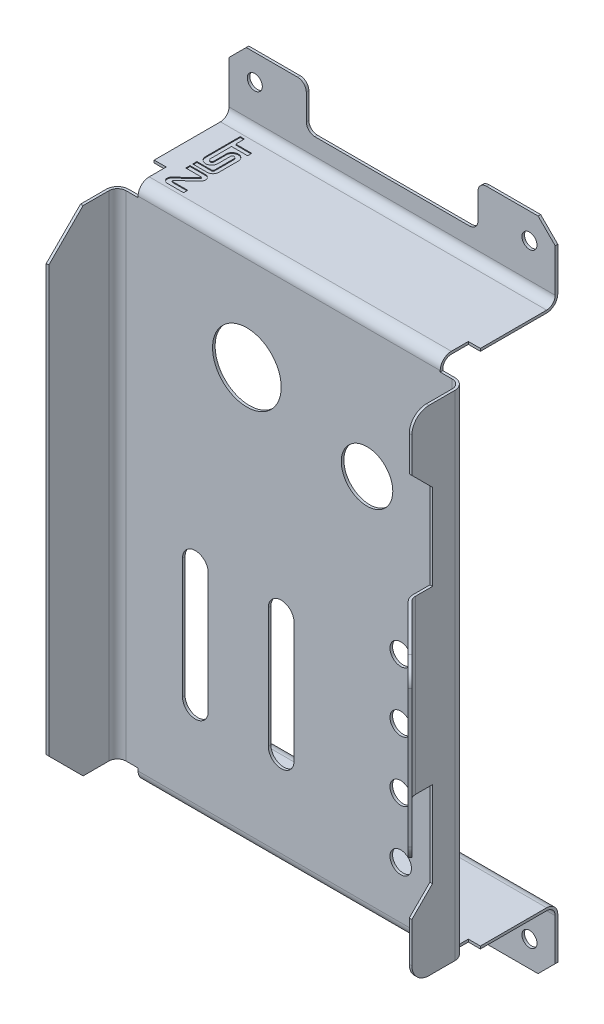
ISO-10303-21;
HEADER;
FILE_DESCRIPTION(('STEP AP214'),'2;1');
FILE_NAME('part.step','',(''),(''),'','','');
FILE_SCHEMA(('AUTOMOTIVE_DESIGN { 1 0 10303 214 1 1 1 1 }'));
ENDSEC;
DATA;
#1=APPLICATION_CONTEXT('core data for automotive mechanical design processes');
#2=APPLICATION_PROTOCOL_DEFINITION('international standard','automotive_design',2000,#1);
#3=PRODUCT_CONTEXT('',#1,'mechanical');
#4=PRODUCT('Part','Part','',(#3));
#5=PRODUCT_RELATED_PRODUCT_CATEGORY('part','',(#4));
#6=PRODUCT_DEFINITION_FORMATION('','',#4);
#7=PRODUCT_DEFINITION_CONTEXT('part definition',#1,'design');
#8=PRODUCT_DEFINITION('design','',#6,#7);
#9=PRODUCT_DEFINITION_SHAPE('','',#8);
#10=(LENGTH_UNIT() NAMED_UNIT(*) SI_UNIT(.MILLI.,.METRE.));
#11=(NAMED_UNIT(*) PLANE_ANGLE_UNIT() SI_UNIT($,.RADIAN.));
#12=(NAMED_UNIT(*) SI_UNIT($,.STERADIAN.) SOLID_ANGLE_UNIT());
#13=UNCERTAINTY_MEASURE_WITH_UNIT(LENGTH_MEASURE(1.E-05),#10,'distance_accuracy_value','');
#14=(GEOMETRIC_REPRESENTATION_CONTEXT(3) GLOBAL_UNCERTAINTY_ASSIGNED_CONTEXT((#13)) GLOBAL_UNIT_ASSIGNED_CONTEXT((#10,
#11,#12)) REPRESENTATION_CONTEXT('',''));
#15=CARTESIAN_POINT('',(0.,0.,0.));
#16=DIRECTION('',(0.,0.,1.));
#17=DIRECTION('',(1.,0.,0.));
#18=AXIS2_PLACEMENT_3D('',#15,#16,#17);
#19=CARTESIAN_POINT('',(0.,43.4848,8.255));
#20=DIRECTION('',(-1.,0.,0.));
#21=DIRECTION('',(0.,0.,1.));
#22=AXIS2_PLACEMENT_3D('',#19,#20,#21);
#23=PLANE('',#22);
#24=DIRECTION('',(0.,1.,0.));
#25=VECTOR('',#24,1.);
#26=CARTESIAN_POINT('',(0.,440.9948,0.));
#27=LINE('',#26,#25);
#28=CARTESIAN_POINT('',(0.,440.9948,0.));
#29=VERTEX_POINT('',#28);
#30=CARTESIAN_POINT('',(0.,472.7448,0.));
#31=VERTEX_POINT('',#30);
#32=EDGE_CURVE('E1551',#29,#31,#27,.T.);
#33=ORIENTED_EDGE('',*,*,#32,.T.);
#34=DIRECTION('',(0.,0.,1.));
#35=VECTOR('',#34,1.);
#36=CARTESIAN_POINT('',(0.,472.7448,1.905));
#37=LINE('',#36,#35);
#38=CARTESIAN_POINT('',(0.,472.7448,1.905));
#39=VERTEX_POINT('',#38);
#40=EDGE_CURVE('E1761',#31,#39,#37,.T.);
#41=ORIENTED_EDGE('',*,*,#40,.T.);
#42=DIRECTION('',(0.,-1.,0.));
#43=VECTOR('',#42,1.);
#44=CARTESIAN_POINT('',(0.,440.9948,1.90499999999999));
#45=LINE('',#44,#43);
#46=CARTESIAN_POINT('',(0.,440.9948,1.90499999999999));
#47=VERTEX_POINT('',#46);
#48=EDGE_CURVE('E1555',#39,#47,#45,.T.);
#49=ORIENTED_EDGE('',*,*,#48,.T.);
#50=CARTESIAN_POINT('',(0.,440.9948,8.255));
#51=DIRECTION('',(-1.,0.,0.));
#52=DIRECTION('',(0.,0.,1.));
#53=AXIS2_PLACEMENT_3D('',#50,#51,#52);
#54=CIRCLE('',#53,6.35000000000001);
#55=CARTESIAN_POINT('',(0.,434.6448,8.25500000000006));
#56=VERTEX_POINT('',#55);
#57=EDGE_CURVE('E1558',#47,#56,#54,.T.);
#58=ORIENTED_EDGE('',*,*,#57,.T.);
#59=DIRECTION('',(0.,0.,1.));
#60=VECTOR('',#59,1.);
#61=CARTESIAN_POINT('',(0.,434.6448,69.8499999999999));
#62=LINE('',#61,#60);
#63=CARTESIAN_POINT('',(0.,434.6448,57.277));
#64=VERTEX_POINT('',#63);
#65=EDGE_CURVE('E1562',#56,#64,#62,.T.);
#66=ORIENTED_EDGE('',*,*,#65,.T.);
#67=DIRECTION('',(0.,1.,0.));
#68=VECTOR('',#67,1.);
#69=CARTESIAN_POINT('',(0.,43.4848,57.277));
#70=LINE('',#69,#68);
#71=CARTESIAN_POINT('',(0.,432.7398,57.277));
#72=VERTEX_POINT('',#71);
#73=EDGE_CURVE('E1055',#72,#64,#70,.T.);
#74=ORIENTED_EDGE('',*,*,#73,.F.);
#75=DIRECTION('',(0.,0.,-1.));
#76=VECTOR('',#75,1.);
#77=CARTESIAN_POINT('',(0.,432.7398,69.85));
#78=LINE('',#77,#76);
#79=CARTESIAN_POINT('',(0.,432.7398,8.25500000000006));
#80=VERTEX_POINT('',#79);
#81=EDGE_CURVE('E1544',#72,#80,#78,.T.);
#82=ORIENTED_EDGE('',*,*,#81,.T.);
#83=CARTESIAN_POINT('',(0.,440.9948,8.255));
#84=DIRECTION('',(1.,0.,0.));
#85=DIRECTION('',(0.,0.,1.));
#86=AXIS2_PLACEMENT_3D('',#83,#84,#85);
#87=CIRCLE('',#86,8.25500000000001);
#88=EDGE_CURVE('E1547',#80,#29,#87,.T.);
#89=ORIENTED_EDGE('',*,*,#88,.T.);
#90=EDGE_LOOP('',(#33,#41,#49,#58,#66,#74,#82,#89));
#91=FACE_BOUND('',#90,.T.);
#92=ADVANCED_FACE('F37',(#91),#23,.F.);
#93=CARTESIAN_POINT('',(-241.3,43.4848,8.255));
#94=DIRECTION('',(-1.,0.,0.));
#95=DIRECTION('',(0.,0.,1.));
#96=AXIS2_PLACEMENT_3D('',#93,#94,#95);
#97=PLANE('',#96);
#98=DIRECTION('',(0.,-1.,0.));
#99=VECTOR('',#98,1.);
#100=CARTESIAN_POINT('',(-241.3,440.9948,1.90499999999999));
#101=LINE('',#100,#99);
#102=CARTESIAN_POINT('',(-241.3,472.7448,1.905));
#103=VERTEX_POINT('',#102);
#104=CARTESIAN_POINT('',(-241.3,440.9948,1.90499999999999));
#105=VERTEX_POINT('',#104);
#106=EDGE_CURVE('E1511',#103,#105,#101,.T.);
#107=ORIENTED_EDGE('',*,*,#106,.F.);
#108=DIRECTION('',(0.,0.,-1.));
#109=VECTOR('',#108,1.);
#110=CARTESIAN_POINT('',(-241.3,472.7448,8.255));
#111=LINE('',#110,#109);
#112=CARTESIAN_POINT('',(-241.3,472.7448,0.));
#113=VERTEX_POINT('',#112);
#114=EDGE_CURVE('E1755',#103,#113,#111,.T.);
#115=ORIENTED_EDGE('',*,*,#114,.T.);
#116=DIRECTION('',(0.,1.,0.));
#117=VECTOR('',#116,1.);
#118=CARTESIAN_POINT('',(-241.3,440.9948,0.));
#119=LINE('',#118,#117);
#120=CARTESIAN_POINT('',(-241.3,440.9948,0.));
#121=VERTEX_POINT('',#120);
#122=EDGE_CURVE('E1507',#121,#113,#119,.T.);
#123=ORIENTED_EDGE('',*,*,#122,.F.);
#124=CARTESIAN_POINT('',(-241.3,440.9948,8.255));
#125=DIRECTION('',(1.,0.,0.));
#126=DIRECTION('',(0.,0.,1.));
#127=AXIS2_PLACEMENT_3D('',#124,#125,#126);
#128=CIRCLE('',#127,8.25500000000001);
#129=CARTESIAN_POINT('',(-241.3,432.7398,8.25500000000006));
#130=VERTEX_POINT('',#129);
#131=EDGE_CURVE('E1503',#130,#121,#128,.T.);
#132=ORIENTED_EDGE('',*,*,#131,.F.);
#133=DIRECTION('',(0.,0.,-1.));
#134=VECTOR('',#133,1.);
#135=CARTESIAN_POINT('',(-241.3,432.7398,69.85));
#136=LINE('',#135,#134);
#137=CARTESIAN_POINT('',(-241.3,432.7398,57.277));
#138=VERTEX_POINT('',#137);
#139=EDGE_CURVE('E1500',#138,#130,#136,.T.);
#140=ORIENTED_EDGE('',*,*,#139,.F.);
#141=DIRECTION('',(0.,1.,0.));
#142=VECTOR('',#141,1.);
#143=CARTESIAN_POINT('',(-241.3,43.4848,57.277));
#144=LINE('',#143,#142);
#145=CARTESIAN_POINT('',(-241.3,434.6448,57.277));
#146=VERTEX_POINT('',#145);
#147=EDGE_CURVE('E1080',#138,#146,#144,.T.);
#148=ORIENTED_EDGE('',*,*,#147,.T.);
#149=DIRECTION('',(0.,0.,1.));
#150=VECTOR('',#149,1.);
#151=CARTESIAN_POINT('',(-241.3,434.6448,69.8499999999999));
#152=LINE('',#151,#150);
#153=CARTESIAN_POINT('',(-241.3,434.6448,8.25500000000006));
#154=VERTEX_POINT('',#153);
#155=EDGE_CURVE('E1518',#154,#146,#152,.T.);
#156=ORIENTED_EDGE('',*,*,#155,.F.);
#157=CARTESIAN_POINT('',(-241.3,440.9948,8.255));
#158=DIRECTION('',(-1.,0.,0.));
#159=DIRECTION('',(0.,0.,1.));
#160=AXIS2_PLACEMENT_3D('',#157,#158,#159);
#161=CIRCLE('',#160,6.35000000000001);
#162=EDGE_CURVE('E1514',#105,#154,#161,.T.);
#163=ORIENTED_EDGE('',*,*,#162,.F.);
#164=EDGE_LOOP('',(#107,#115,#123,#132,#140,#148,#156,#163));
#165=FACE_BOUND('',#164,.T.);
#166=ADVANCED_FACE('F1927',(#165),#97,.T.);
#167=DIRECTION('',(0.,1.,0.));
#168=VECTOR('',#167,1.);
#169=CARTESIAN_POINT('',(-241.3,0.,0.));
#170=LINE('',#169,#168);
#171=CARTESIAN_POINT('',(-241.3,12.7,0.));
#172=VERTEX_POINT('',#171);
#173=CARTESIAN_POINT('',(-241.3,43.4847999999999,0.));
#174=VERTEX_POINT('',#173);
#175=EDGE_CURVE('E1488',#172,#174,#170,.T.);
#176=ORIENTED_EDGE('',*,*,#175,.F.);
#177=DIRECTION('',(0.,0.,1.));
#178=VECTOR('',#177,1.);
#179=CARTESIAN_POINT('',(-241.3,12.7,8.255));
#180=LINE('',#179,#178);
#181=CARTESIAN_POINT('',(-241.3,12.7,1.905));
#182=VERTEX_POINT('',#181);
#183=EDGE_CURVE('E1746',#172,#182,#180,.T.);
#184=ORIENTED_EDGE('',*,*,#183,.T.);
#185=DIRECTION('',(0.,-1.,0.));
#186=VECTOR('',#185,1.);
#187=CARTESIAN_POINT('',(-241.3,0.,1.905));
#188=LINE('',#187,#186);
#189=CARTESIAN_POINT('',(-241.3,43.4847999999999,1.905));
#190=VERTEX_POINT('',#189);
#191=EDGE_CURVE('E1529',#190,#182,#188,.T.);
#192=ORIENTED_EDGE('',*,*,#191,.F.);
#193=CARTESIAN_POINT('',(-241.3,43.4848,8.255));
#194=DIRECTION('',(-1.,0.,0.));
#195=DIRECTION('',(0.,0.,1.));
#196=AXIS2_PLACEMENT_3D('',#193,#194,#195);
#197=CIRCLE('',#196,6.35);
#198=CARTESIAN_POINT('',(-241.3,49.8348,8.25500000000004));
#199=VERTEX_POINT('',#198);
#200=EDGE_CURVE('E1525',#199,#190,#197,.T.);
#201=ORIENTED_EDGE('',*,*,#200,.F.);
#202=DIRECTION('',(0.,0.,-1.));
#203=VECTOR('',#202,1.);
#204=CARTESIAN_POINT('',(-241.3,49.8348,8.25500000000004));
#205=LINE('',#204,#203);
#206=CARTESIAN_POINT('',(-241.3,49.8348,57.277));
#207=VERTEX_POINT('',#206);
#208=EDGE_CURVE('E1522',#207,#199,#205,.T.);
#209=ORIENTED_EDGE('',*,*,#208,.F.);
#210=DIRECTION('',(0.,1.,0.));
#211=VECTOR('',#210,1.);
#212=CARTESIAN_POINT('',(-241.3,43.4848,57.277));
#213=LINE('',#212,#211);
#214=CARTESIAN_POINT('',(-241.3,51.7398,57.277));
#215=VERTEX_POINT('',#214);
#216=EDGE_CURVE('E1694',#207,#215,#213,.T.);
#217=ORIENTED_EDGE('',*,*,#216,.T.);
#218=DIRECTION('',(0.,0.,1.));
#219=VECTOR('',#218,1.);
#220=CARTESIAN_POINT('',(-241.3,51.7398,8.25500000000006));
#221=LINE('',#220,#219);
#222=CARTESIAN_POINT('',(-241.3,51.7397999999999,8.25500000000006));
#223=VERTEX_POINT('',#222);
#224=EDGE_CURVE('E1496',#223,#215,#221,.T.);
#225=ORIENTED_EDGE('',*,*,#224,.F.);
#226=CARTESIAN_POINT('',(-241.3,43.4848,8.255));
#227=DIRECTION('',(1.,0.,0.));
#228=DIRECTION('',(0.,0.,1.));
#229=AXIS2_PLACEMENT_3D('',#226,#227,#228);
#230=CIRCLE('',#229,8.255);
#231=EDGE_CURVE('E1491',#174,#223,#230,.T.);
#232=ORIENTED_EDGE('',*,*,#231,.F.);
#233=EDGE_LOOP('',(#176,#184,#192,#201,#209,#217,#225,#232));
#234=FACE_BOUND('',#233,.T.);
#235=ADVANCED_FACE('F1934',(#234),#97,.T.);
#236=DIRECTION('',(0.,-1.,0.));
#237=VECTOR('',#236,1.);
#238=CARTESIAN_POINT('',(0.,0.,1.905));
#239=LINE('',#238,#237);
#240=CARTESIAN_POINT('',(0.,43.4847999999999,1.905));
#241=VERTEX_POINT('',#240);
#242=CARTESIAN_POINT('',(0.,12.6999999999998,1.905));
#243=VERTEX_POINT('',#242);
#244=EDGE_CURVE('E1492',#241,#243,#239,.T.);
#245=ORIENTED_EDGE('',*,*,#244,.T.);
#246=DIRECTION('',(0.,0.,-1.));
#247=VECTOR('',#246,1.);
#248=CARTESIAN_POINT('',(0.,12.6999999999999,0.));
#249=LINE('',#248,#247);
#250=CARTESIAN_POINT('',(0.,12.6999999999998,0.));
#251=VERTEX_POINT('',#250);
#252=EDGE_CURVE('E1730',#243,#251,#249,.T.);
#253=ORIENTED_EDGE('',*,*,#252,.T.);
#254=DIRECTION('',(0.,1.,0.));
#255=VECTOR('',#254,1.);
#256=CARTESIAN_POINT('',(0.,0.,0.));
#257=LINE('',#256,#255);
#258=CARTESIAN_POINT('',(0.,43.4847999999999,0.));
#259=VERTEX_POINT('',#258);
#260=EDGE_CURVE('E1440',#251,#259,#257,.T.);
#261=ORIENTED_EDGE('',*,*,#260,.T.);
#262=CARTESIAN_POINT('',(0.,43.4848,8.255));
#263=DIRECTION('',(1.,0.,0.));
#264=DIRECTION('',(0.,0.,1.));
#265=AXIS2_PLACEMENT_3D('',#262,#263,#264);
#266=CIRCLE('',#265,8.255);
#267=CARTESIAN_POINT('',(0.,51.7397999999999,8.25500000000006));
#268=VERTEX_POINT('',#267);
#269=EDGE_CURVE('E1536',#259,#268,#266,.T.);
#270=ORIENTED_EDGE('',*,*,#269,.T.);
#271=DIRECTION('',(0.,0.,1.));
#272=VECTOR('',#271,1.);
#273=CARTESIAN_POINT('',(0.,51.7398,8.25500000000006));
#274=LINE('',#273,#272);
#275=CARTESIAN_POINT('',(0.,51.7397999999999,57.277));
#276=VERTEX_POINT('',#275);
#277=EDGE_CURVE('E1540',#268,#276,#274,.T.);
#278=ORIENTED_EDGE('',*,*,#277,.T.);
#279=DIRECTION('',(0.,1.,0.));
#280=VECTOR('',#279,1.);
#281=CARTESIAN_POINT('',(0.,43.4848,57.277));
#282=LINE('',#281,#280);
#283=CARTESIAN_POINT('',(0.,49.8348,57.277));
#284=VERTEX_POINT('',#283);
#285=EDGE_CURVE('E1685',#284,#276,#282,.T.);
#286=ORIENTED_EDGE('',*,*,#285,.F.);
#287=DIRECTION('',(0.,0.,-1.));
#288=VECTOR('',#287,1.);
#289=CARTESIAN_POINT('',(0.,49.8348,8.25500000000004));
#290=LINE('',#289,#288);
#291=CARTESIAN_POINT('',(0.,49.8348,8.25500000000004));
#292=VERTEX_POINT('',#291);
#293=EDGE_CURVE('E1566',#284,#292,#290,.T.);
#294=ORIENTED_EDGE('',*,*,#293,.T.);
#295=CARTESIAN_POINT('',(0.,43.4848,8.255));
#296=DIRECTION('',(-1.,0.,0.));
#297=DIRECTION('',(0.,0.,1.));
#298=AXIS2_PLACEMENT_3D('',#295,#296,#297);
#299=CIRCLE('',#298,6.35);
#300=EDGE_CURVE('E1569',#292,#241,#299,.T.);
#301=ORIENTED_EDGE('',*,*,#300,.T.);
#302=EDGE_LOOP('',(#245,#253,#261,#270,#278,#286,#294,#301));
#303=FACE_BOUND('',#302,.T.);
#304=ADVANCED_FACE('F1930',(#303),#23,.F.);
#305=CARTESIAN_POINT('',(-241.3,0.,0.));
#306=DIRECTION('',(0.,-1.,0.));
#307=DIRECTION('',(0.,0.,-1.));
#308=AXIS2_PLACEMENT_3D('',#305,#306,#307);
#309=PLANE('',#308);
#310=DIRECTION('',(1.,0.,0.));
#311=VECTOR('',#310,1.);
#312=CARTESIAN_POINT('',(-241.3,0.,1.905));
#313=LINE('',#312,#311);
#314=CARTESIAN_POINT('',(-228.6,0.,1.905));
#315=VERTEX_POINT('',#314);
#316=CARTESIAN_POINT('',(-184.15,0.,1.905));
#317=VERTEX_POINT('',#316);
#318=EDGE_CURVE('E1576',#315,#317,#313,.T.);
#319=ORIENTED_EDGE('',*,*,#318,.F.);
#320=DIRECTION('',(0.,0.,-1.));
#321=VECTOR('',#320,1.);
#322=CARTESIAN_POINT('',(-228.6,0.,0.));
#323=LINE('',#322,#321);
#324=CARTESIAN_POINT('',(-228.6,0.,0.));
#325=VERTEX_POINT('',#324);
#326=EDGE_CURVE('E1743',#315,#325,#323,.T.);
#327=ORIENTED_EDGE('',*,*,#326,.T.);
#328=DIRECTION('',(1.,0.,0.));
#329=VECTOR('',#328,1.);
#330=CARTESIAN_POINT('',(-241.3,0.,0.));
#331=LINE('',#330,#329);
#332=CARTESIAN_POINT('',(-184.15,0.,0.));
#333=VERTEX_POINT('',#332);
#334=EDGE_CURVE('E1645',#325,#333,#331,.T.);
#335=ORIENTED_EDGE('',*,*,#334,.T.);
#336=DIRECTION('',(0.,0.,-1.));
#337=VECTOR('',#336,1.);
#338=CARTESIAN_POINT('',(-184.15,0.,0.));
#339=LINE('',#338,#337);
#340=EDGE_CURVE('E1297',#317,#333,#339,.T.);
#341=ORIENTED_EDGE('',*,*,#340,.F.);
#342=EDGE_LOOP('',(#319,#327,#335,#341));
#343=FACE_BOUND('',#342,.T.);
#344=ADVANCED_FACE('F1939',(#343),#309,.T.);
#345=CARTESIAN_POINT('',(-241.3,485.4448,1.905));
#346=DIRECTION('',(0.,1.,0.));
#347=DIRECTION('',(0.,0.,1.));
#348=AXIS2_PLACEMENT_3D('',#345,#346,#347);
#349=PLANE('',#348);
#350=DIRECTION('',(1.,0.,0.));
#351=VECTOR('',#350,1.);
#352=CARTESIAN_POINT('',(-241.3,485.4448,0.));
#353=LINE('',#352,#351);
#354=CARTESIAN_POINT('',(-228.6,485.4448,0.));
#355=VERTEX_POINT('',#354);
#356=CARTESIAN_POINT('',(-190.5,485.4448,0.));
#357=VERTEX_POINT('',#356);
#358=EDGE_CURVE('E1613',#355,#357,#353,.T.);
#359=ORIENTED_EDGE('',*,*,#358,.F.);
#360=DIRECTION('',(0.,0.,1.));
#361=VECTOR('',#360,1.);
#362=CARTESIAN_POINT('',(-228.6,485.4448,1.905));
#363=LINE('',#362,#361);
#364=CARTESIAN_POINT('',(-228.6,485.4448,1.905));
#365=VERTEX_POINT('',#364);
#366=EDGE_CURVE('E1748',#355,#365,#363,.T.);
#367=ORIENTED_EDGE('',*,*,#366,.T.);
#368=DIRECTION('',(1.,0.,0.));
#369=VECTOR('',#368,1.);
#370=CARTESIAN_POINT('',(-241.3,485.4448,1.905));
#371=LINE('',#370,#369);
#372=CARTESIAN_POINT('',(-190.5,485.4448,1.905));
#373=VERTEX_POINT('',#372);
#374=EDGE_CURVE('E1609',#365,#373,#371,.T.);
#375=ORIENTED_EDGE('',*,*,#374,.T.);
#376=DIRECTION('',(0.,0.,1.));
#377=VECTOR('',#376,1.);
#378=CARTESIAN_POINT('',(-190.5,485.4448,0.));
#379=LINE('',#378,#377);
#380=EDGE_CURVE('E1718',#373,#357,#379,.F.);
#381=ORIENTED_EDGE('',*,*,#380,.T.);
#382=EDGE_LOOP('',(#359,#367,#375,#381));
#383=FACE_BOUND('',#382,.T.);
#384=ADVANCED_FACE('F1945',(#383),#349,.T.);
#385=CARTESIAN_POINT('',(-57.15,0.,0.));
#386=VERTEX_POINT('',#385);
#387=CARTESIAN_POINT('',(-12.7,0.,0.));
#388=VERTEX_POINT('',#387);
#389=EDGE_CURVE('E1533',#386,#388,#331,.T.);
#390=ORIENTED_EDGE('',*,*,#389,.T.);
#391=DIRECTION('',(0.,0.,1.));
#392=VECTOR('',#391,1.);
#393=CARTESIAN_POINT('',(-12.6999999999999,0.,1.905));
#394=LINE('',#393,#392);
#395=CARTESIAN_POINT('',(-12.6999999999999,0.,1.905));
#396=VERTEX_POINT('',#395);
#397=EDGE_CURVE('E1737',#388,#396,#394,.T.);
#398=ORIENTED_EDGE('',*,*,#397,.T.);
#399=CARTESIAN_POINT('',(-57.15,0.,1.905));
#400=VERTEX_POINT('',#399);
#401=EDGE_CURVE('E1580',#400,#396,#313,.T.);
#402=ORIENTED_EDGE('',*,*,#401,.F.);
#403=DIRECTION('',(0.,0.,1.));
#404=VECTOR('',#403,1.);
#405=CARTESIAN_POINT('',(-57.15,0.,0.));
#406=LINE('',#405,#404);
#407=EDGE_CURVE('E1289',#386,#400,#406,.T.);
#408=ORIENTED_EDGE('',*,*,#407,.F.);
#409=EDGE_LOOP('',(#390,#398,#402,#408));
#410=FACE_BOUND('',#409,.T.);
#411=ADVANCED_FACE('F1948',(#410),#309,.T.);
#412=CARTESIAN_POINT('',(-241.3,0.,1.905));
#413=DIRECTION('',(0.,0.,1.));
#414=DIRECTION('',(1.,0.,0.));
#415=AXIS2_PLACEMENT_3D('',#412,#413,#414);
#416=PLANE('',#415);
#417=CARTESIAN_POINT('',(-19.05,19.05,1.905));
#418=DIRECTION('',(0.,0.,1.));
#419=DIRECTION('',(1.,0.,0.));
#420=AXIS2_PLACEMENT_3D('',#417,#418,#419);
#421=CIRCLE('',#420,5.56259999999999);
#422=CARTESIAN_POINT('',(-13.4874,19.05,1.905));
#423=VERTEX_POINT('',#422);
#424=EDGE_CURVE('E1238',#423,#423,#421,.T.);
#425=ORIENTED_EDGE('',*,*,#424,.F.);
#426=EDGE_LOOP('',(#425));
#427=FACE_BOUND('',#426,.T.);
#428=CARTESIAN_POINT('',(-222.25,19.05,1.905));
#429=DIRECTION('',(0.,0.,1.));
#430=DIRECTION('',(1.,0.,0.));
#431=AXIS2_PLACEMENT_3D('',#428,#429,#430);
#432=CIRCLE('',#431,5.5626);
#433=CARTESIAN_POINT('',(-216.6874,19.05,1.905));
#434=VERTEX_POINT('',#433);
#435=EDGE_CURVE('E1242',#434,#434,#432,.T.);
#436=ORIENTED_EDGE('',*,*,#435,.F.);
#437=EDGE_LOOP('',(#436));
#438=FACE_BOUND('',#437,.T.);
#439=ORIENTED_EDGE('',*,*,#401,.T.);
#440=DIRECTION('',(0.707106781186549,0.707106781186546,0.));
#441=VECTOR('',#440,1.);
#442=CARTESIAN_POINT('',(-127.,-114.3,1.905));
#443=LINE('',#442,#441);
#444=EDGE_CURVE('E1741',#396,#243,#443,.T.);
#445=ORIENTED_EDGE('',*,*,#444,.T.);
#446=ORIENTED_EDGE('',*,*,#244,.F.);
#447=DIRECTION('',(1.,0.,0.));
#448=VECTOR('',#447,1.);
#449=CARTESIAN_POINT('',(-241.3,43.4847999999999,1.905));
#450=LINE('',#449,#448);
#451=EDGE_CURVE('E1581',#190,#241,#450,.T.);
#452=ORIENTED_EDGE('',*,*,#451,.F.);
#453=ORIENTED_EDGE('',*,*,#191,.T.);
#454=DIRECTION('',(-0.707106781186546,0.707106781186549,0.));
#455=VECTOR('',#454,1.);
#456=CARTESIAN_POINT('',(-234.95,6.34999999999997,1.905));
#457=LINE('',#456,#455);
#458=EDGE_CURVE('E1739',#182,#315,#457,.F.);
#459=ORIENTED_EDGE('',*,*,#458,.T.);
#460=ORIENTED_EDGE('',*,*,#318,.T.);
#461=DIRECTION('',(0.,-1.,0.));
#462=VECTOR('',#461,1.);
#463=CARTESIAN_POINT('',(-184.15,-18.7615821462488,1.905));
#464=LINE('',#463,#462);
#465=CARTESIAN_POINT('',(-184.15,25.4,1.905));
#466=VERTEX_POINT('',#465);
#467=EDGE_CURVE('E1260',#466,#317,#464,.T.);
#468=ORIENTED_EDGE('',*,*,#467,.F.);
#469=CARTESIAN_POINT('',(-177.8,25.4,1.905));
#470=DIRECTION('',(0.,0.,1.));
#471=DIRECTION('',(1.,0.,0.));
#472=AXIS2_PLACEMENT_3D('',#469,#470,#471);
#473=CIRCLE('',#472,6.35);
#474=CARTESIAN_POINT('',(-177.8,31.75,1.905));
#475=VERTEX_POINT('',#474);
#476=EDGE_CURVE('E1265',#475,#466,#473,.T.);
#477=ORIENTED_EDGE('',*,*,#476,.F.);
#478=DIRECTION('',(-1.,0.,0.));
#479=VECTOR('',#478,1.);
#480=CARTESIAN_POINT('',(-177.8,31.75,1.905));
#481=LINE('',#480,#479);
#482=CARTESIAN_POINT('',(-63.5,31.75,1.905));
#483=VERTEX_POINT('',#482);
#484=EDGE_CURVE('E1282',#483,#475,#481,.T.);
#485=ORIENTED_EDGE('',*,*,#484,.F.);
#486=CARTESIAN_POINT('',(-63.5,25.4,1.905));
#487=DIRECTION('',(0.,0.,1.));
#488=DIRECTION('',(1.,0.,0.));
#489=AXIS2_PLACEMENT_3D('',#486,#487,#488);
#490=CIRCLE('',#489,6.35);
#491=CARTESIAN_POINT('',(-57.15,25.4,1.905));
#492=VERTEX_POINT('',#491);
#493=EDGE_CURVE('E1279',#492,#483,#490,.T.);
#494=ORIENTED_EDGE('',*,*,#493,.F.);
#495=DIRECTION('',(0.,1.,0.));
#496=VECTOR('',#495,1.);
#497=CARTESIAN_POINT('',(-57.15,-18.7615821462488,1.905));
#498=LINE('',#497,#496);
#499=EDGE_CURVE('E1277',#400,#492,#498,.T.);
#500=ORIENTED_EDGE('',*,*,#499,.F.);
#501=EDGE_LOOP('',(#439,#445,#446,#452,#453,#459,#460,#468,#477,#485,#494,#500));
#502=FACE_BOUND('',#501,.T.);
#503=ADVANCED_FACE('F2139',(#427,#438,#502),#416,.T.);
#504=CARTESIAN_POINT('',(-241.3,43.4848,8.255));
#505=DIRECTION('',(1.,0.,0.));
#506=DIRECTION('',(0.,0.,-1.));
#507=AXIS2_PLACEMENT_3D('',#504,#505,#506);
#508=CYLINDRICAL_SURFACE('',#507,6.35);
#509=ORIENTED_EDGE('',*,*,#300,.F.);
#510=DIRECTION('',(1.,0.,0.));
#511=VECTOR('',#510,1.);
#512=CARTESIAN_POINT('',(-241.3,49.8348,8.25500000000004));
#513=LINE('',#512,#511);
#514=EDGE_CURVE('E1584',#199,#292,#513,.T.);
#515=ORIENTED_EDGE('',*,*,#514,.F.);
#516=ORIENTED_EDGE('',*,*,#200,.T.);
#517=ORIENTED_EDGE('',*,*,#451,.T.);
#518=EDGE_LOOP('',(#509,#515,#516,#517));
#519=FACE_BOUND('',#518,.T.);
#520=ADVANCED_FACE('F2143',(#519),#508,.F.);
#521=CARTESIAN_POINT('',(-241.3,49.8348,8.25500000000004));
#522=DIRECTION('',(0.,-1.,0.));
#523=DIRECTION('',(0.,0.,-1.));
#524=AXIS2_PLACEMENT_3D('',#521,#522,#523);
#525=PLANE('',#524);
#526=DIRECTION('',(0.,0.,1.));
#527=VECTOR('',#526,1.);
#528=CARTESIAN_POINT('',(-232.41,49.8348,57.277));
#529=LINE('',#528,#527);
#530=CARTESIAN_POINT('',(-232.41,49.8348,57.277));
#531=VERTEX_POINT('',#530);
#532=CARTESIAN_POINT('',(-232.41,49.8348,69.85));
#533=VERTEX_POINT('',#532);
#534=EDGE_CURVE('E1093',#531,#533,#529,.T.);
#535=ORIENTED_EDGE('',*,*,#534,.F.);
#536=DIRECTION('',(1.,0.,0.));
#537=VECTOR('',#536,1.);
#538=CARTESIAN_POINT('',(-281.169257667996,49.8348,57.277));
#539=LINE('',#538,#537);
#540=EDGE_CURVE('E1087',#207,#531,#539,.T.);
#541=ORIENTED_EDGE('',*,*,#540,.F.);
#542=ORIENTED_EDGE('',*,*,#208,.T.);
#543=ORIENTED_EDGE('',*,*,#514,.T.);
#544=ORIENTED_EDGE('',*,*,#293,.F.);
#545=DIRECTION('',(1.,0.,0.));
#546=VECTOR('',#545,1.);
#547=CARTESIAN_POINT('',(39.8692576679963,49.8348,57.277));
#548=LINE('',#547,#546);
#549=CARTESIAN_POINT('',(-8.89,49.8348,57.277));
#550=VERTEX_POINT('',#549);
#551=EDGE_CURVE('E1114',#550,#284,#548,.T.);
#552=ORIENTED_EDGE('',*,*,#551,.F.);
#553=DIRECTION('',(0.,0.,1.));
#554=VECTOR('',#553,1.);
#555=CARTESIAN_POINT('',(-8.89,49.8348,57.277));
#556=LINE('',#555,#554);
#557=CARTESIAN_POINT('',(-8.89000000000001,49.8348,69.85));
#558=VERTEX_POINT('',#557);
#559=EDGE_CURVE('E1122',#550,#558,#556,.T.);
#560=ORIENTED_EDGE('',*,*,#559,.T.);
#561=DIRECTION('',(1.,0.,0.));
#562=VECTOR('',#561,1.);
#563=CARTESIAN_POINT('',(-241.3,49.8348,69.85));
#564=LINE('',#563,#562);
#565=EDGE_CURVE('E1588',#533,#558,#564,.T.);
#566=ORIENTED_EDGE('',*,*,#565,.F.);
#567=EDGE_LOOP('',(#535,#541,#542,#543,#544,#552,#560,#566));
#568=FACE_BOUND('',#567,.T.);
#569=ADVANCED_FACE('F2629',(#568),#525,.T.);
#570=CARTESIAN_POINT('',(-241.3,58.0898,69.85));
#571=DIRECTION('',(1.,0.,0.));
#572=DIRECTION('',(0.,0.,-1.));
#573=AXIS2_PLACEMENT_3D('',#570,#571,#572);
#574=CYLINDRICAL_SURFACE('',#573,8.255);
#575=CARTESIAN_POINT('',(-232.41,58.0898,69.85));
#576=DIRECTION('',(1.,0.,0.));
#577=DIRECTION('',(0.,0.,-1.));
#578=AXIS2_PLACEMENT_3D('',#575,#576,#577);
#579=CIRCLE('',#578,8.255);
#580=CARTESIAN_POINT('',(-232.41,58.0898,78.105));
#581=VERTEX_POINT('',#580);
#582=EDGE_CURVE('E1109',#533,#581,#579,.F.);
#583=ORIENTED_EDGE('',*,*,#582,.F.);
#584=ORIENTED_EDGE('',*,*,#565,.T.);
#585=CARTESIAN_POINT('',(-8.89000000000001,58.0898,69.85));
#586=DIRECTION('',(-1.,0.,0.));
#587=DIRECTION('',(0.,-1.,0.));
#588=AXIS2_PLACEMENT_3D('',#585,#586,#587);
#589=CIRCLE('',#588,8.255);
#590=CARTESIAN_POINT('',(-8.89,58.0898,78.105));
#591=VERTEX_POINT('',#590);
#592=EDGE_CURVE('E1137',#591,#558,#589,.F.);
#593=ORIENTED_EDGE('',*,*,#592,.F.);
#594=DIRECTION('',(1.,0.,0.));
#595=VECTOR('',#594,1.);
#596=CARTESIAN_POINT('',(-241.3,58.0898,78.105));
#597=LINE('',#596,#595);
#598=EDGE_CURVE('E1591',#581,#591,#597,.T.);
#599=ORIENTED_EDGE('',*,*,#598,.F.);
#600=EDGE_LOOP('',(#583,#584,#593,#599));
#601=FACE_BOUND('',#600,.T.);
#602=ADVANCED_FACE('F2634',(#601),#574,.T.);
#603=CARTESIAN_POINT('',(-241.3,58.0898,78.105));
#604=DIRECTION('',(0.,0.,1.));
#605=DIRECTION('',(1.,0.,0.));
#606=AXIS2_PLACEMENT_3D('',#603,#604,#605);
#607=PLANE('',#606);
#608=DIRECTION('',(1.,0.,0.));
#609=VECTOR('',#608,1.);
#610=CARTESIAN_POINT('',(39.8692576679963,425.45,78.105));
#611=LINE('',#610,#609);
#612=CARTESIAN_POINT('',(-8.89,425.45,78.105));
#613=VERTEX_POINT('',#612);
#614=CARTESIAN_POINT('',(0.,425.45,78.105));
#615=VERTEX_POINT('',#614);
#616=EDGE_CURVE('E1039',#613,#615,#611,.T.);
#617=ORIENTED_EDGE('',*,*,#616,.F.);
#618=DIRECTION('',(0.,-1.,0.));
#619=VECTOR('',#618,1.);
#620=CARTESIAN_POINT('',(-8.89,435.61,78.105));
#621=LINE('',#620,#619);
#622=CARTESIAN_POINT('',(-8.89,426.3898,78.105));
#623=VERTEX_POINT('',#622);
#624=EDGE_CURVE('E997',#623,#613,#621,.T.);
#625=ORIENTED_EDGE('',*,*,#624,.F.);
#626=DIRECTION('',(1.,0.,0.));
#627=VECTOR('',#626,1.);
#628=CARTESIAN_POINT('',(-241.3,426.3898,78.105));
#629=LINE('',#628,#627);
#630=CARTESIAN_POINT('',(-232.41,426.3898,78.105));
#631=VERTEX_POINT('',#630);
#632=EDGE_CURVE('E1594',#631,#623,#629,.T.);
#633=ORIENTED_EDGE('',*,*,#632,.F.);
#634=DIRECTION('',(0.,1.,0.));
#635=VECTOR('',#634,1.);
#636=CARTESIAN_POINT('',(-232.41,435.61,78.105));
#637=LINE('',#636,#635);
#638=CARTESIAN_POINT('',(-232.41,425.45,78.105));
#639=VERTEX_POINT('',#638);
#640=EDGE_CURVE('E1065',#639,#631,#637,.T.);
#641=ORIENTED_EDGE('',*,*,#640,.F.);
#642=DIRECTION('',(1.,0.,0.));
#643=VECTOR('',#642,1.);
#644=CARTESIAN_POINT('',(-281.169257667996,425.45,78.105));
#645=LINE('',#644,#643);
#646=CARTESIAN_POINT('',(-241.3,425.45,78.105));
#647=VERTEX_POINT('',#646);
#648=EDGE_CURVE('E1060',#647,#639,#645,.T.);
#649=ORIENTED_EDGE('',*,*,#648,.F.);
#650=DIRECTION('',(0.,1.,0.));
#651=VECTOR('',#650,1.);
#652=CARTESIAN_POINT('',(-241.3,59.9948,78.105));
#653=LINE('',#652,#651);
#654=CARTESIAN_POINT('',(-241.3,59.9948,78.105));
#655=VERTEX_POINT('',#654);
#656=EDGE_CURVE('E1479',#655,#647,#653,.T.);
#657=ORIENTED_EDGE('',*,*,#656,.F.);
#658=DIRECTION('',(-1.,0.,0.));
#659=VECTOR('',#658,1.);
#660=CARTESIAN_POINT('',(-281.169257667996,59.9948,78.105));
#661=LINE('',#660,#659);
#662=CARTESIAN_POINT('',(-232.41,59.9948,78.105));
#663=VERTEX_POINT('',#662);
#664=EDGE_CURVE('E1090',#663,#655,#661,.T.);
#665=ORIENTED_EDGE('',*,*,#664,.F.);
#666=DIRECTION('',(0.,1.,0.));
#667=VECTOR('',#666,1.);
#668=CARTESIAN_POINT('',(-232.41,49.8348,78.105));
#669=LINE('',#668,#667);
#670=EDGE_CURVE('E1086',#581,#663,#669,.T.);
#671=ORIENTED_EDGE('',*,*,#670,.F.);
#672=ORIENTED_EDGE('',*,*,#598,.T.);
#673=DIRECTION('',(0.,-1.,0.));
#674=VECTOR('',#673,1.);
#675=CARTESIAN_POINT('',(-8.89,49.8348,78.105));
#676=LINE('',#675,#674);
#677=CARTESIAN_POINT('',(-8.89,59.9948,78.105));
#678=VERTEX_POINT('',#677);
#679=EDGE_CURVE('E1115',#678,#591,#676,.T.);
#680=ORIENTED_EDGE('',*,*,#679,.F.);
#681=DIRECTION('',(-1.,0.,0.));
#682=VECTOR('',#681,1.);
#683=CARTESIAN_POINT('',(39.8692576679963,59.9948,78.105));
#684=LINE('',#683,#682);
#685=CARTESIAN_POINT('',(0.,59.9948,78.105));
#686=VERTEX_POINT('',#685);
#687=EDGE_CURVE('E1111',#686,#678,#684,.T.);
#688=ORIENTED_EDGE('',*,*,#687,.F.);
#689=DIRECTION('',(0.,1.,0.));
#690=VECTOR('',#689,1.);
#691=CARTESIAN_POINT('',(0.,59.9948,78.105));
#692=LINE('',#691,#690);
#693=EDGE_CURVE('E1475',#686,#615,#692,.T.);
#694=ORIENTED_EDGE('',*,*,#693,.T.);
#695=EDGE_LOOP('',(#617,#625,#633,#641,#649,#657,#665,#671,#672,#680,#688,#694));
#696=FACE_BOUND('',#695,.T.);
#697=CARTESIAN_POINT('',(-38.1,96.774,78.105));
#698=DIRECTION('',(0.,0.,1.));
#699=DIRECTION('',(1.,0.,0.));
#700=AXIS2_PLACEMENT_3D('',#697,#698,#699);
#701=CIRCLE('',#700,7.93749999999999);
#702=CARTESIAN_POINT('',(-30.1625,96.774,78.105));
#703=VERTEX_POINT('',#702);
#704=EDGE_CURVE('E1170',#703,#703,#701,.T.);
#705=ORIENTED_EDGE('',*,*,#704,.F.);
#706=EDGE_LOOP('',(#705));
#707=FACE_BOUND('',#706,.T.);
#708=CARTESIAN_POINT('',(-38.1,141.224,78.105));
#709=DIRECTION('',(0.,0.,1.));
#710=DIRECTION('',(1.,0.,0.));
#711=AXIS2_PLACEMENT_3D('',#708,#709,#710);
#712=CIRCLE('',#711,7.93749999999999);
#713=CARTESIAN_POINT('',(-30.1625,141.224,78.105));
#714=VERTEX_POINT('',#713);
#715=EDGE_CURVE('E1176',#714,#714,#712,.T.);
#716=ORIENTED_EDGE('',*,*,#715,.F.);
#717=EDGE_LOOP('',(#716));
#718=FACE_BOUND('',#717,.T.);
#719=CARTESIAN_POINT('',(-38.1,185.674,78.105));
#720=DIRECTION('',(0.,0.,1.));
#721=DIRECTION('',(1.,0.,0.));
#722=AXIS2_PLACEMENT_3D('',#719,#720,#721);
#723=CIRCLE('',#722,7.93749999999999);
#724=CARTESIAN_POINT('',(-30.1625,185.674,78.105));
#725=VERTEX_POINT('',#724);
#726=EDGE_CURVE('E1180',#725,#725,#723,.T.);
#727=ORIENTED_EDGE('',*,*,#726,.F.);
#728=EDGE_LOOP('',(#727));
#729=FACE_BOUND('',#728,.T.);
#730=CARTESIAN_POINT('',(-38.1,230.124,78.105));
#731=DIRECTION('',(0.,0.,1.));
#732=DIRECTION('',(1.,0.,0.));
#733=AXIS2_PLACEMENT_3D('',#730,#731,#732);
#734=CIRCLE('',#733,7.93749999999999);
#735=CARTESIAN_POINT('',(-30.1625,230.124,78.105));
#736=VERTEX_POINT('',#735);
#737=EDGE_CURVE('E1184',#736,#736,#734,.T.);
#738=ORIENTED_EDGE('',*,*,#737,.F.);
#739=EDGE_LOOP('',(#738));
#740=FACE_BOUND('',#739,.T.);
#741=CARTESIAN_POINT('',(-126.513299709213,210.9724,78.105));
#742=DIRECTION('',(0.,0.,1.));
#743=DIRECTION('',(-1.,0.,0.));
#744=AXIS2_PLACEMENT_3D('',#741,#742,#743);
#745=CIRCLE('',#744,9.52910029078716);
#746=CARTESIAN_POINT('',(-116.9924,210.577151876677,78.105));
#747=VERTEX_POINT('',#746);
#748=CARTESIAN_POINT('',(-136.0424,210.9724,78.105));
#749=VERTEX_POINT('',#748);
#750=EDGE_CURVE('E1190',#747,#749,#745,.T.);
#751=ORIENTED_EDGE('',*,*,#750,.F.);
#752=DIRECTION('',(0.,1.,0.));
#753=VECTOR('',#752,1.);
#754=CARTESIAN_POINT('',(-116.9924,122.0724,78.105));
#755=LINE('',#754,#753);
#756=CARTESIAN_POINT('',(-116.9924,122.0724,78.105));
#757=VERTEX_POINT('',#756);
#758=EDGE_CURVE('E1198',#757,#747,#755,.T.);
#759=ORIENTED_EDGE('',*,*,#758,.F.);
#760=CARTESIAN_POINT('',(-126.5174,122.0724,78.105));
#761=DIRECTION('',(0.,0.,1.));
#762=DIRECTION('',(-1.,0.,0.));
#763=AXIS2_PLACEMENT_3D('',#760,#761,#762);
#764=CIRCLE('',#763,9.52500000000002);
#765=CARTESIAN_POINT('',(-136.0424,122.0724,78.105));
#766=VERTEX_POINT('',#765);
#767=EDGE_CURVE('E1195',#766,#757,#764,.T.);
#768=ORIENTED_EDGE('',*,*,#767,.F.);
#769=DIRECTION('',(0.,-1.,0.));
#770=VECTOR('',#769,1.);
#771=CARTESIAN_POINT('',(-136.0424,122.0724,78.105));
#772=LINE('',#771,#770);
#773=EDGE_CURVE('E1192',#749,#766,#772,.T.);
#774=ORIENTED_EDGE('',*,*,#773,.F.);
#775=EDGE_LOOP('',(#751,#759,#768,#774));
#776=FACE_BOUND('',#775,.T.);
#777=CARTESIAN_POINT('',(-190.0174,210.9724,78.105));
#778=DIRECTION('',(0.,0.,1.));
#779=DIRECTION('',(-1.,0.,0.));
#780=AXIS2_PLACEMENT_3D('',#777,#778,#779);
#781=CIRCLE('',#780,9.52500000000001);
#782=CARTESIAN_POINT('',(-180.4924,210.9724,78.105));
#783=VERTEX_POINT('',#782);
#784=CARTESIAN_POINT('',(-199.5424,210.9724,78.105));
#785=VERTEX_POINT('',#784);
#786=EDGE_CURVE('E1204',#783,#785,#781,.T.);
#787=ORIENTED_EDGE('',*,*,#786,.F.);
#788=DIRECTION('',(0.,1.,0.));
#789=VECTOR('',#788,1.);
#790=CARTESIAN_POINT('',(-180.4924,210.9724,78.105));
#791=LINE('',#790,#789);
#792=CARTESIAN_POINT('',(-180.4924,122.0724,78.105));
#793=VERTEX_POINT('',#792);
#794=EDGE_CURVE('E1218',#793,#783,#791,.T.);
#795=ORIENTED_EDGE('',*,*,#794,.F.);
#796=CARTESIAN_POINT('',(-190.0174,122.0724,78.105));
#797=DIRECTION('',(0.,0.,1.));
#798=DIRECTION('',(1.,0.,0.));
#799=AXIS2_PLACEMENT_3D('',#796,#797,#798);
#800=CIRCLE('',#799,9.52500000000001);
#801=CARTESIAN_POINT('',(-199.5424,122.0724,78.105));
#802=VERTEX_POINT('',#801);
#803=EDGE_CURVE('E1215',#802,#793,#800,.T.);
#804=ORIENTED_EDGE('',*,*,#803,.F.);
#805=DIRECTION('',(0.,-1.,0.));
#806=VECTOR('',#805,1.);
#807=CARTESIAN_POINT('',(-199.5424,210.9724,78.105));
#808=LINE('',#807,#806);
#809=EDGE_CURVE('E1212',#785,#802,#808,.T.);
#810=ORIENTED_EDGE('',*,*,#809,.F.);
#811=EDGE_LOOP('',(#787,#795,#804,#810));
#812=FACE_BOUND('',#811,.T.);
#813=CARTESIAN_POINT('',(-63.0132997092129,331.5208,78.105));
#814=DIRECTION('',(0.,0.,1.));
#815=DIRECTION('',(1.,0.,0.));
#816=AXIS2_PLACEMENT_3D('',#813,#814,#815);
#817=CIRCLE('',#816,19.05);
#818=CARTESIAN_POINT('',(-43.9632997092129,331.5208,78.105));
#819=VERTEX_POINT('',#818);
#820=EDGE_CURVE('E1224',#819,#819,#817,.T.);
#821=ORIENTED_EDGE('',*,*,#820,.F.);
#822=EDGE_LOOP('',(#821));
#823=FACE_BOUND('',#822,.T.);
#824=CARTESIAN_POINT('',(-151.913299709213,356.9208,78.105));
#825=DIRECTION('',(0.,0.,1.));
#826=DIRECTION('',(1.,0.,0.));
#827=AXIS2_PLACEMENT_3D('',#824,#825,#826);
#828=CIRCLE('',#827,25.4);
#829=CARTESIAN_POINT('',(-126.513299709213,356.9208,78.105));
#830=VERTEX_POINT('',#829);
#831=EDGE_CURVE('E1234',#830,#830,#828,.T.);
#832=ORIENTED_EDGE('',*,*,#831,.F.);
#833=EDGE_LOOP('',(#832));
#834=FACE_BOUND('',#833,.T.);
#835=ADVANCED_FACE('F2069',(#696,#707,#718,#729,#740,#776,#812,#823,#834),#607,.T.);
#836=CARTESIAN_POINT('',(-241.3,426.3898,69.85));
#837=DIRECTION('',(1.,0.,0.));
#838=DIRECTION('',(0.,0.,-1.));
#839=AXIS2_PLACEMENT_3D('',#836,#837,#838);
#840=CYLINDRICAL_SURFACE('',#839,8.25500000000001);
#841=CARTESIAN_POINT('',(-8.89000000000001,426.3898,69.85));
#842=DIRECTION('',(-1.,0.,0.));
#843=DIRECTION('',(0.,-1.,0.));
#844=AXIS2_PLACEMENT_3D('',#841,#842,#843);
#845=CIRCLE('',#844,8.25500000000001);
#846=CARTESIAN_POINT('',(-8.89000000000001,434.6448,69.8499999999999));
#847=VERTEX_POINT('',#846);
#848=EDGE_CURVE('E1053',#847,#623,#845,.F.);
#849=ORIENTED_EDGE('',*,*,#848,.F.);
#850=DIRECTION('',(1.,0.,0.));
#851=VECTOR('',#850,1.);
#852=CARTESIAN_POINT('',(-241.3,434.6448,69.8499999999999));
#853=LINE('',#852,#851);
#854=CARTESIAN_POINT('',(-232.41,434.6448,69.8499999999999));
#855=VERTEX_POINT('',#854);
#856=EDGE_CURVE('E1598',#855,#847,#853,.T.);
#857=ORIENTED_EDGE('',*,*,#856,.F.);
#858=CARTESIAN_POINT('',(-232.41,426.3898,69.85));
#859=DIRECTION('',(1.,0.,0.));
#860=DIRECTION('',(0.,0.,-1.));
#861=AXIS2_PLACEMENT_3D('',#858,#859,#860);
#862=CIRCLE('',#861,8.25500000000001);
#863=EDGE_CURVE('E1078',#631,#855,#862,.F.);
#864=ORIENTED_EDGE('',*,*,#863,.F.);
#865=ORIENTED_EDGE('',*,*,#632,.T.);
#866=EDGE_LOOP('',(#849,#857,#864,#865));
#867=FACE_BOUND('',#866,.T.);
#868=ADVANCED_FACE('F2079',(#867),#840,.T.);
#869=CARTESIAN_POINT('',(-241.3,434.6448,69.8499999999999));
#870=DIRECTION('',(0.,1.,0.));
#871=DIRECTION('',(0.,0.,1.));
#872=AXIS2_PLACEMENT_3D('',#869,#870,#871);
#873=PLANE('',#872);
#874=DIRECTION('',(0.,0.,-1.));
#875=VECTOR('',#874,1.);
#876=CARTESIAN_POINT('',(-209.55,434.6448,64.2075075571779));
#877=LINE('',#876,#875);
#878=CARTESIAN_POINT('',(-209.55,434.6448,67.31));
#879=VERTEX_POINT('',#878);
#880=CARTESIAN_POINT('',(-209.55,434.6448,64.2075075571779));
#881=VERTEX_POINT('',#880);
#882=EDGE_CURVE('E52',#879,#881,#877,.T.);
#883=ORIENTED_EDGE('',*,*,#882,.F.);
#884=DIRECTION('',(1.,0.,0.));
#885=VECTOR('',#884,1.);
#886=CARTESIAN_POINT('',(-209.55,434.6448,67.31));
#887=LINE('',#886,#885);
#888=CARTESIAN_POINT('',(-221.712091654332,434.6448,67.31));
#889=VERTEX_POINT('',#888);
#890=EDGE_CURVE('E795',#889,#879,#887,.T.);
#891=ORIENTED_EDGE('',*,*,#890,.F.);
#892=CARTESIAN_POINT('',(-221.712091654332,434.6448,64.0490232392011));
#893=DIRECTION('',(0.,1.,0.));
#894=DIRECTION('',(0.,0.,1.));
#895=AXIS2_PLACEMENT_3D('',#892,#893,#894);
#896=CIRCLE('',#895,3.2609767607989);
#897=CARTESIAN_POINT('',(-223.926078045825,434.6448,61.6548148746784));
#898=VERTEX_POINT('',#897);
#899=EDGE_CURVE('E798',#898,#889,#896,.T.);
#900=ORIENTED_EDGE('',*,*,#899,.F.);
#901=DIRECTION('',(-0.734199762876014,0.,0.678933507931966));
#902=VECTOR('',#901,1.);
#903=CARTESIAN_POINT('',(-223.926078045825,434.6448,61.6548148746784));
#904=LINE('',#903,#902);
#905=CARTESIAN_POINT('',(-212.825651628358,434.6448,51.3899634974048));
#906=VERTEX_POINT('',#905);
#907=EDGE_CURVE('E850',#906,#898,#904,.T.);
#908=ORIENTED_EDGE('',*,*,#907,.F.);
#909=CARTESIAN_POINT('',(-213.107165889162,434.6448,51.0855335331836));
#910=DIRECTION('',(0.,-1.,0.));
#911=DIRECTION('',(0.,0.,1.));
#912=AXIS2_PLACEMENT_3D('',#909,#910,#911);
#913=CIRCLE('',#912,0.414641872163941);
#914=CARTESIAN_POINT('',(-213.141855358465,434.6448,50.6723452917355));
#915=VERTEX_POINT('',#914);
#916=EDGE_CURVE('E847',#915,#906,#913,.T.);
#917=ORIENTED_EDGE('',*,*,#916,.F.);
#918=DIRECTION('',(1.,0.,0.));
#919=VECTOR('',#918,1.);
#920=CARTESIAN_POINT('',(-213.141855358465,434.6448,50.6723452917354));
#921=LINE('',#920,#919);
#922=CARTESIAN_POINT('',(-224.55,434.6448,50.6723452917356));
#923=VERTEX_POINT('',#922);
#924=EDGE_CURVE('E844',#923,#915,#921,.T.);
#925=ORIENTED_EDGE('',*,*,#924,.F.);
#926=DIRECTION('',(0.,0.,1.));
#927=VECTOR('',#926,1.);
#928=CARTESIAN_POINT('',(-224.55,434.6448,50.6723452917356));
#929=LINE('',#928,#927);
#930=CARTESIAN_POINT('',(-224.55,434.6448,47.5400804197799));
#931=VERTEX_POINT('',#930);
#932=EDGE_CURVE('E841',#931,#923,#929,.T.);
#933=ORIENTED_EDGE('',*,*,#932,.F.);
#934=DIRECTION('',(-1.,0.,0.));
#935=VECTOR('',#934,1.);
#936=CARTESIAN_POINT('',(-224.55,434.6448,47.5400804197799));
#937=LINE('',#936,#935);
#938=CARTESIAN_POINT('',(-213.067141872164,434.6448,47.5400804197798));
#939=VERTEX_POINT('',#938);
#940=EDGE_CURVE('E838',#939,#931,#937,.T.);
#941=ORIENTED_EDGE('',*,*,#940,.F.);
#942=CARTESIAN_POINT('',(-213.067141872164,434.6448,51.0572222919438));
#943=DIRECTION('',(0.,1.,0.));
#944=DIRECTION('',(0.,0.,1.));
#945=AXIS2_PLACEMENT_3D('',#942,#943,#944);
#946=CIRCLE('',#945,3.51714187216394);
#947=CARTESIAN_POINT('',(-210.869424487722,434.6448,53.803187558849));
#948=VERTEX_POINT('',#947);
#949=EDGE_CURVE('E835',#948,#939,#946,.T.);
#950=ORIENTED_EDGE('',*,*,#949,.F.);
#951=DIRECTION('',(0.735905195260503,0.,-0.677084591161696));
#952=VECTOR('',#951,1.);
#953=CARTESIAN_POINT('',(-210.869424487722,434.6448,53.803187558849));
#954=LINE('',#953,#952);
#955=CARTESIAN_POINT('',(-221.159022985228,434.6448,63.2703426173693));
#956=VERTEX_POINT('',#955);
#957=EDGE_CURVE('E832',#956,#948,#954,.T.);
#958=ORIENTED_EDGE('',*,*,#957,.F.);
#959=CARTESIAN_POINT('',(-220.793484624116,434.6448,63.6676365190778));
#960=DIRECTION('',(0.,-1.,0.));
#961=DIRECTION('',(0.,0.,1.));
#962=AXIS2_PLACEMENT_3D('',#959,#960,#961);
#963=CIRCLE('',#962,0.539871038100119);
#964=CARTESIAN_POINT('',(-220.793484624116,434.6448,64.2075075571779));
#965=VERTEX_POINT('',#964);
#966=EDGE_CURVE('E829',#965,#956,#963,.T.);
#967=ORIENTED_EDGE('',*,*,#966,.F.);
#968=DIRECTION('',(-1.,0.,0.));
#969=VECTOR('',#968,1.);
#970=CARTESIAN_POINT('',(-220.793484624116,434.6448,64.207507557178));
#971=LINE('',#970,#969);
#972=EDGE_CURVE('E827',#881,#965,#971,.T.);
#973=ORIENTED_EDGE('',*,*,#972,.F.);
#974=EDGE_LOOP('',(#883,#891,#900,#908,#917,#925,#933,#941,#950,#958,#967,#973));
#975=FACE_BOUND('',#974,.T.);
#976=DIRECTION('',(0.,0.,1.));
#977=VECTOR('',#976,1.);
#978=CARTESIAN_POINT('',(-224.55,434.6448,42.3966366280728));
#979=LINE('',#978,#977);
#980=CARTESIAN_POINT('',(-224.55,434.6448,42.3966366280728));
#981=VERTEX_POINT('',#980);
#982=CARTESIAN_POINT('',(-224.55,434.6448,45.5289015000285));
#983=VERTEX_POINT('',#982);
#984=EDGE_CURVE('E60',#981,#983,#979,.T.);
#985=ORIENTED_EDGE('',*,*,#984,.F.);
#986=DIRECTION('',(-1.,0.,0.));
#987=VECTOR('',#986,1.);
#988=CARTESIAN_POINT('',(-213.745737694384,434.6448,42.3966366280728));
#989=LINE('',#988,#987);
#990=CARTESIAN_POINT('',(-213.745737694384,434.6448,42.3966366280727));
#991=VERTEX_POINT('',#990);
#992=EDGE_CURVE('E880',#991,#981,#989,.T.);
#993=ORIENTED_EDGE('',*,*,#992,.F.);
#994=CARTESIAN_POINT('',(-213.745737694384,434.6448,41.3040758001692));
#995=DIRECTION('',(0.,-1.,0.));
#996=DIRECTION('',(0.,0.,1.));
#997=AXIS2_PLACEMENT_3D('',#994,#995,#996);
#998=CIRCLE('',#997,1.09256082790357);
#999=CARTESIAN_POINT('',(-212.65317686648,434.6448,41.3040758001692));
#1000=VERTEX_POINT('',#999);
#1001=EDGE_CURVE('E990',#1000,#991,#998,.T.);
#1002=ORIENTED_EDGE('',*,*,#1001,.F.);
#1003=DIRECTION('',(0.,0.,1.));
#1004=VECTOR('',#1003,1.);
#1005=CARTESIAN_POINT('',(-212.65317686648,434.6448,26.5926099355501));
#1006=LINE('',#1005,#1004);
#1007=CARTESIAN_POINT('',(-212.65317686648,434.6448,26.5926099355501));
#1008=VERTEX_POINT('',#1007);
#1009=EDGE_CURVE('E987',#1008,#1000,#1006,.T.);
#1010=ORIENTED_EDGE('',*,*,#1009,.F.);
#1011=CARTESIAN_POINT('',(-214.058286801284,434.6448,26.7728142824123));
#1012=DIRECTION('',(0.,-1.,0.));
#1013=DIRECTION('',(0.,0.,1.));
#1014=AXIS2_PLACEMENT_3D('',#1011,#1012,#1013);
#1015=CIRCLE('',#1014,1.4166183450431);
#1016=CARTESIAN_POINT('',(-215.469580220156,434.6448,26.6501015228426));
#1017=VERTEX_POINT('',#1016);
#1018=EDGE_CURVE('E984',#1017,#1008,#1015,.T.);
#1019=ORIENTED_EDGE('',*,*,#1018,.F.);
#1020=DIRECTION('',(0.,0.,-1.));
#1021=VECTOR('',#1020,1.);
#1022=CARTESIAN_POINT('',(-215.469580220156,434.6448,35.7019466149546));
#1023=LINE('',#1022,#1021);
#1024=CARTESIAN_POINT('',(-215.469580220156,434.6448,35.7019466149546));
#1025=VERTEX_POINT('',#1024);
#1026=EDGE_CURVE('E981',#1025,#1017,#1023,.T.);
#1027=ORIENTED_EDGE('',*,*,#1026,.F.);
#1028=CARTESIAN_POINT('',(-220.003277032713,434.6448,36.0458695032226));
#1029=DIRECTION('',(0.,1.,0.));
#1030=DIRECTION('',(0.,0.,1.));
#1031=AXIS2_PLACEMENT_3D('',#1028,#1029,#1030);
#1032=CIRCLE('',#1031,4.54672296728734);
#1033=CARTESIAN_POINT('',(-224.55,434.6448,36.0458695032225));
#1034=VERTEX_POINT('',#1033);
#1035=EDGE_CURVE('E978',#1034,#1025,#1032,.T.);
#1036=ORIENTED_EDGE('',*,*,#1035,.F.);
#1037=DIRECTION('',(0.,0.,1.));
#1038=VECTOR('',#1037,1.);
#1039=CARTESIAN_POINT('',(-224.55,434.6448,10.4426070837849));
#1040=LINE('',#1039,#1038);
#1041=CARTESIAN_POINT('',(-224.55,434.6448,10.4426070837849));
#1042=VERTEX_POINT('',#1041);
#1043=EDGE_CURVE('E975',#1042,#1034,#1040,.T.);
#1044=ORIENTED_EDGE('',*,*,#1043,.F.);
#1045=DIRECTION('',(-1.,0.,0.));
#1046=VECTOR('',#1045,1.);
#1047=CARTESIAN_POINT('',(-221.388989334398,434.6448,10.4426070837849));
#1048=LINE('',#1047,#1046);
#1049=CARTESIAN_POINT('',(-221.388989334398,434.6448,10.4426070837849));
#1050=VERTEX_POINT('',#1049);
#1051=EDGE_CURVE('E972',#1050,#1042,#1048,.T.);
#1052=ORIENTED_EDGE('',*,*,#1051,.F.);
#1053=DIRECTION('',(0.,0.,-1.));
#1054=VECTOR('',#1053,1.);
#1055=CARTESIAN_POINT('',(-221.388989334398,434.6448,16.8518924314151));
#1056=LINE('',#1055,#1054);
#1057=CARTESIAN_POINT('',(-221.388989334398,434.6448,16.8518924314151));
#1058=VERTEX_POINT('',#1057);
#1059=EDGE_CURVE('E969',#1058,#1050,#1056,.T.);
#1060=ORIENTED_EDGE('',*,*,#1059,.F.);
#1061=DIRECTION('',(-1.,0.,0.));
#1062=VECTOR('',#1061,1.);
#1063=CARTESIAN_POINT('',(-209.55,434.6448,16.851892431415));
#1064=LINE('',#1063,#1062);
#1065=CARTESIAN_POINT('',(-209.55,434.6448,16.851892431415));
#1066=VERTEX_POINT('',#1065);
#1067=EDGE_CURVE('E966',#1066,#1058,#1064,.T.);
#1068=ORIENTED_EDGE('',*,*,#1067,.F.);
#1069=DIRECTION('',(0.,0.,-1.));
#1070=VECTOR('',#1069,1.);
#1071=CARTESIAN_POINT('',(-209.55,434.6448,19.9543848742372));
#1072=LINE('',#1071,#1070);
#1073=CARTESIAN_POINT('',(-209.55,434.6448,19.9543848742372));
#1074=VERTEX_POINT('',#1073);
#1075=EDGE_CURVE('E963',#1074,#1066,#1072,.T.);
#1076=ORIENTED_EDGE('',*,*,#1075,.F.);
#1077=DIRECTION('',(1.,0.,0.));
#1078=VECTOR('',#1077,1.);
#1079=CARTESIAN_POINT('',(-221.388989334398,434.6448,19.9543848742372));
#1080=LINE('',#1079,#1078);
#1081=CARTESIAN_POINT('',(-221.388989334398,434.6448,19.9543848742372));
#1082=VERTEX_POINT('',#1081);
#1083=EDGE_CURVE('E960',#1082,#1074,#1080,.T.);
#1084=ORIENTED_EDGE('',*,*,#1083,.F.);
#1085=DIRECTION('',(0.,0.,-1.));
#1086=VECTOR('',#1085,1.);
#1087=CARTESIAN_POINT('',(-221.388989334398,434.6448,35.6444550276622));
#1088=LINE('',#1087,#1086);
#1089=CARTESIAN_POINT('',(-221.388989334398,434.6448,35.6444550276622));
#1090=VERTEX_POINT('',#1089);
#1091=EDGE_CURVE('E957',#1090,#1082,#1088,.T.);
#1092=ORIENTED_EDGE('',*,*,#1091,.F.);
#1093=CARTESIAN_POINT('',(-219.983306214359,434.6448,35.7594382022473));
#1094=DIRECTION('',(0.,-1.,0.));
#1095=DIRECTION('',(0.,0.,1.));
#1096=AXIS2_PLACEMENT_3D('',#1093,#1094,#1095);
#1097=CIRCLE('',#1096,1.41037802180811);
#1098=CARTESIAN_POINT('',(-218.572928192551,434.6448,35.7594382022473));
#1099=VERTEX_POINT('',#1098);
#1100=EDGE_CURVE('E954',#1099,#1090,#1097,.T.);
#1101=ORIENTED_EDGE('',*,*,#1100,.F.);
#1102=DIRECTION('',(0.,0.,1.));
#1103=VECTOR('',#1102,1.);
#1104=CARTESIAN_POINT('',(-218.572928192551,434.6448,26.1326772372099));
#1105=LINE('',#1104,#1103);
#1106=CARTESIAN_POINT('',(-218.572928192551,434.6448,26.1326772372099));
#1107=VERTEX_POINT('',#1106);
#1108=EDGE_CURVE('E951',#1107,#1099,#1105,.T.);
#1109=ORIENTED_EDGE('',*,*,#1108,.F.);
#1110=CARTESIAN_POINT('',(-214.061464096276,434.6448,26.8511027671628));
#1111=DIRECTION('',(0.,1.,0.));
#1112=DIRECTION('',(0.,0.,1.));
#1113=AXIS2_PLACEMENT_3D('',#1110,#1111,#1112);
#1114=CIRCLE('',#1113,4.56830860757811);
#1115=CARTESIAN_POINT('',(-209.55,434.6448,26.1326772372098));
#1116=VERTEX_POINT('',#1115);
#1117=EDGE_CURVE('E948',#1116,#1107,#1114,.T.);
#1118=ORIENTED_EDGE('',*,*,#1117,.F.);
#1119=DIRECTION('',(0.,0.,-1.));
#1120=VECTOR('',#1119,1.);
#1121=CARTESIAN_POINT('',(-209.55,434.6448,41.3331638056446));
#1122=LINE('',#1121,#1120);
#1123=CARTESIAN_POINT('',(-209.55,434.6448,41.3331638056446));
#1124=VERTEX_POINT('',#1123);
#1125=EDGE_CURVE('E945',#1124,#1116,#1122,.T.);
#1126=ORIENTED_EDGE('',*,*,#1125,.F.);
#1127=CARTESIAN_POINT('',(-213.745737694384,434.6448,41.3331638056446));
#1128=DIRECTION('',(0.,1.,0.));
#1129=DIRECTION('',(0.,0.,1.));
#1130=AXIS2_PLACEMENT_3D('',#1127,#1128,#1129);
#1131=CIRCLE('',#1130,4.19573769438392);
#1132=CARTESIAN_POINT('',(-213.745737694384,434.6448,45.5289015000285));
#1133=VERTEX_POINT('',#1132);
#1134=EDGE_CURVE('E942',#1133,#1124,#1131,.T.);
#1135=ORIENTED_EDGE('',*,*,#1134,.F.);
#1136=DIRECTION('',(1.,0.,0.));
#1137=VECTOR('',#1136,1.);
#1138=CARTESIAN_POINT('',(-224.55,434.6448,45.5289015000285));
#1139=LINE('',#1138,#1137);
#1140=EDGE_CURVE('E939',#983,#1133,#1139,.T.);
#1141=ORIENTED_EDGE('',*,*,#1140,.F.);
#1142=EDGE_LOOP('',(#985,#993,#1002,#1010,#1019,#1027,#1036,#1044,#1052,#1060,#1068,#1076,#1084,
#1092,#1101,#1109,#1118,#1126,#1135,#1141));
#1143=FACE_BOUND('',#1142,.T.);
#1144=DIRECTION('',(0.,0.,1.));
#1145=VECTOR('',#1144,1.);
#1146=CARTESIAN_POINT('',(-8.89000000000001,434.6448,69.8499999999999));
#1147=LINE('',#1146,#1145);
#1148=CARTESIAN_POINT('',(-8.89,434.6448,57.277));
#1149=VERTEX_POINT('',#1148);
#1150=EDGE_CURVE('E1051',#1149,#847,#1147,.T.);
#1151=ORIENTED_EDGE('',*,*,#1150,.F.);
#1152=DIRECTION('',(1.,0.,0.));
#1153=VECTOR('',#1152,1.);
#1154=CARTESIAN_POINT('',(-241.3,434.6448,57.277));
#1155=LINE('',#1154,#1153);
#1156=EDGE_CURVE('E1057',#1149,#64,#1155,.T.);
#1157=ORIENTED_EDGE('',*,*,#1156,.T.);
#1158=ORIENTED_EDGE('',*,*,#65,.F.);
#1159=DIRECTION('',(1.,0.,0.));
#1160=VECTOR('',#1159,1.);
#1161=CARTESIAN_POINT('',(-241.3,434.6448,8.25500000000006));
#1162=LINE('',#1161,#1160);
#1163=EDGE_CURVE('E1602',#154,#56,#1162,.T.);
#1164=ORIENTED_EDGE('',*,*,#1163,.F.);
#1165=ORIENTED_EDGE('',*,*,#155,.T.);
#1166=DIRECTION('',(1.,0.,0.));
#1167=VECTOR('',#1166,1.);
#1168=CARTESIAN_POINT('',(-241.3,434.6448,57.277));
#1169=LINE('',#1168,#1167);
#1170=CARTESIAN_POINT('',(-232.41,434.6448,57.277));
#1171=VERTEX_POINT('',#1170);
#1172=EDGE_CURVE('E1083',#146,#1171,#1169,.T.);
#1173=ORIENTED_EDGE('',*,*,#1172,.T.);
#1174=DIRECTION('',(0.,0.,-1.));
#1175=VECTOR('',#1174,1.);
#1176=CARTESIAN_POINT('',(-232.41,434.6448,69.8499999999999));
#1177=LINE('',#1176,#1175);
#1178=EDGE_CURVE('E1076',#855,#1171,#1177,.T.);
#1179=ORIENTED_EDGE('',*,*,#1178,.F.);
#1180=ORIENTED_EDGE('',*,*,#856,.T.);
#1181=EDGE_LOOP('',(#1151,#1157,#1158,#1164,#1165,#1173,#1179,#1180));
#1182=FACE_BOUND('',#1181,.T.);
#1183=ADVANCED_FACE('F2001',(#975,#1143,#1182),#873,.T.);
#1184=CARTESIAN_POINT('',(-241.3,440.9948,8.255));
#1185=DIRECTION('',(1.,0.,0.));
#1186=DIRECTION('',(0.,0.,-1.));
#1187=AXIS2_PLACEMENT_3D('',#1184,#1185,#1186);
#1188=CYLINDRICAL_SURFACE('',#1187,6.35000000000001);
#1189=ORIENTED_EDGE('',*,*,#57,.F.);
#1190=DIRECTION('',(1.,0.,0.));
#1191=VECTOR('',#1190,1.);
#1192=CARTESIAN_POINT('',(-241.3,440.9948,1.90499999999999));
#1193=LINE('',#1192,#1191);
#1194=EDGE_CURVE('E1605',#105,#47,#1193,.T.);
#1195=ORIENTED_EDGE('',*,*,#1194,.F.);
#1196=ORIENTED_EDGE('',*,*,#162,.T.);
#1197=ORIENTED_EDGE('',*,*,#1163,.T.);
#1198=EDGE_LOOP('',(#1189,#1195,#1196,#1197));
#1199=FACE_BOUND('',#1198,.T.);
#1200=ADVANCED_FACE('F1995',(#1199),#1188,.F.);
#1201=CARTESIAN_POINT('',(-241.3,440.9948,1.90499999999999));
#1202=DIRECTION('',(0.,0.,1.));
#1203=DIRECTION('',(0.,-1.,0.));
#1204=AXIS2_PLACEMENT_3D('',#1201,#1202,#1203);
#1205=PLANE('',#1204);
#1206=CARTESIAN_POINT('',(-19.05,466.3948,1.905));
#1207=DIRECTION('',(0.,0.,1.));
#1208=DIRECTION('',(1.,0.,0.));
#1209=AXIS2_PLACEMENT_3D('',#1206,#1207,#1208);
#1210=CIRCLE('',#1209,5.56259999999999);
#1211=CARTESIAN_POINT('',(-13.4874,466.3948,1.905));
#1212=VERTEX_POINT('',#1211);
#1213=EDGE_CURVE('E1248',#1212,#1212,#1210,.T.);
#1214=ORIENTED_EDGE('',*,*,#1213,.F.);
#1215=EDGE_LOOP('',(#1214));
#1216=FACE_BOUND('',#1215,.T.);
#1217=CARTESIAN_POINT('',(-222.25,466.3948,1.905));
#1218=DIRECTION('',(0.,0.,1.));
#1219=DIRECTION('',(1.,0.,0.));
#1220=AXIS2_PLACEMENT_3D('',#1217,#1218,#1219);
#1221=CIRCLE('',#1220,5.5626);
#1222=CARTESIAN_POINT('',(-216.6874,466.3948,1.905));
#1223=VERTEX_POINT('',#1222);
#1224=EDGE_CURVE('E1254',#1223,#1223,#1221,.T.);
#1225=ORIENTED_EDGE('',*,*,#1224,.F.);
#1226=EDGE_LOOP('',(#1225));
#1227=FACE_BOUND('',#1226,.T.);
#1228=ORIENTED_EDGE('',*,*,#374,.F.);
#1229=DIRECTION('',(0.707106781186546,0.707106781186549,0.));
#1230=VECTOR('',#1229,1.);
#1231=CARTESIAN_POINT('',(-257.175,456.8698,1.905));
#1232=LINE('',#1231,#1230);
#1233=EDGE_CURVE('E1753',#365,#103,#1232,.F.);
#1234=ORIENTED_EDGE('',*,*,#1233,.T.);
#1235=ORIENTED_EDGE('',*,*,#106,.T.);
#1236=ORIENTED_EDGE('',*,*,#1194,.T.);
#1237=ORIENTED_EDGE('',*,*,#48,.F.);
#1238=DIRECTION('',(-0.707106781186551,0.707106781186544,0.));
#1239=VECTOR('',#1238,1.);
#1240=CARTESIAN_POINT('',(-104.775000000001,577.5198,1.90500000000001));
#1241=LINE('',#1240,#1239);
#1242=CARTESIAN_POINT('',(-12.7000000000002,485.4448,1.905));
#1243=VERTEX_POINT('',#1242);
#1244=EDGE_CURVE('E1751',#39,#1243,#1241,.T.);
#1245=ORIENTED_EDGE('',*,*,#1244,.T.);
#1246=CARTESIAN_POINT('',(-50.8,485.4448,1.905));
#1247=VERTEX_POINT('',#1246);
#1248=EDGE_CURVE('E1612',#1247,#1243,#371,.T.);
#1249=ORIENTED_EDGE('',*,*,#1248,.F.);
#1250=CARTESIAN_POINT('',(-50.8,479.0948,1.905));
#1251=DIRECTION('',(0.,0.,1.));
#1252=DIRECTION('',(0.,-1.,0.));
#1253=AXIS2_PLACEMENT_3D('',#1250,#1251,#1252);
#1254=CIRCLE('',#1253,6.35);
#1255=CARTESIAN_POINT('',(-57.15,479.0948,1.905));
#1256=VERTEX_POINT('',#1255);
#1257=EDGE_CURVE('E1713',#1247,#1256,#1254,.T.);
#1258=ORIENTED_EDGE('',*,*,#1257,.T.);
#1259=DIRECTION('',(0.,1.,0.));
#1260=VECTOR('',#1259,1.);
#1261=CARTESIAN_POINT('',(-57.15,497.777635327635,1.905));
#1262=LINE('',#1261,#1260);
#1263=CARTESIAN_POINT('',(-57.15,460.0448,1.905));
#1264=VERTEX_POINT('',#1263);
#1265=EDGE_CURVE('E1305',#1264,#1256,#1262,.T.);
#1266=ORIENTED_EDGE('',*,*,#1265,.F.);
#1267=CARTESIAN_POINT('',(-63.5,460.0448,1.905));
#1268=DIRECTION('',(0.,0.,1.));
#1269=DIRECTION('',(-1.,0.,0.));
#1270=AXIS2_PLACEMENT_3D('',#1267,#1268,#1269);
#1271=CIRCLE('',#1270,6.35000000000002);
#1272=CARTESIAN_POINT('',(-63.5,453.6948,1.905));
#1273=VERTEX_POINT('',#1272);
#1274=EDGE_CURVE('E1322',#1273,#1264,#1271,.T.);
#1275=ORIENTED_EDGE('',*,*,#1274,.F.);
#1276=DIRECTION('',(1.,0.,0.));
#1277=VECTOR('',#1276,1.);
#1278=CARTESIAN_POINT('',(-177.8,453.6948,1.905));
#1279=LINE('',#1278,#1277);
#1280=CARTESIAN_POINT('',(-177.8,453.6948,1.905));
#1281=VERTEX_POINT('',#1280);
#1282=EDGE_CURVE('E1319',#1281,#1273,#1279,.T.);
#1283=ORIENTED_EDGE('',*,*,#1282,.F.);
#1284=CARTESIAN_POINT('',(-177.8,460.0448,1.905));
#1285=DIRECTION('',(0.,0.,1.));
#1286=DIRECTION('',(-1.,0.,0.));
#1287=AXIS2_PLACEMENT_3D('',#1284,#1285,#1286);
#1288=CIRCLE('',#1287,6.35000000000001);
#1289=CARTESIAN_POINT('',(-184.15,460.0448,1.905));
#1290=VERTEX_POINT('',#1289);
#1291=EDGE_CURVE('E1316',#1290,#1281,#1288,.T.);
#1292=ORIENTED_EDGE('',*,*,#1291,.F.);
#1293=DIRECTION('',(0.,-1.,0.));
#1294=VECTOR('',#1293,1.);
#1295=CARTESIAN_POINT('',(-184.15,497.777635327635,1.905));
#1296=LINE('',#1295,#1294);
#1297=CARTESIAN_POINT('',(-184.15,479.0948,1.905));
#1298=VERTEX_POINT('',#1297);
#1299=EDGE_CURVE('E1300',#1298,#1290,#1296,.T.);
#1300=ORIENTED_EDGE('',*,*,#1299,.F.);
#1301=CARTESIAN_POINT('',(-190.5,479.0948,1.905));
#1302=DIRECTION('',(0.,0.,1.));
#1303=DIRECTION('',(0.,-1.,0.));
#1304=AXIS2_PLACEMENT_3D('',#1301,#1302,#1303);
#1305=CIRCLE('',#1304,6.35);
#1306=EDGE_CURVE('E1715',#1298,#373,#1305,.T.);
#1307=ORIENTED_EDGE('',*,*,#1306,.T.);
#1308=EDGE_LOOP('',(#1228,#1234,#1235,#1236,#1237,#1245,#1249,#1258,#1266,#1275,#1283,#1292,
#1300,#1307));
#1309=FACE_BOUND('',#1308,.T.);
#1310=ADVANCED_FACE('F1988',(#1216,#1227,#1309),#1205,.T.);
#1311=ORIENTED_EDGE('',*,*,#1248,.T.);
#1312=DIRECTION('',(0.,0.,-1.));
#1313=VECTOR('',#1312,1.);
#1314=CARTESIAN_POINT('',(-12.7000000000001,485.4448,0.));
#1315=LINE('',#1314,#1313);
#1316=CARTESIAN_POINT('',(-12.7000000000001,485.4448,0.));
#1317=VERTEX_POINT('',#1316);
#1318=EDGE_CURVE('E1764',#1243,#1317,#1315,.T.);
#1319=ORIENTED_EDGE('',*,*,#1318,.T.);
#1320=CARTESIAN_POINT('',(-50.8,485.4448,0.));
#1321=VERTEX_POINT('',#1320);
#1322=EDGE_CURVE('E1616',#1321,#1317,#353,.T.);
#1323=ORIENTED_EDGE('',*,*,#1322,.F.);
#1324=DIRECTION('',(0.,0.,-1.));
#1325=VECTOR('',#1324,1.);
#1326=CARTESIAN_POINT('',(-50.8,485.4448,1.905));
#1327=LINE('',#1326,#1325);
#1328=EDGE_CURVE('E1728',#1321,#1247,#1327,.F.);
#1329=ORIENTED_EDGE('',*,*,#1328,.T.);
#1330=EDGE_LOOP('',(#1311,#1319,#1323,#1329));
#1331=FACE_BOUND('',#1330,.T.);
#1332=ADVANCED_FACE('F2124',(#1331),#349,.T.);
#1333=CARTESIAN_POINT('',(-241.3,440.9948,0.));
#1334=DIRECTION('',(0.,0.,-1.));
#1335=DIRECTION('',(-1.,0.,0.));
#1336=AXIS2_PLACEMENT_3D('',#1333,#1334,#1335);
#1337=PLANE('',#1336);
#1338=CARTESIAN_POINT('',(-19.05,466.3948,0.));
#1339=DIRECTION('',(0.,0.,-1.));
#1340=DIRECTION('',(-1.,0.,0.));
#1341=AXIS2_PLACEMENT_3D('',#1338,#1339,#1340);
#1342=CIRCLE('',#1341,5.56259999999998);
#1343=CARTESIAN_POINT('',(-24.6126,466.3948,0.));
#1344=VERTEX_POINT('',#1343);
#1345=EDGE_CURVE('E1251',#1344,#1344,#1342,.T.);
#1346=ORIENTED_EDGE('',*,*,#1345,.F.);
#1347=EDGE_LOOP('',(#1346));
#1348=FACE_BOUND('',#1347,.T.);
#1349=CARTESIAN_POINT('',(-222.25,466.3948,0.));
#1350=DIRECTION('',(0.,0.,-1.));
#1351=DIRECTION('',(-1.,0.,0.));
#1352=AXIS2_PLACEMENT_3D('',#1349,#1350,#1351);
#1353=CIRCLE('',#1352,5.56259999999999);
#1354=CARTESIAN_POINT('',(-227.8126,466.3948,0.));
#1355=VERTEX_POINT('',#1354);
#1356=EDGE_CURVE('E1257',#1355,#1355,#1353,.T.);
#1357=ORIENTED_EDGE('',*,*,#1356,.F.);
#1358=EDGE_LOOP('',(#1357));
#1359=FACE_BOUND('',#1358,.T.);
#1360=ORIENTED_EDGE('',*,*,#122,.T.);
#1361=DIRECTION('',(-0.707106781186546,-0.707106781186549,0.));
#1362=VECTOR('',#1361,1.);
#1363=CARTESIAN_POINT('',(-257.175,456.8698,0.));
#1364=LINE('',#1363,#1362);
#1365=EDGE_CURVE('E1759',#113,#355,#1364,.F.);
#1366=ORIENTED_EDGE('',*,*,#1365,.T.);
#1367=ORIENTED_EDGE('',*,*,#358,.T.);
#1368=CARTESIAN_POINT('',(-190.5,479.0948,0.));
#1369=DIRECTION('',(0.,0.,-1.));
#1370=DIRECTION('',(-1.,0.,0.));
#1371=AXIS2_PLACEMENT_3D('',#1368,#1369,#1370);
#1372=CIRCLE('',#1371,6.35);
#1373=CARTESIAN_POINT('',(-184.15,479.0948,0.));
#1374=VERTEX_POINT('',#1373);
#1375=EDGE_CURVE('E1723',#357,#1374,#1372,.T.);
#1376=ORIENTED_EDGE('',*,*,#1375,.T.);
#1377=DIRECTION('',(0.,1.,0.));
#1378=VECTOR('',#1377,1.);
#1379=CARTESIAN_POINT('',(-184.15,440.9948,0.));
#1380=LINE('',#1379,#1378);
#1381=CARTESIAN_POINT('',(-184.15,460.0448,0.));
#1382=VERTEX_POINT('',#1381);
#1383=EDGE_CURVE('E1579',#1382,#1374,#1380,.T.);
#1384=ORIENTED_EDGE('',*,*,#1383,.F.);
#1385=CARTESIAN_POINT('',(-177.8,460.0448,0.));
#1386=DIRECTION('',(0.,0.,1.));
#1387=DIRECTION('',(-1.,0.,0.));
#1388=AXIS2_PLACEMENT_3D('',#1385,#1386,#1387);
#1389=CIRCLE('',#1388,6.35000000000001);
#1390=CARTESIAN_POINT('',(-177.8,453.6948,0.));
#1391=VERTEX_POINT('',#1390);
#1392=EDGE_CURVE('E1301',#1382,#1391,#1389,.T.);
#1393=ORIENTED_EDGE('',*,*,#1392,.T.);
#1394=DIRECTION('',(1.,0.,0.));
#1395=VECTOR('',#1394,1.);
#1396=CARTESIAN_POINT('',(-177.8,453.6948,0.));
#1397=LINE('',#1396,#1395);
#1398=CARTESIAN_POINT('',(-63.5,453.6948,0.));
#1399=VERTEX_POINT('',#1398);
#1400=EDGE_CURVE('E1304',#1391,#1399,#1397,.T.);
#1401=ORIENTED_EDGE('',*,*,#1400,.T.);
#1402=CARTESIAN_POINT('',(-63.5,460.0448,0.));
#1403=DIRECTION('',(0.,0.,1.));
#1404=DIRECTION('',(-1.,0.,0.));
#1405=AXIS2_PLACEMENT_3D('',#1402,#1403,#1404);
#1406=CIRCLE('',#1405,6.35000000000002);
#1407=CARTESIAN_POINT('',(-57.15,460.0448,0.));
#1408=VERTEX_POINT('',#1407);
#1409=EDGE_CURVE('E1308',#1399,#1408,#1406,.T.);
#1410=ORIENTED_EDGE('',*,*,#1409,.T.);
#1411=DIRECTION('',(0.,1.,0.));
#1412=VECTOR('',#1411,1.);
#1413=CARTESIAN_POINT('',(-57.15,497.777635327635,0.));
#1414=LINE('',#1413,#1412);
#1415=CARTESIAN_POINT('',(-57.15,479.0948,0.));
#1416=VERTEX_POINT('',#1415);
#1417=EDGE_CURVE('E1311',#1408,#1416,#1414,.T.);
#1418=ORIENTED_EDGE('',*,*,#1417,.T.);
#1419=CARTESIAN_POINT('',(-50.8,479.0948,0.));
#1420=DIRECTION('',(0.,0.,-1.));
#1421=DIRECTION('',(-1.,0.,0.));
#1422=AXIS2_PLACEMENT_3D('',#1419,#1420,#1421);
#1423=CIRCLE('',#1422,6.35);
#1424=EDGE_CURVE('E1721',#1416,#1321,#1423,.T.);
#1425=ORIENTED_EDGE('',*,*,#1424,.T.);
#1426=ORIENTED_EDGE('',*,*,#1322,.T.);
#1427=DIRECTION('',(0.707106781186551,-0.707106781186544,0.));
#1428=VECTOR('',#1427,1.);
#1429=CARTESIAN_POINT('',(-104.775000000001,577.5198,0.));
#1430=LINE('',#1429,#1428);
#1431=EDGE_CURVE('E1757',#1317,#31,#1430,.T.);
#1432=ORIENTED_EDGE('',*,*,#1431,.T.);
#1433=ORIENTED_EDGE('',*,*,#32,.F.);
#1434=DIRECTION('',(1.,0.,0.));
#1435=VECTOR('',#1434,1.);
#1436=CARTESIAN_POINT('',(-241.3,440.9948,0.));
#1437=LINE('',#1436,#1435);
#1438=EDGE_CURVE('E1617',#121,#29,#1437,.T.);
#1439=ORIENTED_EDGE('',*,*,#1438,.F.);
#1440=EDGE_LOOP('',(#1360,#1366,#1367,#1376,#1384,#1393,#1401,#1410,#1418,#1425,#1426,#1432,
#1433,#1439));
#1441=FACE_BOUND('',#1440,.T.);
#1442=ADVANCED_FACE('F1977',(#1348,#1359,#1441),#1337,.T.);
#1443=CARTESIAN_POINT('',(-241.3,440.9948,8.255));
#1444=DIRECTION('',(1.,0.,0.));
#1445=DIRECTION('',(0.,0.,-1.));
#1446=AXIS2_PLACEMENT_3D('',#1443,#1444,#1445);
#1447=CYLINDRICAL_SURFACE('',#1446,8.25500000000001);
#1448=ORIENTED_EDGE('',*,*,#88,.F.);
#1449=DIRECTION('',(1.,0.,0.));
#1450=VECTOR('',#1449,1.);
#1451=CARTESIAN_POINT('',(-241.3,432.7398,8.25500000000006));
#1452=LINE('',#1451,#1450);
#1453=EDGE_CURVE('E1620',#130,#80,#1452,.T.);
#1454=ORIENTED_EDGE('',*,*,#1453,.F.);
#1455=ORIENTED_EDGE('',*,*,#131,.T.);
#1456=ORIENTED_EDGE('',*,*,#1438,.T.);
#1457=EDGE_LOOP('',(#1448,#1454,#1455,#1456));
#1458=FACE_BOUND('',#1457,.T.);
#1459=ADVANCED_FACE('F2088',(#1458),#1447,.T.);
#1460=CARTESIAN_POINT('',(-241.3,432.7398,69.85));
#1461=DIRECTION('',(0.,-1.,0.));
#1462=DIRECTION('',(0.,0.,-1.));
#1463=AXIS2_PLACEMENT_3D('',#1460,#1461,#1462);
#1464=PLANE('',#1463);
#1465=DIRECTION('',(0.,0.,-1.));
#1466=VECTOR('',#1465,1.);
#1467=CARTESIAN_POINT('',(-8.89000000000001,432.7398,69.85));
#1468=LINE('',#1467,#1466);
#1469=CARTESIAN_POINT('',(-8.89000000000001,432.7398,69.85));
#1470=VERTEX_POINT('',#1469);
#1471=CARTESIAN_POINT('',(-8.89,432.7398,57.277));
#1472=VERTEX_POINT('',#1471);
#1473=EDGE_CURVE('E1049',#1470,#1472,#1468,.T.);
#1474=ORIENTED_EDGE('',*,*,#1473,.F.);
#1475=DIRECTION('',(1.,0.,0.));
#1476=VECTOR('',#1475,1.);
#1477=CARTESIAN_POINT('',(-241.3,432.7398,69.85));
#1478=LINE('',#1477,#1476);
#1479=CARTESIAN_POINT('',(-232.41,432.7398,69.85));
#1480=VERTEX_POINT('',#1479);
#1481=EDGE_CURVE('E1624',#1480,#1470,#1478,.T.);
#1482=ORIENTED_EDGE('',*,*,#1481,.F.);
#1483=DIRECTION('',(0.,0.,1.));
#1484=VECTOR('',#1483,1.);
#1485=CARTESIAN_POINT('',(-232.41,432.7398,69.85));
#1486=LINE('',#1485,#1484);
#1487=CARTESIAN_POINT('',(-232.41,432.7398,57.277));
#1488=VERTEX_POINT('',#1487);
#1489=EDGE_CURVE('E1074',#1488,#1480,#1486,.T.);
#1490=ORIENTED_EDGE('',*,*,#1489,.F.);
#1491=DIRECTION('',(-1.,0.,0.));
#1492=VECTOR('',#1491,1.);
#1493=CARTESIAN_POINT('',(-241.3,432.7398,57.277));
#1494=LINE('',#1493,#1492);
#1495=EDGE_CURVE('E1702',#1488,#138,#1494,.T.);
#1496=ORIENTED_EDGE('',*,*,#1495,.T.);
#1497=ORIENTED_EDGE('',*,*,#139,.T.);
#1498=ORIENTED_EDGE('',*,*,#1453,.T.);
#1499=ORIENTED_EDGE('',*,*,#81,.F.);
#1500=DIRECTION('',(-1.,0.,0.));
#1501=VECTOR('',#1500,1.);
#1502=CARTESIAN_POINT('',(-241.3,432.7398,57.277));
#1503=LINE('',#1502,#1501);
#1504=EDGE_CURVE('E1707',#72,#1472,#1503,.T.);
#1505=ORIENTED_EDGE('',*,*,#1504,.T.);
#1506=EDGE_LOOP('',(#1474,#1482,#1490,#1496,#1497,#1498,#1499,#1505));
#1507=FACE_BOUND('',#1506,.T.);
#1508=ADVANCED_FACE('F2013',(#1507),#1464,.T.);
#1509=CARTESIAN_POINT('',(-241.3,426.3898,69.85));
#1510=DIRECTION('',(1.,0.,0.));
#1511=DIRECTION('',(0.,0.,-1.));
#1512=AXIS2_PLACEMENT_3D('',#1509,#1510,#1511);
#1513=CYLINDRICAL_SURFACE('',#1512,6.35000000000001);
#1514=CARTESIAN_POINT('',(-8.89000000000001,426.3898,69.85));
#1515=DIRECTION('',(-1.,0.,0.));
#1516=DIRECTION('',(0.,-1.,0.));
#1517=AXIS2_PLACEMENT_3D('',#1514,#1515,#1516);
#1518=CIRCLE('',#1517,6.35000000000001);
#1519=CARTESIAN_POINT('',(-8.89,426.3898,76.2));
#1520=VERTEX_POINT('',#1519);
#1521=EDGE_CURVE('E1047',#1520,#1470,#1518,.T.);
#1522=ORIENTED_EDGE('',*,*,#1521,.F.);
#1523=DIRECTION('',(1.,0.,0.));
#1524=VECTOR('',#1523,1.);
#1525=CARTESIAN_POINT('',(-241.3,426.3898,76.2));
#1526=LINE('',#1525,#1524);
#1527=CARTESIAN_POINT('',(-232.41,426.3898,76.2));
#1528=VERTEX_POINT('',#1527);
#1529=EDGE_CURVE('E1628',#1528,#1520,#1526,.T.);
#1530=ORIENTED_EDGE('',*,*,#1529,.F.);
#1531=CARTESIAN_POINT('',(-232.41,426.3898,69.85));
#1532=DIRECTION('',(1.,0.,0.));
#1533=DIRECTION('',(0.,0.,-1.));
#1534=AXIS2_PLACEMENT_3D('',#1531,#1532,#1533);
#1535=CIRCLE('',#1534,6.35000000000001);
#1536=EDGE_CURVE('E1072',#1480,#1528,#1535,.T.);
#1537=ORIENTED_EDGE('',*,*,#1536,.F.);
#1538=ORIENTED_EDGE('',*,*,#1481,.T.);
#1539=EDGE_LOOP('',(#1522,#1530,#1537,#1538));
#1540=FACE_BOUND('',#1539,.T.);
#1541=ADVANCED_FACE('F2017',(#1540),#1513,.F.);
#1542=CARTESIAN_POINT('',(-241.3,58.0898,76.2));
#1543=DIRECTION('',(0.,0.,-1.));
#1544=DIRECTION('',(-1.,0.,0.));
#1545=AXIS2_PLACEMENT_3D('',#1542,#1543,#1544);
#1546=PLANE('',#1545);
#1547=DIRECTION('',(-1.,0.,0.));
#1548=VECTOR('',#1547,1.);
#1549=CARTESIAN_POINT('',(-241.3,425.45,76.2));
#1550=LINE('',#1549,#1548);
#1551=CARTESIAN_POINT('',(0.,425.45,76.2));
#1552=VERTEX_POINT('',#1551);
#1553=CARTESIAN_POINT('',(-8.89,425.45,76.2));
#1554=VERTEX_POINT('',#1553);
#1555=EDGE_CURVE('E1044',#1552,#1554,#1550,.T.);
#1556=ORIENTED_EDGE('',*,*,#1555,.F.);
#1557=DIRECTION('',(0.,1.,0.));
#1558=VECTOR('',#1557,1.);
#1559=CARTESIAN_POINT('',(0.,59.9948,76.2));
#1560=LINE('',#1559,#1558);
#1561=CARTESIAN_POINT('',(0.,59.9948,76.2));
#1562=VERTEX_POINT('',#1561);
#1563=EDGE_CURVE('E1448',#1562,#1552,#1560,.T.);
#1564=ORIENTED_EDGE('',*,*,#1563,.F.);
#1565=DIRECTION('',(1.,0.,0.));
#1566=VECTOR('',#1565,1.);
#1567=CARTESIAN_POINT('',(-241.3,59.9947999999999,76.2));
#1568=LINE('',#1567,#1566);
#1569=CARTESIAN_POINT('',(-8.89,59.9948,76.2));
#1570=VERTEX_POINT('',#1569);
#1571=EDGE_CURVE('E1125',#1570,#1562,#1568,.T.);
#1572=ORIENTED_EDGE('',*,*,#1571,.F.);
#1573=DIRECTION('',(0.,1.,0.));
#1574=VECTOR('',#1573,1.);
#1575=CARTESIAN_POINT('',(-8.89000000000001,58.0897999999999,76.2));
#1576=LINE('',#1575,#1574);
#1577=CARTESIAN_POINT('',(-8.89000000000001,58.0898,76.2));
#1578=VERTEX_POINT('',#1577);
#1579=EDGE_CURVE('E1135',#1578,#1570,#1576,.T.);
#1580=ORIENTED_EDGE('',*,*,#1579,.F.);
#1581=DIRECTION('',(1.,0.,0.));
#1582=VECTOR('',#1581,1.);
#1583=CARTESIAN_POINT('',(-241.3,58.0898,76.2));
#1584=LINE('',#1583,#1582);
#1585=CARTESIAN_POINT('',(-232.41,58.0898,76.2));
#1586=VERTEX_POINT('',#1585);
#1587=EDGE_CURVE('E1632',#1586,#1578,#1584,.T.);
#1588=ORIENTED_EDGE('',*,*,#1587,.F.);
#1589=DIRECTION('',(0.,-1.,0.));
#1590=VECTOR('',#1589,1.);
#1591=CARTESIAN_POINT('',(-232.41,58.0898,76.2));
#1592=LINE('',#1591,#1590);
#1593=CARTESIAN_POINT('',(-232.41,59.9948,76.2));
#1594=VERTEX_POINT('',#1593);
#1595=EDGE_CURVE('E1107',#1594,#1586,#1592,.T.);
#1596=ORIENTED_EDGE('',*,*,#1595,.F.);
#1597=DIRECTION('',(1.,0.,0.));
#1598=VECTOR('',#1597,1.);
#1599=CARTESIAN_POINT('',(-241.3,59.9948,76.2));
#1600=LINE('',#1599,#1598);
#1601=CARTESIAN_POINT('',(-241.3,59.9948,76.2));
#1602=VERTEX_POINT('',#1601);
#1603=EDGE_CURVE('E1099',#1602,#1594,#1600,.T.);
#1604=ORIENTED_EDGE('',*,*,#1603,.F.);
#1605=DIRECTION('',(0.,1.,0.));
#1606=VECTOR('',#1605,1.);
#1607=CARTESIAN_POINT('',(-241.3,59.9948,76.2));
#1608=LINE('',#1607,#1606);
#1609=CARTESIAN_POINT('',(-241.3,425.45,76.2));
#1610=VERTEX_POINT('',#1609);
#1611=EDGE_CURVE('E1444',#1602,#1610,#1608,.T.);
#1612=ORIENTED_EDGE('',*,*,#1611,.T.);
#1613=DIRECTION('',(-1.,0.,0.));
#1614=VECTOR('',#1613,1.);
#1615=CARTESIAN_POINT('',(-241.3,425.45,76.2));
#1616=LINE('',#1615,#1614);
#1617=CARTESIAN_POINT('',(-232.41,425.45,76.2));
#1618=VERTEX_POINT('',#1617);
#1619=EDGE_CURVE('E1070',#1618,#1610,#1616,.T.);
#1620=ORIENTED_EDGE('',*,*,#1619,.F.);
#1621=DIRECTION('',(0.,-1.,0.));
#1622=VECTOR('',#1621,1.);
#1623=CARTESIAN_POINT('',(-232.41,58.0898,76.2));
#1624=LINE('',#1623,#1622);
#1625=EDGE_CURVE('E1699',#1528,#1618,#1624,.T.);
#1626=ORIENTED_EDGE('',*,*,#1625,.F.);
#1627=ORIENTED_EDGE('',*,*,#1529,.T.);
#1628=DIRECTION('',(0.,1.,0.));
#1629=VECTOR('',#1628,1.);
#1630=CARTESIAN_POINT('',(-8.88999999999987,58.0898000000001,76.2));
#1631=LINE('',#1630,#1629);
#1632=EDGE_CURVE('E1705',#1554,#1520,#1631,.T.);
#1633=ORIENTED_EDGE('',*,*,#1632,.F.);
#1634=EDGE_LOOP('',(#1556,#1564,#1572,#1580,#1588,#1596,#1604,#1612,#1620,#1626,#1627,#1633));
#1635=FACE_BOUND('',#1634,.T.);
#1636=CARTESIAN_POINT('',(-38.1,96.774,76.2));
#1637=DIRECTION('',(0.,0.,-1.));
#1638=DIRECTION('',(-1.,0.,0.));
#1639=AXIS2_PLACEMENT_3D('',#1636,#1637,#1638);
#1640=CIRCLE('',#1639,7.93749999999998);
#1641=CARTESIAN_POINT('',(-46.0375,96.774,76.2));
#1642=VERTEX_POINT('',#1641);
#1643=EDGE_CURVE('E1173',#1642,#1642,#1640,.T.);
#1644=ORIENTED_EDGE('',*,*,#1643,.F.);
#1645=EDGE_LOOP('',(#1644));
#1646=FACE_BOUND('',#1645,.T.);
#1647=CARTESIAN_POINT('',(-38.1,141.224,76.2));
#1648=DIRECTION('',(0.,0.,-1.));
#1649=DIRECTION('',(-1.,0.,0.));
#1650=AXIS2_PLACEMENT_3D('',#1647,#1648,#1649);
#1651=CIRCLE('',#1650,7.93749999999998);
#1652=CARTESIAN_POINT('',(-46.0375,141.224,76.2));
#1653=VERTEX_POINT('',#1652);
#1654=EDGE_CURVE('E1179',#1653,#1653,#1651,.T.);
#1655=ORIENTED_EDGE('',*,*,#1654,.F.);
#1656=EDGE_LOOP('',(#1655));
#1657=FACE_BOUND('',#1656,.T.);
#1658=CARTESIAN_POINT('',(-38.1,185.674,76.2));
#1659=DIRECTION('',(0.,0.,-1.));
#1660=DIRECTION('',(-1.,0.,0.));
#1661=AXIS2_PLACEMENT_3D('',#1658,#1659,#1660);
#1662=CIRCLE('',#1661,7.93749999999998);
#1663=CARTESIAN_POINT('',(-46.0375,185.674,76.2));
#1664=VERTEX_POINT('',#1663);
#1665=EDGE_CURVE('E1183',#1664,#1664,#1662,.T.);
#1666=ORIENTED_EDGE('',*,*,#1665,.F.);
#1667=EDGE_LOOP('',(#1666));
#1668=FACE_BOUND('',#1667,.T.);
#1669=CARTESIAN_POINT('',(-38.1,230.124,76.2));
#1670=DIRECTION('',(0.,0.,-1.));
#1671=DIRECTION('',(-1.,0.,0.));
#1672=AXIS2_PLACEMENT_3D('',#1669,#1670,#1671);
#1673=CIRCLE('',#1672,7.93749999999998);
#1674=CARTESIAN_POINT('',(-46.0375,230.124,76.2));
#1675=VERTEX_POINT('',#1674);
#1676=EDGE_CURVE('E1187',#1675,#1675,#1673,.T.);
#1677=ORIENTED_EDGE('',*,*,#1676,.F.);
#1678=EDGE_LOOP('',(#1677));
#1679=FACE_BOUND('',#1678,.T.);
#1680=CARTESIAN_POINT('',(-126.513299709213,210.9724,76.2));
#1681=DIRECTION('',(0.,0.,-1.));
#1682=DIRECTION('',(-1.,0.,0.));
#1683=AXIS2_PLACEMENT_3D('',#1680,#1681,#1682);
#1684=CIRCLE('',#1683,9.52910029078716);
#1685=CARTESIAN_POINT('',(-136.0424,210.9724,76.2));
#1686=VERTEX_POINT('',#1685);
#1687=CARTESIAN_POINT('',(-116.9924,210.577151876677,76.2));
#1688=VERTEX_POINT('',#1687);
#1689=EDGE_CURVE('E1683',#1686,#1688,#1684,.T.);
#1690=ORIENTED_EDGE('',*,*,#1689,.F.);
#1691=DIRECTION('',(0.,1.,0.));
#1692=VECTOR('',#1691,1.);
#1693=CARTESIAN_POINT('',(-136.0424,58.0898,76.2));
#1694=LINE('',#1693,#1692);
#1695=CARTESIAN_POINT('',(-136.0424,122.0724,76.2));
#1696=VERTEX_POINT('',#1695);
#1697=EDGE_CURVE('E1676',#1696,#1686,#1694,.T.);
#1698=ORIENTED_EDGE('',*,*,#1697,.F.);
#1699=CARTESIAN_POINT('',(-126.5174,122.0724,76.2));
#1700=DIRECTION('',(0.,0.,-1.));
#1701=DIRECTION('',(-1.,0.,0.));
#1702=AXIS2_PLACEMENT_3D('',#1699,#1700,#1701);
#1703=CIRCLE('',#1702,9.52500000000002);
#1704=CARTESIAN_POINT('',(-116.9924,122.0724,76.2));
#1705=VERTEX_POINT('',#1704);
#1706=EDGE_CURVE('E1678',#1705,#1696,#1703,.T.);
#1707=ORIENTED_EDGE('',*,*,#1706,.F.);
#1708=DIRECTION('',(0.,-1.,0.));
#1709=VECTOR('',#1708,1.);
#1710=CARTESIAN_POINT('',(-116.9924,58.0898,76.2));
#1711=LINE('',#1710,#1709);
#1712=EDGE_CURVE('E1681',#1688,#1705,#1711,.T.);
#1713=ORIENTED_EDGE('',*,*,#1712,.F.);
#1714=EDGE_LOOP('',(#1690,#1698,#1707,#1713));
#1715=FACE_BOUND('',#1714,.T.);
#1716=CARTESIAN_POINT('',(-190.0174,210.9724,76.2));
#1717=DIRECTION('',(0.,0.,-1.));
#1718=DIRECTION('',(-1.,0.,0.));
#1719=AXIS2_PLACEMENT_3D('',#1716,#1717,#1718);
#1720=CIRCLE('',#1719,9.52500000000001);
#1721=CARTESIAN_POINT('',(-199.5424,210.9724,76.2));
#1722=VERTEX_POINT('',#1721);
#1723=CARTESIAN_POINT('',(-180.4924,210.9724,76.2));
#1724=VERTEX_POINT('',#1723);
#1725=EDGE_CURVE('E1674',#1722,#1724,#1720,.T.);
#1726=ORIENTED_EDGE('',*,*,#1725,.F.);
#1727=DIRECTION('',(0.,1.,0.));
#1728=VECTOR('',#1727,1.);
#1729=CARTESIAN_POINT('',(-199.5424,58.0898,76.2));
#1730=LINE('',#1729,#1728);
#1731=CARTESIAN_POINT('',(-199.5424,122.0724,76.2));
#1732=VERTEX_POINT('',#1731);
#1733=EDGE_CURVE('E1661',#1732,#1722,#1730,.T.);
#1734=ORIENTED_EDGE('',*,*,#1733,.F.);
#1735=CARTESIAN_POINT('',(-190.0174,122.0724,76.2));
#1736=DIRECTION('',(0.,0.,-1.));
#1737=DIRECTION('',(-1.,0.,0.));
#1738=AXIS2_PLACEMENT_3D('',#1735,#1736,#1737);
#1739=CIRCLE('',#1738,9.52500000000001);
#1740=CARTESIAN_POINT('',(-180.4924,122.0724,76.2));
#1741=VERTEX_POINT('',#1740);
#1742=EDGE_CURVE('E1669',#1741,#1732,#1739,.T.);
#1743=ORIENTED_EDGE('',*,*,#1742,.F.);
#1744=DIRECTION('',(0.,-1.,0.));
#1745=VECTOR('',#1744,1.);
#1746=CARTESIAN_POINT('',(-180.4924,58.0898,76.2));
#1747=LINE('',#1746,#1745);
#1748=EDGE_CURVE('E1672',#1724,#1741,#1747,.T.);
#1749=ORIENTED_EDGE('',*,*,#1748,.F.);
#1750=EDGE_LOOP('',(#1726,#1734,#1743,#1749));
#1751=FACE_BOUND('',#1750,.T.);
#1752=CARTESIAN_POINT('',(-63.0132997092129,331.5208,76.2));
#1753=DIRECTION('',(0.,0.,-1.));
#1754=DIRECTION('',(-1.,0.,0.));
#1755=AXIS2_PLACEMENT_3D('',#1752,#1753,#1754);
#1756=CIRCLE('',#1755,19.05);
#1757=CARTESIAN_POINT('',(-82.0632997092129,331.5208,76.2));
#1758=VERTEX_POINT('',#1757);
#1759=EDGE_CURVE('E1233',#1758,#1758,#1756,.T.);
#1760=ORIENTED_EDGE('',*,*,#1759,.F.);
#1761=EDGE_LOOP('',(#1760));
#1762=FACE_BOUND('',#1761,.T.);
#1763=CARTESIAN_POINT('',(-151.913299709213,356.9208,76.2));
#1764=DIRECTION('',(0.,0.,-1.));
#1765=DIRECTION('',(-1.,0.,0.));
#1766=AXIS2_PLACEMENT_3D('',#1763,#1764,#1765);
#1767=CIRCLE('',#1766,25.4);
#1768=CARTESIAN_POINT('',(-177.313299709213,356.9208,76.2));
#1769=VERTEX_POINT('',#1768);
#1770=EDGE_CURVE('E1237',#1769,#1769,#1767,.T.);
#1771=ORIENTED_EDGE('',*,*,#1770,.F.);
#1772=EDGE_LOOP('',(#1771));
#1773=FACE_BOUND('',#1772,.T.);
#1774=ADVANCED_FACE('F2025',(#1635,#1646,#1657,#1668,#1679,#1715,#1751,#1762,#1773),#1546,.T.);
#1775=CARTESIAN_POINT('',(-241.3,58.0898,69.85));
#1776=DIRECTION('',(1.,0.,0.));
#1777=DIRECTION('',(0.,0.,-1.));
#1778=AXIS2_PLACEMENT_3D('',#1775,#1776,#1777);
#1779=CYLINDRICAL_SURFACE('',#1778,6.35);
#1780=CARTESIAN_POINT('',(-232.41,58.0898,69.85));
#1781=DIRECTION('',(1.,0.,0.));
#1782=DIRECTION('',(0.,0.,-1.));
#1783=AXIS2_PLACEMENT_3D('',#1780,#1781,#1782);
#1784=CIRCLE('',#1783,6.35);
#1785=CARTESIAN_POINT('',(-232.41,51.7398,69.85));
#1786=VERTEX_POINT('',#1785);
#1787=EDGE_CURVE('E1105',#1586,#1786,#1784,.T.);
#1788=ORIENTED_EDGE('',*,*,#1787,.F.);
#1789=ORIENTED_EDGE('',*,*,#1587,.T.);
#1790=CARTESIAN_POINT('',(-8.89000000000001,58.0898,69.85));
#1791=DIRECTION('',(-1.,0.,0.));
#1792=DIRECTION('',(0.,-1.,0.));
#1793=AXIS2_PLACEMENT_3D('',#1790,#1791,#1792);
#1794=CIRCLE('',#1793,6.35);
#1795=CARTESIAN_POINT('',(-8.89000000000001,51.7398,69.85));
#1796=VERTEX_POINT('',#1795);
#1797=EDGE_CURVE('E1132',#1796,#1578,#1794,.T.);
#1798=ORIENTED_EDGE('',*,*,#1797,.F.);
#1799=DIRECTION('',(1.,0.,0.));
#1800=VECTOR('',#1799,1.);
#1801=CARTESIAN_POINT('',(-241.3,51.7398,69.85));
#1802=LINE('',#1801,#1800);
#1803=EDGE_CURVE('E1635',#1786,#1796,#1802,.T.);
#1804=ORIENTED_EDGE('',*,*,#1803,.F.);
#1805=EDGE_LOOP('',(#1788,#1789,#1798,#1804));
#1806=FACE_BOUND('',#1805,.T.);
#1807=ADVANCED_FACE('F2685',(#1806),#1779,.F.);
#1808=CARTESIAN_POINT('',(-241.3,51.7398,8.25500000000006));
#1809=DIRECTION('',(0.,1.,0.));
#1810=DIRECTION('',(0.,0.,1.));
#1811=AXIS2_PLACEMENT_3D('',#1808,#1809,#1810);
#1812=PLANE('',#1811);
#1813=DIRECTION('',(0.,0.,-1.));
#1814=VECTOR('',#1813,1.);
#1815=CARTESIAN_POINT('',(-232.41,51.7398,8.25500000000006));
#1816=LINE('',#1815,#1814);
#1817=CARTESIAN_POINT('',(-232.41,51.7398,57.277));
#1818=VERTEX_POINT('',#1817);
#1819=EDGE_CURVE('E1697',#1786,#1818,#1816,.T.);
#1820=ORIENTED_EDGE('',*,*,#1819,.F.);
#1821=ORIENTED_EDGE('',*,*,#1803,.T.);
#1822=DIRECTION('',(0.,0.,1.));
#1823=VECTOR('',#1822,1.);
#1824=CARTESIAN_POINT('',(-8.89000000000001,51.7398,8.25500000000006));
#1825=LINE('',#1824,#1823);
#1826=CARTESIAN_POINT('',(-8.89,51.7398,57.277));
#1827=VERTEX_POINT('',#1826);
#1828=EDGE_CURVE('E1691',#1827,#1796,#1825,.T.);
#1829=ORIENTED_EDGE('',*,*,#1828,.F.);
#1830=DIRECTION('',(1.,0.,0.));
#1831=VECTOR('',#1830,1.);
#1832=CARTESIAN_POINT('',(-241.3,51.7398,57.277));
#1833=LINE('',#1832,#1831);
#1834=EDGE_CURVE('E1129',#1827,#276,#1833,.T.);
#1835=ORIENTED_EDGE('',*,*,#1834,.T.);
#1836=ORIENTED_EDGE('',*,*,#277,.F.);
#1837=DIRECTION('',(1.,0.,0.));
#1838=VECTOR('',#1837,1.);
#1839=CARTESIAN_POINT('',(-241.3,51.7397999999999,8.25500000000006));
#1840=LINE('',#1839,#1838);
#1841=EDGE_CURVE('E1638',#223,#268,#1840,.T.);
#1842=ORIENTED_EDGE('',*,*,#1841,.F.);
#1843=ORIENTED_EDGE('',*,*,#224,.T.);
#1844=DIRECTION('',(1.,0.,0.));
#1845=VECTOR('',#1844,1.);
#1846=CARTESIAN_POINT('',(-241.3,51.7398,57.277));
#1847=LINE('',#1846,#1845);
#1848=EDGE_CURVE('E1102',#215,#1818,#1847,.T.);
#1849=ORIENTED_EDGE('',*,*,#1848,.T.);
#1850=EDGE_LOOP('',(#1820,#1821,#1829,#1835,#1836,#1842,#1843,#1849));
#1851=FACE_BOUND('',#1850,.T.);
#1852=ADVANCED_FACE('F2693',(#1851),#1812,.T.);
#1853=CARTESIAN_POINT('',(-241.3,43.4848,8.255));
#1854=DIRECTION('',(1.,0.,0.));
#1855=DIRECTION('',(0.,0.,-1.));
#1856=AXIS2_PLACEMENT_3D('',#1853,#1854,#1855);
#1857=CYLINDRICAL_SURFACE('',#1856,8.255);
#1858=ORIENTED_EDGE('',*,*,#269,.F.);
#1859=DIRECTION('',(1.,0.,0.));
#1860=VECTOR('',#1859,1.);
#1861=CARTESIAN_POINT('',(-241.3,43.4847999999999,0.));
#1862=LINE('',#1861,#1860);
#1863=EDGE_CURVE('E1641',#174,#259,#1862,.T.);
#1864=ORIENTED_EDGE('',*,*,#1863,.F.);
#1865=ORIENTED_EDGE('',*,*,#231,.T.);
#1866=ORIENTED_EDGE('',*,*,#1841,.T.);
#1867=EDGE_LOOP('',(#1858,#1864,#1865,#1866));
#1868=FACE_BOUND('',#1867,.T.);
#1869=ADVANCED_FACE('F2702',(#1868),#1857,.T.);
#1870=CARTESIAN_POINT('',(-241.3,0.,0.));
#1871=DIRECTION('',(0.,0.,-1.));
#1872=DIRECTION('',(-1.,0.,0.));
#1873=AXIS2_PLACEMENT_3D('',#1870,#1871,#1872);
#1874=PLANE('',#1873);
#1875=CARTESIAN_POINT('',(-19.05,19.05,0.));
#1876=DIRECTION('',(0.,0.,-1.));
#1877=DIRECTION('',(-1.,0.,0.));
#1878=AXIS2_PLACEMENT_3D('',#1875,#1876,#1877);
#1879=CIRCLE('',#1878,5.56259999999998);
#1880=CARTESIAN_POINT('',(-24.6126,19.05,0.));
#1881=VERTEX_POINT('',#1880);
#1882=EDGE_CURVE('E1241',#1881,#1881,#1879,.T.);
#1883=ORIENTED_EDGE('',*,*,#1882,.F.);
#1884=EDGE_LOOP('',(#1883));
#1885=FACE_BOUND('',#1884,.T.);
#1886=CARTESIAN_POINT('',(-222.25,19.05,0.));
#1887=DIRECTION('',(0.,0.,-1.));
#1888=DIRECTION('',(-1.,0.,0.));
#1889=AXIS2_PLACEMENT_3D('',#1886,#1887,#1888);
#1890=CIRCLE('',#1889,5.56259999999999);
#1891=CARTESIAN_POINT('',(-227.8126,19.05,0.));
#1892=VERTEX_POINT('',#1891);
#1893=EDGE_CURVE('E1245',#1892,#1892,#1890,.T.);
#1894=ORIENTED_EDGE('',*,*,#1893,.F.);
#1895=EDGE_LOOP('',(#1894));
#1896=FACE_BOUND('',#1895,.T.);
#1897=ORIENTED_EDGE('',*,*,#260,.F.);
#1898=DIRECTION('',(-0.707106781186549,-0.707106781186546,0.));
#1899=VECTOR('',#1898,1.);
#1900=CARTESIAN_POINT('',(-127.,-114.3,0.));
#1901=LINE('',#1900,#1899);
#1902=EDGE_CURVE('E1735',#251,#388,#1901,.T.);
#1903=ORIENTED_EDGE('',*,*,#1902,.T.);
#1904=ORIENTED_EDGE('',*,*,#389,.F.);
#1905=DIRECTION('',(0.,-1.,0.));
#1906=VECTOR('',#1905,1.);
#1907=CARTESIAN_POINT('',(-57.15,0.,0.));
#1908=LINE('',#1907,#1906);
#1909=CARTESIAN_POINT('',(-57.15,25.4,0.));
#1910=VERTEX_POINT('',#1909);
#1911=EDGE_CURVE('E1659',#1910,#386,#1908,.T.);
#1912=ORIENTED_EDGE('',*,*,#1911,.F.);
#1913=CARTESIAN_POINT('',(-63.5,25.4,0.));
#1914=DIRECTION('',(0.,0.,1.));
#1915=DIRECTION('',(1.,0.,0.));
#1916=AXIS2_PLACEMENT_3D('',#1913,#1914,#1915);
#1917=CIRCLE('',#1916,6.35);
#1918=CARTESIAN_POINT('',(-63.5,31.75,0.));
#1919=VERTEX_POINT('',#1918);
#1920=EDGE_CURVE('E1264',#1910,#1919,#1917,.T.);
#1921=ORIENTED_EDGE('',*,*,#1920,.T.);
#1922=DIRECTION('',(-1.,0.,0.));
#1923=VECTOR('',#1922,1.);
#1924=CARTESIAN_POINT('',(-177.8,31.75,0.));
#1925=LINE('',#1924,#1923);
#1926=CARTESIAN_POINT('',(-177.8,31.75,0.));
#1927=VERTEX_POINT('',#1926);
#1928=EDGE_CURVE('E1268',#1919,#1927,#1925,.T.);
#1929=ORIENTED_EDGE('',*,*,#1928,.T.);
#1930=CARTESIAN_POINT('',(-177.8,25.4,0.));
#1931=DIRECTION('',(0.,0.,1.));
#1932=DIRECTION('',(1.,0.,0.));
#1933=AXIS2_PLACEMENT_3D('',#1930,#1931,#1932);
#1934=CIRCLE('',#1933,6.35);
#1935=CARTESIAN_POINT('',(-184.15,25.4,0.));
#1936=VERTEX_POINT('',#1935);
#1937=EDGE_CURVE('E1271',#1927,#1936,#1934,.T.);
#1938=ORIENTED_EDGE('',*,*,#1937,.T.);
#1939=DIRECTION('',(0.,-1.,0.));
#1940=VECTOR('',#1939,1.);
#1941=CARTESIAN_POINT('',(-184.15,-18.7615821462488,0.));
#1942=LINE('',#1941,#1940);
#1943=EDGE_CURVE('E1261',#1936,#333,#1942,.T.);
#1944=ORIENTED_EDGE('',*,*,#1943,.T.);
#1945=ORIENTED_EDGE('',*,*,#334,.F.);
#1946=DIRECTION('',(0.707106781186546,-0.707106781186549,0.));
#1947=VECTOR('',#1946,1.);
#1948=CARTESIAN_POINT('',(-234.95,6.34999999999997,0.));
#1949=LINE('',#1948,#1947);
#1950=EDGE_CURVE('E1733',#325,#172,#1949,.F.);
#1951=ORIENTED_EDGE('',*,*,#1950,.T.);
#1952=ORIENTED_EDGE('',*,*,#175,.T.);
#1953=ORIENTED_EDGE('',*,*,#1863,.T.);
#1954=EDGE_LOOP('',(#1897,#1903,#1904,#1912,#1921,#1929,#1938,#1944,#1945,#1951,#1952,#1953));
#1955=FACE_BOUND('',#1954,.T.);
#1956=ADVANCED_FACE('F1962',(#1885,#1896,#1955),#1874,.T.);
#1957=CARTESIAN_POINT('',(8.25500000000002,59.9948,84.455));
#1958=DIRECTION('',(1.,0.,0.));
#1959=DIRECTION('',(0.,0.,-1.));
#1960=AXIS2_PLACEMENT_3D('',#1957,#1958,#1959);
#1961=PLANE('',#1960);
#1962=DIRECTION('',(0.,1.,0.));
#1963=VECTOR('',#1962,1.);
#1964=CARTESIAN_POINT('',(8.25500000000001,59.9948,116.205));
#1965=LINE('',#1964,#1963);
#1966=CARTESIAN_POINT('',(8.25500000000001,72.6948,116.205));
#1967=VERTEX_POINT('',#1966);
#1968=CARTESIAN_POINT('',(8.25500000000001,102.38232,116.205));
#1969=VERTEX_POINT('',#1968);
#1970=EDGE_CURVE('E1383',#1967,#1969,#1965,.T.);
#1971=ORIENTED_EDGE('',*,*,#1970,.F.);
#1972=CARTESIAN_POINT('',(8.25500000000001,72.6948,103.505));
#1973=DIRECTION('',(1.,0.,0.));
#1974=DIRECTION('',(0.,0.,-1.));
#1975=AXIS2_PLACEMENT_3D('',#1972,#1973,#1974);
#1976=CIRCLE('',#1975,12.7);
#1977=CARTESIAN_POINT('',(8.25500000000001,59.9948,103.505));
#1978=VERTEX_POINT('',#1977);
#1979=EDGE_CURVE('E1789',#1967,#1978,#1976,.T.);
#1980=ORIENTED_EDGE('',*,*,#1979,.T.);
#1981=DIRECTION('',(0.,0.,-1.));
#1982=VECTOR('',#1981,1.);
#1983=CARTESIAN_POINT('',(8.25500000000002,59.9948,84.455));
#1984=LINE('',#1983,#1982);
#1985=CARTESIAN_POINT('',(8.25500000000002,59.9948,84.455));
#1986=VERTEX_POINT('',#1985);
#1987=EDGE_CURVE('E1409',#1978,#1986,#1984,.T.);
#1988=ORIENTED_EDGE('',*,*,#1987,.T.);
#1989=DIRECTION('',(0.,1.,0.));
#1990=VECTOR('',#1989,1.);
#1991=CARTESIAN_POINT('',(8.25500000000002,59.9948,84.455));
#1992=LINE('',#1991,#1990);
#1993=CARTESIAN_POINT('',(8.25500000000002,425.45,84.455));
#1994=VERTEX_POINT('',#1993);
#1995=EDGE_CURVE('E1452',#1986,#1994,#1992,.T.);
#1996=ORIENTED_EDGE('',*,*,#1995,.T.);
#1997=DIRECTION('',(0.,0.,-1.));
#1998=VECTOR('',#1997,1.);
#1999=CARTESIAN_POINT('',(8.25500000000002,425.45,84.455));
#2000=LINE('',#1999,#1998);
#2001=CARTESIAN_POINT('',(8.25500000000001,425.45,103.505));
#2002=VERTEX_POINT('',#2001);
#2003=EDGE_CURVE('E1429',#2002,#1994,#2000,.T.);
#2004=ORIENTED_EDGE('',*,*,#2003,.F.);
#2005=CARTESIAN_POINT('',(8.25500000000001,412.75,103.505));
#2006=DIRECTION('',(1.,0.,0.));
#2007=DIRECTION('',(0.,0.,-1.));
#2008=AXIS2_PLACEMENT_3D('',#2005,#2006,#2007);
#2009=CIRCLE('',#2008,12.7);
#2010=CARTESIAN_POINT('',(8.25500000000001,412.75,116.205));
#2011=VERTEX_POINT('',#2010);
#2012=EDGE_CURVE('E1787',#2002,#2011,#2009,.T.);
#2013=ORIENTED_EDGE('',*,*,#2012,.T.);
#2014=DIRECTION('',(0.,1.,0.));
#2015=VECTOR('',#2014,1.);
#2016=CARTESIAN_POINT('',(8.25500000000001,59.9948,116.205));
#2017=LINE('',#2016,#2015);
#2018=CARTESIAN_POINT('',(8.25500000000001,386.86232,116.205));
#2019=VERTEX_POINT('',#2018);
#2020=EDGE_CURVE('E1347',#2019,#2011,#2017,.T.);
#2021=ORIENTED_EDGE('',*,*,#2020,.F.);
#2022=DIRECTION('',(0.,0.707106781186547,0.707106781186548));
#2023=VECTOR('',#2022,1.);
#2024=CARTESIAN_POINT('',(8.25500000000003,207.55356,-63.10376));
#2025=LINE('',#2024,#2023);
#2026=CARTESIAN_POINT('',(8.25500000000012,371.62232,100.965));
#2027=VERTEX_POINT('',#2026);
#2028=EDGE_CURVE('E1350',#2027,#2019,#2025,.T.);
#2029=ORIENTED_EDGE('',*,*,#2028,.F.);
#2030=DIRECTION('',(0.,1.,0.));
#2031=VECTOR('',#2030,1.);
#2032=CARTESIAN_POINT('',(8.25500000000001,59.9948,100.965));
#2033=LINE('',#2032,#2031);
#2034=CARTESIAN_POINT('',(8.25500000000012,308.1274,100.965));
#2035=VERTEX_POINT('',#2034);
#2036=EDGE_CURVE('E1352',#2035,#2027,#2033,.T.);
#2037=ORIENTED_EDGE('',*,*,#2036,.F.);
#2038=DIRECTION('',(0.,0.,-1.));
#2039=VECTOR('',#2038,1.);
#2040=CARTESIAN_POINT('',(8.25500000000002,308.1274,84.455));
#2041=LINE('',#2040,#2039);
#2042=CARTESIAN_POINT('',(8.25500000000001,308.1274,113.5634));
#2043=VERTEX_POINT('',#2042);
#2044=EDGE_CURVE('E1363',#2043,#2035,#2041,.T.);
#2045=ORIENTED_EDGE('',*,*,#2044,.F.);
#2046=DIRECTION('',(0.,1.,0.));
#2047=VECTOR('',#2046,1.);
#2048=CARTESIAN_POINT('',(8.25500000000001,59.9948,113.5634));
#2049=LINE('',#2048,#2047);
#2050=CARTESIAN_POINT('',(8.25500000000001,181.1274,113.5634));
#2051=VERTEX_POINT('',#2050);
#2052=EDGE_CURVE('E1455',#2051,#2043,#2049,.T.);
#2053=ORIENTED_EDGE('',*,*,#2052,.F.);
#2054=DIRECTION('',(0.,0.,1.));
#2055=VECTOR('',#2054,1.);
#2056=CARTESIAN_POINT('',(8.25500000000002,181.1274,84.455));
#2057=LINE('',#2056,#2055);
#2058=CARTESIAN_POINT('',(8.25500000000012,181.1274,100.965));
#2059=VERTEX_POINT('',#2058);
#2060=EDGE_CURVE('E1394',#2059,#2051,#2057,.T.);
#2061=ORIENTED_EDGE('',*,*,#2060,.F.);
#2062=DIRECTION('',(0.,1.,0.));
#2063=VECTOR('',#2062,1.);
#2064=CARTESIAN_POINT('',(8.25500000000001,59.9948,100.965));
#2065=LINE('',#2064,#2063);
#2066=CARTESIAN_POINT('',(8.25500000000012,117.62232,100.965));
#2067=VERTEX_POINT('',#2066);
#2068=EDGE_CURVE('E1380',#2067,#2059,#2065,.T.);
#2069=ORIENTED_EDGE('',*,*,#2068,.F.);
#2070=DIRECTION('',(0.,0.707106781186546,-0.707106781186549));
#2071=VECTOR('',#2070,1.);
#2072=CARTESIAN_POINT('',(8.25500000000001,97.0635600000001,121.52376));
#2073=LINE('',#2072,#2071);
#2074=EDGE_CURVE('E1382',#1969,#2067,#2073,.T.);
#2075=ORIENTED_EDGE('',*,*,#2074,.F.);
#2076=EDGE_LOOP('',(#1971,#1980,#1988,#1996,#2004,#2013,#2021,#2029,#2037,#2045,#2053,#2061,
#2069,#2075));
#2077=FACE_BOUND('',#2076,.T.);
#2078=ADVANCED_FACE('F1852',(#2077),#1961,.T.);
#2079=CARTESIAN_POINT('',(14.605,59.9948,113.5634));
#2080=DIRECTION('',(0.,1.,0.));
#2081=DIRECTION('',(0.,0.,1.));
#2082=AXIS2_PLACEMENT_3D('',#2079,#2080,#2081);
#2083=CYLINDRICAL_SURFACE('',#2082,6.34999999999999);
#2084=CARTESIAN_POINT('',(14.605,308.1274,113.5634));
#2085=DIRECTION('',(0.,-1.,0.));
#2086=DIRECTION('',(0.,0.,-1.));
#2087=AXIS2_PLACEMENT_3D('',#2084,#2085,#2086);
#2088=CIRCLE('',#2087,6.34999999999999);
#2089=CARTESIAN_POINT('',(10.1148719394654,308.1274,118.053528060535));
#2090=VERTEX_POINT('',#2089);
#2091=EDGE_CURVE('E1361',#2090,#2043,#2088,.T.);
#2092=ORIENTED_EDGE('',*,*,#2091,.F.);
#2093=DIRECTION('',(0.,1.,0.));
#2094=VECTOR('',#2093,1.);
#2095=CARTESIAN_POINT('',(10.1148719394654,59.9948,118.053528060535));
#2096=LINE('',#2095,#2094);
#2097=CARTESIAN_POINT('',(10.1148719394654,181.1274,118.053528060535));
#2098=VERTEX_POINT('',#2097);
#2099=EDGE_CURVE('E1458',#2098,#2090,#2096,.T.);
#2100=ORIENTED_EDGE('',*,*,#2099,.F.);
#2101=CARTESIAN_POINT('',(14.605,181.1274,113.5634));
#2102=DIRECTION('',(0.,1.,0.));
#2103=DIRECTION('',(0.,0.,1.));
#2104=AXIS2_PLACEMENT_3D('',#2101,#2102,#2103);
#2105=CIRCLE('',#2104,6.34999999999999);
#2106=EDGE_CURVE('E1392',#2051,#2098,#2105,.T.);
#2107=ORIENTED_EDGE('',*,*,#2106,.F.);
#2108=ORIENTED_EDGE('',*,*,#2052,.T.);
#2109=EDGE_LOOP('',(#2092,#2100,#2107,#2108));
#2110=FACE_BOUND('',#2109,.T.);
#2111=ADVANCED_FACE('F1848',(#2110),#2083,.F.);
#2112=CARTESIAN_POINT('',(10.1148719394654,59.9948,118.053528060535));
#2113=DIRECTION('',(0.707106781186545,0.,-0.70710678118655));
#2114=DIRECTION('',(-0.70710678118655,0.,-0.707106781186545));
#2115=AXIS2_PLACEMENT_3D('',#2112,#2113,#2114);
#2116=PLANE('',#2115);
#2117=CARTESIAN_POINT('',(44.4194503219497,225.5774,152.358106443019));
#2118=DIRECTION('',(0.707106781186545,0.,-0.70710678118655));
#2119=DIRECTION('',(-0.70710678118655,0.,-0.707106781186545));
#2120=AXIS2_PLACEMENT_3D('',#2117,#2118,#2119);
#2121=CIRCLE('',#2120,2.38759999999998);
#2122=CARTESIAN_POINT('',(42.7311621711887,225.5774,150.669818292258));
#2123=VERTEX_POINT('',#2122);
#2124=EDGE_CURVE('E1143',#2123,#2123,#2121,.T.);
#2125=ORIENTED_EDGE('',*,*,#2124,.F.);
#2126=EDGE_LOOP('',(#2125));
#2127=FACE_BOUND('',#2126,.T.);
#2128=CARTESIAN_POINT('',(44.4194503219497,263.6774,152.358106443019));
#2129=DIRECTION('',(0.707106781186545,0.,-0.70710678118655));
#2130=DIRECTION('',(-0.70710678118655,0.,-0.707106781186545));
#2131=AXIS2_PLACEMENT_3D('',#2128,#2129,#2130);
#2132=CIRCLE('',#2131,2.38759999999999);
#2133=CARTESIAN_POINT('',(42.7311621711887,263.6774,150.669818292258));
#2134=VERTEX_POINT('',#2133);
#2135=EDGE_CURVE('E1149',#2134,#2134,#2132,.T.);
#2136=ORIENTED_EDGE('',*,*,#2135,.F.);
#2137=EDGE_LOOP('',(#2136));
#2138=FACE_BOUND('',#2137,.T.);
#2139=CARTESIAN_POINT('',(21.9688100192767,263.6774,129.907466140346));
#2140=DIRECTION('',(0.707106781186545,0.,-0.70710678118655));
#2141=DIRECTION('',(-0.70710678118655,0.,-0.707106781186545));
#2142=AXIS2_PLACEMENT_3D('',#2139,#2140,#2141);
#2143=CIRCLE('',#2142,2.38759999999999);
#2144=CARTESIAN_POINT('',(20.2805218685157,263.6774,128.219177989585));
#2145=VERTEX_POINT('',#2144);
#2146=EDGE_CURVE('E1155',#2145,#2145,#2143,.T.);
#2147=ORIENTED_EDGE('',*,*,#2146,.F.);
#2148=EDGE_LOOP('',(#2147));
#2149=FACE_BOUND('',#2148,.T.);
#2150=CARTESIAN_POINT('',(21.9688100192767,225.5774,129.907466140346));
#2151=DIRECTION('',(0.707106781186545,0.,-0.70710678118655));
#2152=DIRECTION('',(-0.70710678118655,0.,-0.707106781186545));
#2153=AXIS2_PLACEMENT_3D('',#2150,#2151,#2152);
#2154=CIRCLE('',#2153,2.38759999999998);
#2155=CARTESIAN_POINT('',(20.2805218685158,225.5774,128.219177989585));
#2156=VERTEX_POINT('',#2155);
#2157=EDGE_CURVE('E1161',#2156,#2156,#2154,.T.);
#2158=ORIENTED_EDGE('',*,*,#2157,.F.);
#2159=EDGE_LOOP('',(#2158));
#2160=FACE_BOUND('',#2159,.T.);
#2161=CARTESIAN_POINT('',(31.8470917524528,244.6274,139.785747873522));
#2162=DIRECTION('',(0.707106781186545,0.,-0.70710678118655));
#2163=DIRECTION('',(-0.70710678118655,0.,-0.707106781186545));
#2164=AXIS2_PLACEMENT_3D('',#2161,#2162,#2163);
#2165=CIRCLE('',#2164,13.5255);
#2166=CARTESIAN_POINT('',(22.2831189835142,244.6274,130.221775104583));
#2167=VERTEX_POINT('',#2166);
#2168=EDGE_CURVE('E1167',#2167,#2167,#2165,.T.);
#2169=ORIENTED_EDGE('',*,*,#2168,.F.);
#2170=EDGE_LOOP('',(#2169));
#2171=FACE_BOUND('',#2170,.T.);
#2172=DIRECTION('',(-0.70710678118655,0.,-0.707106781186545));
#2173=VECTOR('',#2172,1.);
#2174=CARTESIAN_POINT('',(10.1148719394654,308.1274,118.053528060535));
#2175=LINE('',#2174,#2173);
#2176=CARTESIAN_POINT('',(44.4194503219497,308.1274,152.358106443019));
#2177=VERTEX_POINT('',#2176);
#2178=EDGE_CURVE('E1359',#2177,#2090,#2175,.T.);
#2179=ORIENTED_EDGE('',*,*,#2178,.F.);
#2180=CARTESIAN_POINT('',(44.4194503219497,295.4274,152.358106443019));
#2181=DIRECTION('',(0.707106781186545,0.,-0.70710678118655));
#2182=DIRECTION('',(-0.70710678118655,0.,-0.707106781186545));
#2183=AXIS2_PLACEMENT_3D('',#2180,#2181,#2182);
#2184=CIRCLE('',#2183,12.7);
#2185=CARTESIAN_POINT('',(53.3997064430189,295.4274,161.338362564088));
#2186=VERTEX_POINT('',#2185);
#2187=EDGE_CURVE('E1807',#2177,#2186,#2184,.T.);
#2188=ORIENTED_EDGE('',*,*,#2187,.T.);
#2189=DIRECTION('',(0.,1.,0.));
#2190=VECTOR('',#2189,1.);
#2191=CARTESIAN_POINT('',(53.3997064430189,59.9948,161.338362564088));
#2192=LINE('',#2191,#2190);
#2193=CARTESIAN_POINT('',(53.3997064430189,193.8274,161.338362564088));
#2194=VERTEX_POINT('',#2193);
#2195=EDGE_CURVE('E1461',#2194,#2186,#2192,.T.);
#2196=ORIENTED_EDGE('',*,*,#2195,.F.);
#2197=CARTESIAN_POINT('',(44.4194503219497,193.8274,152.358106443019));
#2198=DIRECTION('',(0.707106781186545,0.,-0.70710678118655));
#2199=DIRECTION('',(-0.70710678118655,0.,-0.707106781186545));
#2200=AXIS2_PLACEMENT_3D('',#2197,#2198,#2199);
#2201=CIRCLE('',#2200,12.7);
#2202=CARTESIAN_POINT('',(44.4194503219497,181.1274,152.358106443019));
#2203=VERTEX_POINT('',#2202);
#2204=EDGE_CURVE('E1805',#2194,#2203,#2201,.T.);
#2205=ORIENTED_EDGE('',*,*,#2204,.T.);
#2206=DIRECTION('',(0.70710678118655,0.,0.707106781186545));
#2207=VECTOR('',#2206,1.);
#2208=CARTESIAN_POINT('',(10.1148719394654,181.1274,118.053528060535));
#2209=LINE('',#2208,#2207);
#2210=EDGE_CURVE('E1389',#2098,#2203,#2209,.T.);
#2211=ORIENTED_EDGE('',*,*,#2210,.F.);
#2212=ORIENTED_EDGE('',*,*,#2099,.T.);
#2213=EDGE_LOOP('',(#2179,#2188,#2196,#2205,#2211,#2212));
#2214=FACE_BOUND('',#2213,.T.);
#2215=ADVANCED_FACE('F1830',(#2127,#2138,#2149,#2160,#2171,#2214),#2116,.T.);
#2216=CARTESIAN_POINT('',(52.0526680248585,59.9948,162.685400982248));
#2217=DIRECTION('',(0.707106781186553,0.,0.707106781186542));
#2218=DIRECTION('',(0.707106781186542,0.,-0.707106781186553));
#2219=AXIS2_PLACEMENT_3D('',#2216,#2217,#2218);
#2220=PLANE('',#2219);
#2221=ORIENTED_EDGE('',*,*,#2195,.T.);
#2222=DIRECTION('',(0.707106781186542,0.,-0.707106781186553));
#2223=VECTOR('',#2222,1.);
#2224=CARTESIAN_POINT('',(52.0526680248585,295.4274,162.685400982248));
#2225=LINE('',#2224,#2223);
#2226=CARTESIAN_POINT('',(52.0526680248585,295.4274,162.685400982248));
#2227=VERTEX_POINT('',#2226);
#2228=EDGE_CURVE('E1811',#2186,#2227,#2225,.F.);
#2229=ORIENTED_EDGE('',*,*,#2228,.T.);
#2230=DIRECTION('',(0.,1.,0.));
#2231=VECTOR('',#2230,1.);
#2232=CARTESIAN_POINT('',(52.0526680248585,59.9948,162.685400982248));
#2233=LINE('',#2232,#2231);
#2234=CARTESIAN_POINT('',(52.0526680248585,193.8274,162.685400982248));
#2235=VERTEX_POINT('',#2234);
#2236=EDGE_CURVE('E1464',#2235,#2227,#2233,.T.);
#2237=ORIENTED_EDGE('',*,*,#2236,.F.);
#2238=DIRECTION('',(-0.707106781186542,0.,0.707106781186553));
#2239=VECTOR('',#2238,1.);
#2240=CARTESIAN_POINT('',(53.3997064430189,193.8274,161.338362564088));
#2241=LINE('',#2240,#2239);
#2242=EDGE_CURVE('E1809',#2235,#2194,#2241,.F.);
#2243=ORIENTED_EDGE('',*,*,#2242,.T.);
#2244=EDGE_LOOP('',(#2221,#2229,#2237,#2243));
#2245=FACE_BOUND('',#2244,.T.);
#2246=ADVANCED_FACE('F1833',(#2245),#2220,.T.);
#2247=CARTESIAN_POINT('',(8.76783352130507,59.9948,119.400566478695));
#2248=DIRECTION('',(-0.707106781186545,0.,0.707106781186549));
#2249=DIRECTION('',(0.70710678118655,0.,0.707106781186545));
#2250=AXIS2_PLACEMENT_3D('',#2247,#2248,#2249);
#2251=PLANE('',#2250);
#2252=CARTESIAN_POINT('',(43.0724119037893,225.5774,153.705144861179));
#2253=DIRECTION('',(-0.707106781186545,0.,0.70710678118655));
#2254=DIRECTION('',(0.70710678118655,0.,0.707106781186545));
#2255=AXIS2_PLACEMENT_3D('',#2252,#2253,#2254);
#2256=CIRCLE('',#2255,2.38759999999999);
#2257=CARTESIAN_POINT('',(44.7607000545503,225.5774,155.39343301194));
#2258=VERTEX_POINT('',#2257);
#2259=EDGE_CURVE('E1140',#2258,#2258,#2256,.T.);
#2260=ORIENTED_EDGE('',*,*,#2259,.F.);
#2261=EDGE_LOOP('',(#2260));
#2262=FACE_BOUND('',#2261,.T.);
#2263=CARTESIAN_POINT('',(43.0724119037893,263.6774,153.705144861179));
#2264=DIRECTION('',(-0.707106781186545,0.,0.70710678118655));
#2265=DIRECTION('',(0.70710678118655,0.,0.707106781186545));
#2266=AXIS2_PLACEMENT_3D('',#2263,#2264,#2265);
#2267=CIRCLE('',#2266,2.38759999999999);
#2268=CARTESIAN_POINT('',(44.7607000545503,263.6774,155.39343301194));
#2269=VERTEX_POINT('',#2268);
#2270=EDGE_CURVE('E1146',#2269,#2269,#2267,.T.);
#2271=ORIENTED_EDGE('',*,*,#2270,.F.);
#2272=EDGE_LOOP('',(#2271));
#2273=FACE_BOUND('',#2272,.T.);
#2274=CARTESIAN_POINT('',(20.6217716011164,263.6774,131.254504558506));
#2275=DIRECTION('',(-0.707106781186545,0.,0.70710678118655));
#2276=DIRECTION('',(0.70710678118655,0.,0.707106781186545));
#2277=AXIS2_PLACEMENT_3D('',#2274,#2275,#2276);
#2278=CIRCLE('',#2277,2.38759999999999);
#2279=CARTESIAN_POINT('',(22.3100597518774,263.6774,132.942792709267));
#2280=VERTEX_POINT('',#2279);
#2281=EDGE_CURVE('E1152',#2280,#2280,#2278,.T.);
#2282=ORIENTED_EDGE('',*,*,#2281,.F.);
#2283=EDGE_LOOP('',(#2282));
#2284=FACE_BOUND('',#2283,.T.);
#2285=CARTESIAN_POINT('',(20.6217716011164,225.5774,131.254504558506));
#2286=DIRECTION('',(-0.707106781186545,0.,0.70710678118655));
#2287=DIRECTION('',(0.70710678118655,0.,0.707106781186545));
#2288=AXIS2_PLACEMENT_3D('',#2285,#2286,#2287);
#2289=CIRCLE('',#2288,2.38759999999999);
#2290=CARTESIAN_POINT('',(22.3100597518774,225.5774,132.942792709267));
#2291=VERTEX_POINT('',#2290);
#2292=EDGE_CURVE('E1158',#2291,#2291,#2289,.T.);
#2293=ORIENTED_EDGE('',*,*,#2292,.F.);
#2294=EDGE_LOOP('',(#2293));
#2295=FACE_BOUND('',#2294,.T.);
#2296=CARTESIAN_POINT('',(30.5000533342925,244.6274,141.132786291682));
#2297=DIRECTION('',(-0.707106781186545,0.,0.70710678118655));
#2298=DIRECTION('',(0.70710678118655,0.,0.707106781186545));
#2299=AXIS2_PLACEMENT_3D('',#2296,#2297,#2298);
#2300=CIRCLE('',#2299,13.5255);
#2301=CARTESIAN_POINT('',(40.0640261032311,244.6274,150.696759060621));
#2302=VERTEX_POINT('',#2301);
#2303=EDGE_CURVE('E1164',#2302,#2302,#2300,.T.);
#2304=ORIENTED_EDGE('',*,*,#2303,.F.);
#2305=EDGE_LOOP('',(#2304));
#2306=FACE_BOUND('',#2305,.T.);
#2307=ORIENTED_EDGE('',*,*,#2236,.T.);
#2308=CARTESIAN_POINT('',(43.0724119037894,295.4274,153.705144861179));
#2309=DIRECTION('',(-0.707106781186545,0.,0.707106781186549));
#2310=DIRECTION('',(0.70710678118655,0.,0.707106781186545));
#2311=AXIS2_PLACEMENT_3D('',#2308,#2309,#2310);
#2312=CIRCLE('',#2311,12.7);
#2313=CARTESIAN_POINT('',(43.0724119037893,308.1274,153.705144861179));
#2314=VERTEX_POINT('',#2313);
#2315=EDGE_CURVE('E45',#2227,#2314,#2312,.T.);
#2316=ORIENTED_EDGE('',*,*,#2315,.T.);
#2317=DIRECTION('',(0.70710678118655,0.,0.707106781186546));
#2318=VECTOR('',#2317,1.);
#2319=CARTESIAN_POINT('',(8.76783352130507,308.1274,119.400566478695));
#2320=LINE('',#2319,#2318);
#2321=CARTESIAN_POINT('',(8.76783352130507,308.1274,119.400566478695));
#2322=VERTEX_POINT('',#2321);
#2323=EDGE_CURVE('E1356',#2322,#2314,#2320,.T.);
#2324=ORIENTED_EDGE('',*,*,#2323,.F.);
#2325=DIRECTION('',(0.,1.,0.));
#2326=VECTOR('',#2325,1.);
#2327=CARTESIAN_POINT('',(8.76783352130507,59.9948,119.400566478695));
#2328=LINE('',#2327,#2326);
#2329=CARTESIAN_POINT('',(8.76783352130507,181.1274,119.400566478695));
#2330=VERTEX_POINT('',#2329);
#2331=EDGE_CURVE('E1467',#2330,#2322,#2328,.T.);
#2332=ORIENTED_EDGE('',*,*,#2331,.F.);
#2333=DIRECTION('',(-0.70710678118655,0.,-0.707106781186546));
#2334=VECTOR('',#2333,1.);
#2335=CARTESIAN_POINT('',(8.76783352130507,181.1274,119.400566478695));
#2336=LINE('',#2335,#2334);
#2337=CARTESIAN_POINT('',(43.0724119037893,181.1274,153.705144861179));
#2338=VERTEX_POINT('',#2337);
#2339=EDGE_CURVE('E1387',#2338,#2330,#2336,.T.);
#2340=ORIENTED_EDGE('',*,*,#2339,.F.);
#2341=CARTESIAN_POINT('',(43.0724119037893,193.8274,153.705144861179));
#2342=DIRECTION('',(-0.707106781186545,0.,0.707106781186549));
#2343=DIRECTION('',(0.70710678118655,0.,0.707106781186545));
#2344=AXIS2_PLACEMENT_3D('',#2341,#2342,#2343);
#2345=CIRCLE('',#2344,12.7);
#2346=EDGE_CURVE('E1813',#2338,#2235,#2345,.T.);
#2347=ORIENTED_EDGE('',*,*,#2346,.T.);
#2348=EDGE_LOOP('',(#2307,#2316,#2324,#2332,#2340,#2347));
#2349=FACE_BOUND('',#2348,.T.);
#2350=ADVANCED_FACE('F1817',(#2262,#2273,#2284,#2295,#2306,#2349),#2251,.T.);
#2351=CARTESIAN_POINT('',(14.605,59.9948,113.5634));
#2352=DIRECTION('',(0.,1.,0.));
#2353=DIRECTION('',(0.,0.,1.));
#2354=AXIS2_PLACEMENT_3D('',#2351,#2352,#2353);
#2355=CYLINDRICAL_SURFACE('',#2354,8.255);
#2356=CARTESIAN_POINT('',(14.605,308.1274,113.5634));
#2357=DIRECTION('',(0.,-1.,0.));
#2358=DIRECTION('',(0.,0.,-1.));
#2359=AXIS2_PLACEMENT_3D('',#2356,#2357,#2358);
#2360=CIRCLE('',#2359,8.255);
#2361=CARTESIAN_POINT('',(6.35,308.1274,113.5634));
#2362=VERTEX_POINT('',#2361);
#2363=EDGE_CURVE('E1354',#2362,#2322,#2360,.F.);
#2364=ORIENTED_EDGE('',*,*,#2363,.F.);
#2365=DIRECTION('',(0.,1.,0.));
#2366=VECTOR('',#2365,1.);
#2367=CARTESIAN_POINT('',(6.35,59.9948,113.5634));
#2368=LINE('',#2367,#2366);
#2369=CARTESIAN_POINT('',(6.35,181.1274,113.5634));
#2370=VERTEX_POINT('',#2369);
#2371=EDGE_CURVE('E1470',#2370,#2362,#2368,.T.);
#2372=ORIENTED_EDGE('',*,*,#2371,.F.);
#2373=CARTESIAN_POINT('',(14.605,181.1274,113.5634));
#2374=DIRECTION('',(0.,1.,0.));
#2375=DIRECTION('',(0.,0.,1.));
#2376=AXIS2_PLACEMENT_3D('',#2373,#2374,#2375);
#2377=CIRCLE('',#2376,8.255);
#2378=EDGE_CURVE('E1385',#2330,#2370,#2377,.F.);
#2379=ORIENTED_EDGE('',*,*,#2378,.F.);
#2380=ORIENTED_EDGE('',*,*,#2331,.T.);
#2381=EDGE_LOOP('',(#2364,#2372,#2379,#2380));
#2382=FACE_BOUND('',#2381,.T.);
#2383=ADVANCED_FACE('F1868',(#2382),#2355,.T.);
#2384=CARTESIAN_POINT('',(6.35000000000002,59.9948,84.455));
#2385=DIRECTION('',(-1.,0.,0.));
#2386=DIRECTION('',(0.,0.,1.));
#2387=AXIS2_PLACEMENT_3D('',#2384,#2385,#2386);
#2388=PLANE('',#2387);
#2389=DIRECTION('',(0.,0.,1.));
#2390=VECTOR('',#2389,1.);
#2391=CARTESIAN_POINT('',(6.35000000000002,59.9948,84.455));
#2392=LINE('',#2391,#2390);
#2393=CARTESIAN_POINT('',(6.35000000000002,59.9948,84.455));
#2394=VERTEX_POINT('',#2393);
#2395=CARTESIAN_POINT('',(6.35000000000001,59.9948,103.505));
#2396=VERTEX_POINT('',#2395);
#2397=EDGE_CURVE('E1406',#2394,#2396,#2392,.T.);
#2398=ORIENTED_EDGE('',*,*,#2397,.T.);
#2399=CARTESIAN_POINT('',(6.35000000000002,72.6948,103.505));
#2400=DIRECTION('',(-1.,0.,0.));
#2401=DIRECTION('',(0.,0.,1.));
#2402=AXIS2_PLACEMENT_3D('',#2399,#2400,#2401);
#2403=CIRCLE('',#2402,12.7);
#2404=CARTESIAN_POINT('',(6.35,72.6948,116.205));
#2405=VERTEX_POINT('',#2404);
#2406=EDGE_CURVE('E1795',#2396,#2405,#2403,.T.);
#2407=ORIENTED_EDGE('',*,*,#2406,.T.);
#2408=DIRECTION('',(0.,-1.,0.));
#2409=VECTOR('',#2408,1.);
#2410=CARTESIAN_POINT('',(6.35,107.46232,116.205));
#2411=LINE('',#2410,#2409);
#2412=CARTESIAN_POINT('',(6.35,102.38232,116.205));
#2413=VERTEX_POINT('',#2412);
#2414=EDGE_CURVE('E1374',#2413,#2405,#2411,.T.);
#2415=ORIENTED_EDGE('',*,*,#2414,.F.);
#2416=DIRECTION('',(0.,-0.707106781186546,0.707106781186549));
#2417=VECTOR('',#2416,1.);
#2418=CARTESIAN_POINT('',(6.35000000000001,117.62232,100.965));
#2419=LINE('',#2418,#2417);
#2420=CARTESIAN_POINT('',(6.35000000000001,117.62232,100.965));
#2421=VERTEX_POINT('',#2420);
#2422=EDGE_CURVE('E1371',#2421,#2413,#2419,.T.);
#2423=ORIENTED_EDGE('',*,*,#2422,.F.);
#2424=DIRECTION('',(0.,-1.,0.));
#2425=VECTOR('',#2424,1.);
#2426=CARTESIAN_POINT('',(6.35000000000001,181.1274,100.965));
#2427=LINE('',#2426,#2425);
#2428=CARTESIAN_POINT('',(6.35000000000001,181.1274,100.965));
#2429=VERTEX_POINT('',#2428);
#2430=EDGE_CURVE('E1368',#2429,#2421,#2427,.T.);
#2431=ORIENTED_EDGE('',*,*,#2430,.F.);
#2432=DIRECTION('',(0.,0.,-1.));
#2433=VECTOR('',#2432,1.);
#2434=CARTESIAN_POINT('',(6.34999999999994,181.1274,242.366748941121));
#2435=LINE('',#2434,#2433);
#2436=EDGE_CURVE('E1365',#2370,#2429,#2435,.T.);
#2437=ORIENTED_EDGE('',*,*,#2436,.F.);
#2438=ORIENTED_EDGE('',*,*,#2371,.T.);
#2439=DIRECTION('',(0.,0.,1.));
#2440=VECTOR('',#2439,1.);
#2441=CARTESIAN_POINT('',(6.35000000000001,308.1274,100.965));
#2442=LINE('',#2441,#2440);
#2443=CARTESIAN_POINT('',(6.35000000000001,308.1274,100.965));
#2444=VERTEX_POINT('',#2443);
#2445=EDGE_CURVE('E1342',#2444,#2362,#2442,.T.);
#2446=ORIENTED_EDGE('',*,*,#2445,.F.);
#2447=DIRECTION('',(0.,-1.,0.));
#2448=VECTOR('',#2447,1.);
#2449=CARTESIAN_POINT('',(6.35000000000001,371.62232,100.965));
#2450=LINE('',#2449,#2448);
#2451=CARTESIAN_POINT('',(6.35000000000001,371.62232,100.965));
#2452=VERTEX_POINT('',#2451);
#2453=EDGE_CURVE('E1339',#2452,#2444,#2450,.T.);
#2454=ORIENTED_EDGE('',*,*,#2453,.F.);
#2455=DIRECTION('',(0.,-0.707106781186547,-0.707106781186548));
#2456=VECTOR('',#2455,1.);
#2457=CARTESIAN_POINT('',(6.35,381.78232,111.125));
#2458=LINE('',#2457,#2456);
#2459=CARTESIAN_POINT('',(6.35,386.86232,116.205));
#2460=VERTEX_POINT('',#2459);
#2461=EDGE_CURVE('E1336',#2460,#2452,#2458,.T.);
#2462=ORIENTED_EDGE('',*,*,#2461,.F.);
#2463=DIRECTION('',(0.,-1.,0.));
#2464=VECTOR('',#2463,1.);
#2465=CARTESIAN_POINT('',(6.35,443.599936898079,116.205));
#2466=LINE('',#2465,#2464);
#2467=CARTESIAN_POINT('',(6.35,412.75,116.205));
#2468=VERTEX_POINT('',#2467);
#2469=EDGE_CURVE('E1329',#2468,#2460,#2466,.T.);
#2470=ORIENTED_EDGE('',*,*,#2469,.F.);
#2471=CARTESIAN_POINT('',(6.35000000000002,412.75,103.505));
#2472=DIRECTION('',(-1.,0.,0.));
#2473=DIRECTION('',(0.,0.,1.));
#2474=AXIS2_PLACEMENT_3D('',#2471,#2472,#2473);
#2475=CIRCLE('',#2474,12.7);
#2476=CARTESIAN_POINT('',(6.35000000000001,425.45,103.505));
#2477=VERTEX_POINT('',#2476);
#2478=EDGE_CURVE('E1793',#2468,#2477,#2475,.T.);
#2479=ORIENTED_EDGE('',*,*,#2478,.T.);
#2480=DIRECTION('',(0.,0.,1.));
#2481=VECTOR('',#2480,1.);
#2482=CARTESIAN_POINT('',(6.35000000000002,425.45,84.455));
#2483=LINE('',#2482,#2481);
#2484=CARTESIAN_POINT('',(6.35000000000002,425.45,84.455));
#2485=VERTEX_POINT('',#2484);
#2486=EDGE_CURVE('E1426',#2485,#2477,#2483,.T.);
#2487=ORIENTED_EDGE('',*,*,#2486,.F.);
#2488=DIRECTION('',(0.,1.,0.));
#2489=VECTOR('',#2488,1.);
#2490=CARTESIAN_POINT('',(6.35000000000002,59.9948,84.455));
#2491=LINE('',#2490,#2489);
#2492=EDGE_CURVE('E1473',#2394,#2485,#2491,.T.);
#2493=ORIENTED_EDGE('',*,*,#2492,.F.);
#2494=EDGE_LOOP('',(#2398,#2407,#2415,#2423,#2431,#2437,#2438,#2446,#2454,#2462,#2470,#2479,
#2487,#2493));
#2495=FACE_BOUND('',#2494,.T.);
#2496=ADVANCED_FACE('F1864',(#2495),#2388,.T.);
#2497=CARTESIAN_POINT('',(-241.3,59.9948,84.455));
#2498=DIRECTION('',(0.,-1.,0.));
#2499=DIRECTION('',(0.,0.,-1.));
#2500=AXIS2_PLACEMENT_3D('',#2497,#2498,#2499);
#2501=PLANE('',#2500);
#2502=ORIENTED_EDGE('',*,*,#1987,.F.);
#2503=DIRECTION('',(1.,0.,0.));
#2504=VECTOR('',#2503,1.);
#2505=CARTESIAN_POINT('',(6.35000000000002,59.9948,103.505));
#2506=LINE('',#2505,#2504);
#2507=EDGE_CURVE('E1791',#1978,#2396,#2506,.F.);
#2508=ORIENTED_EDGE('',*,*,#2507,.T.);
#2509=ORIENTED_EDGE('',*,*,#2397,.F.);
#2510=CARTESIAN_POINT('',(0.,59.9948,84.455));
#2511=DIRECTION('',(0.,-1.,0.));
#2512=DIRECTION('',(0.,0.,1.));
#2513=AXIS2_PLACEMENT_3D('',#2510,#2511,#2512);
#2514=CIRCLE('',#2513,6.35);
#2515=EDGE_CURVE('E1403',#686,#2394,#2514,.T.);
#2516=ORIENTED_EDGE('',*,*,#2515,.F.);
#2517=ORIENTED_EDGE('',*,*,#687,.T.);
#2518=DIRECTION('',(0.,0.,1.));
#2519=VECTOR('',#2518,1.);
#2520=CARTESIAN_POINT('',(-8.89,59.9948,57.277));
#2521=LINE('',#2520,#2519);
#2522=EDGE_CURVE('E1117',#1570,#678,#2521,.T.);
#2523=ORIENTED_EDGE('',*,*,#2522,.F.);
#2524=ORIENTED_EDGE('',*,*,#1571,.T.);
#2525=CARTESIAN_POINT('',(0.,59.9948,84.455));
#2526=DIRECTION('',(0.,1.,0.));
#2527=DIRECTION('',(0.,0.,1.));
#2528=AXIS2_PLACEMENT_3D('',#2525,#2526,#2527);
#2529=CIRCLE('',#2528,8.255);
#2530=EDGE_CURVE('E1411',#1986,#1562,#2529,.T.);
#2531=ORIENTED_EDGE('',*,*,#2530,.F.);
#2532=EDGE_LOOP('',(#2502,#2508,#2509,#2516,#2517,#2523,#2524,#2531));
#2533=FACE_BOUND('',#2532,.T.);
#2534=ADVANCED_FACE('F1891',(#2533),#2501,.T.);
#2535=CARTESIAN_POINT('',(-241.3,425.45,84.455));
#2536=DIRECTION('',(0.,-1.,0.));
#2537=DIRECTION('',(0.,0.,-1.));
#2538=AXIS2_PLACEMENT_3D('',#2535,#2536,#2537);
#2539=PLANE('',#2538);
#2540=ORIENTED_EDGE('',*,*,#2486,.T.);
#2541=DIRECTION('',(1.,0.,0.));
#2542=VECTOR('',#2541,1.);
#2543=CARTESIAN_POINT('',(-241.3,425.45,103.505));
#2544=LINE('',#2543,#2542);
#2545=EDGE_CURVE('E1797',#2477,#2002,#2544,.T.);
#2546=ORIENTED_EDGE('',*,*,#2545,.T.);
#2547=ORIENTED_EDGE('',*,*,#2003,.T.);
#2548=CARTESIAN_POINT('',(0.,425.45,84.455));
#2549=DIRECTION('',(0.,1.,0.));
#2550=DIRECTION('',(0.,0.,1.));
#2551=AXIS2_PLACEMENT_3D('',#2548,#2549,#2550);
#2552=CIRCLE('',#2551,8.255);
#2553=EDGE_CURVE('E1431',#1994,#1552,#2552,.T.);
#2554=ORIENTED_EDGE('',*,*,#2553,.T.);
#2555=ORIENTED_EDGE('',*,*,#1555,.T.);
#2556=DIRECTION('',(0.,0.,1.));
#2557=VECTOR('',#2556,1.);
#2558=CARTESIAN_POINT('',(-8.89,425.45,57.277));
#2559=LINE('',#2558,#2557);
#2560=EDGE_CURVE('E1038',#1554,#613,#2559,.T.);
#2561=ORIENTED_EDGE('',*,*,#2560,.T.);
#2562=ORIENTED_EDGE('',*,*,#616,.T.);
#2563=CARTESIAN_POINT('',(0.,425.45,84.455));
#2564=DIRECTION('',(0.,-1.,0.));
#2565=DIRECTION('',(0.,0.,1.));
#2566=AXIS2_PLACEMENT_3D('',#2563,#2564,#2565);
#2567=CIRCLE('',#2566,6.35);
#2568=EDGE_CURVE('E1423',#615,#2485,#2567,.T.);
#2569=ORIENTED_EDGE('',*,*,#2568,.T.);
#2570=EDGE_LOOP('',(#2540,#2546,#2547,#2554,#2555,#2561,#2562,#2569));
#2571=FACE_BOUND('',#2570,.T.);
#2572=ADVANCED_FACE('F1902',(#2571),#2539,.F.);
#2573=CARTESIAN_POINT('',(0.,59.9948,84.455));
#2574=DIRECTION('',(0.,1.,0.));
#2575=DIRECTION('',(0.,0.,1.));
#2576=AXIS2_PLACEMENT_3D('',#2573,#2574,#2575);
#2577=CYLINDRICAL_SURFACE('',#2576,6.35);
#2578=ORIENTED_EDGE('',*,*,#2568,.F.);
#2579=ORIENTED_EDGE('',*,*,#693,.F.);
#2580=ORIENTED_EDGE('',*,*,#2515,.T.);
#2581=ORIENTED_EDGE('',*,*,#2492,.T.);
#2582=EDGE_LOOP('',(#2578,#2579,#2580,#2581));
#2583=FACE_BOUND('',#2582,.T.);
#2584=ADVANCED_FACE('F2358',(#2583),#2577,.F.);
#2585=CARTESIAN_POINT('',(0.,59.9948,84.455));
#2586=DIRECTION('',(0.,1.,0.));
#2587=DIRECTION('',(0.,0.,1.));
#2588=AXIS2_PLACEMENT_3D('',#2585,#2586,#2587);
#2589=CYLINDRICAL_SURFACE('',#2588,8.255);
#2590=ORIENTED_EDGE('',*,*,#2553,.F.);
#2591=ORIENTED_EDGE('',*,*,#1995,.F.);
#2592=ORIENTED_EDGE('',*,*,#2530,.T.);
#2593=ORIENTED_EDGE('',*,*,#1563,.T.);
#2594=EDGE_LOOP('',(#2590,#2591,#2592,#2593));
#2595=FACE_BOUND('',#2594,.T.);
#2596=ADVANCED_FACE('F1898',(#2595),#2589,.T.);
#2597=CARTESIAN_POINT('',(-249.555,59.9948,128.905));
#2598=DIRECTION('',(0.,0.,1.));
#2599=DIRECTION('',(1.,0.,0.));
#2600=AXIS2_PLACEMENT_3D('',#2597,#2598,#2599);
#2601=PLANE('',#2600);
#2602=DIRECTION('',(0.,1.,0.));
#2603=VECTOR('',#2602,1.);
#2604=CARTESIAN_POINT('',(-247.65,59.9948,128.905));
#2605=LINE('',#2604,#2603);
#2606=CARTESIAN_POINT('',(-247.65,85.3948000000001,128.905));
#2607=VERTEX_POINT('',#2606);
#2608=CARTESIAN_POINT('',(-247.65,400.05,128.905));
#2609=VERTEX_POINT('',#2608);
#2610=EDGE_CURVE('E1418',#2607,#2609,#2605,.T.);
#2611=ORIENTED_EDGE('',*,*,#2610,.T.);
#2612=DIRECTION('',(-1.,0.,0.));
#2613=VECTOR('',#2612,1.);
#2614=CARTESIAN_POINT('',(-249.555,400.05,128.905));
#2615=LINE('',#2614,#2613);
#2616=CARTESIAN_POINT('',(-249.555,400.05,128.905));
#2617=VERTEX_POINT('',#2616);
#2618=EDGE_CURVE('E1776',#2609,#2617,#2615,.T.);
#2619=ORIENTED_EDGE('',*,*,#2618,.T.);
#2620=DIRECTION('',(0.,1.,0.));
#2621=VECTOR('',#2620,1.);
#2622=CARTESIAN_POINT('',(-249.555,59.9948,128.905));
#2623=LINE('',#2622,#2621);
#2624=CARTESIAN_POINT('',(-249.555,85.3948000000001,128.905));
#2625=VERTEX_POINT('',#2624);
#2626=EDGE_CURVE('E1437',#2625,#2617,#2623,.T.);
#2627=ORIENTED_EDGE('',*,*,#2626,.F.);
#2628=DIRECTION('',(1.,0.,0.));
#2629=VECTOR('',#2628,1.);
#2630=CARTESIAN_POINT('',(-249.555,85.3948000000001,128.905));
#2631=LINE('',#2630,#2629);
#2632=EDGE_CURVE('E1773',#2625,#2607,#2631,.T.);
#2633=ORIENTED_EDGE('',*,*,#2632,.T.);
#2634=EDGE_LOOP('',(#2611,#2619,#2627,#2633));
#2635=FACE_BOUND('',#2634,.T.);
#2636=ADVANCED_FACE('F2050',(#2635),#2601,.T.);
#2637=CARTESIAN_POINT('',(-249.555,59.9948,84.4550000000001));
#2638=DIRECTION('',(-1.,0.,0.));
#2639=DIRECTION('',(0.,0.,1.));
#2640=AXIS2_PLACEMENT_3D('',#2637,#2638,#2639);
#2641=PLANE('',#2640);
#2642=ORIENTED_EDGE('',*,*,#2626,.T.);
#2643=DIRECTION('',(0.,0.707106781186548,-0.707106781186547));
#2644=VECTOR('',#2643,1.);
#2645=CARTESIAN_POINT('',(-249.555,252.2474,276.7076));
#2646=LINE('',#2645,#2644);
#2647=CARTESIAN_POINT('',(-249.555,425.45,103.505));
#2648=VERTEX_POINT('',#2647);
#2649=EDGE_CURVE('E1780',#2617,#2648,#2646,.T.);
#2650=ORIENTED_EDGE('',*,*,#2649,.T.);
#2651=DIRECTION('',(0.,0.,1.));
#2652=VECTOR('',#2651,1.);
#2653=CARTESIAN_POINT('',(-249.555,425.45,84.4550000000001));
#2654=LINE('',#2653,#2652);
#2655=CARTESIAN_POINT('',(-249.555,425.45,84.4550000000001));
#2656=VERTEX_POINT('',#2655);
#2657=EDGE_CURVE('E1400',#2656,#2648,#2654,.T.);
#2658=ORIENTED_EDGE('',*,*,#2657,.F.);
#2659=DIRECTION('',(0.,1.,0.));
#2660=VECTOR('',#2659,1.);
#2661=CARTESIAN_POINT('',(-249.555,59.9948,84.4550000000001));
#2662=LINE('',#2661,#2660);
#2663=CARTESIAN_POINT('',(-249.555,59.9948,84.4550000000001));
#2664=VERTEX_POINT('',#2663);
#2665=EDGE_CURVE('E1441',#2664,#2656,#2662,.T.);
#2666=ORIENTED_EDGE('',*,*,#2665,.F.);
#2667=DIRECTION('',(0.,0.,1.));
#2668=VECTOR('',#2667,1.);
#2669=CARTESIAN_POINT('',(-249.555,59.9948,84.4550000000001));
#2670=LINE('',#2669,#2668);
#2671=CARTESIAN_POINT('',(-249.555,59.9948,103.505));
#2672=VERTEX_POINT('',#2671);
#2673=EDGE_CURVE('E1415',#2664,#2672,#2670,.T.);
#2674=ORIENTED_EDGE('',*,*,#2673,.T.);
#2675=DIRECTION('',(0.,-0.707106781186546,-0.707106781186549));
#2676=VECTOR('',#2675,1.);
#2677=CARTESIAN_POINT('',(-249.555,50.4698000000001,93.9799999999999));
#2678=LINE('',#2677,#2676);
#2679=EDGE_CURVE('E1778',#2672,#2625,#2678,.F.);
#2680=ORIENTED_EDGE('',*,*,#2679,.T.);
#2681=EDGE_LOOP('',(#2642,#2650,#2658,#2666,#2674,#2680));
#2682=FACE_BOUND('',#2681,.T.);
#2683=ADVANCED_FACE('F2039',(#2682),#2641,.T.);
#2684=CARTESIAN_POINT('',(-241.3,59.9948,84.455));
#2685=DIRECTION('',(0.,1.,0.));
#2686=DIRECTION('',(0.,0.,1.));
#2687=AXIS2_PLACEMENT_3D('',#2684,#2685,#2686);
#2688=CYLINDRICAL_SURFACE('',#2687,8.25499999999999);
#2689=CARTESIAN_POINT('',(-241.3,425.45,84.455));
#2690=DIRECTION('',(0.,1.,0.));
#2691=DIRECTION('',(0.,0.,-1.));
#2692=AXIS2_PLACEMENT_3D('',#2689,#2690,#2691);
#2693=CIRCLE('',#2692,8.25499999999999);
#2694=EDGE_CURVE('E1433',#1610,#2656,#2693,.T.);
#2695=ORIENTED_EDGE('',*,*,#2694,.F.);
#2696=ORIENTED_EDGE('',*,*,#1611,.F.);
#2697=CARTESIAN_POINT('',(-241.3,59.9948,84.455));
#2698=DIRECTION('',(0.,1.,0.));
#2699=DIRECTION('',(0.,0.,-1.));
#2700=AXIS2_PLACEMENT_3D('',#2697,#2698,#2699);
#2701=CIRCLE('',#2700,8.25499999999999);
#2702=EDGE_CURVE('E1413',#1602,#2664,#2701,.T.);
#2703=ORIENTED_EDGE('',*,*,#2702,.T.);
#2704=ORIENTED_EDGE('',*,*,#2665,.T.);
#2705=EDGE_LOOP('',(#2695,#2696,#2703,#2704));
#2706=FACE_BOUND('',#2705,.T.);
#2707=ADVANCED_FACE('F2033',(#2706),#2688,.T.);
#2708=CARTESIAN_POINT('',(-241.3,59.9948,84.455));
#2709=DIRECTION('',(0.,1.,0.));
#2710=DIRECTION('',(0.,0.,1.));
#2711=AXIS2_PLACEMENT_3D('',#2708,#2709,#2710);
#2712=CYLINDRICAL_SURFACE('',#2711,6.34999999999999);
#2713=CARTESIAN_POINT('',(-241.3,425.45,84.455));
#2714=DIRECTION('',(0.,-1.,0.));
#2715=DIRECTION('',(0.,0.,-1.));
#2716=AXIS2_PLACEMENT_3D('',#2713,#2714,#2715);
#2717=CIRCLE('',#2716,6.34999999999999);
#2718=CARTESIAN_POINT('',(-247.65,425.45,84.455));
#2719=VERTEX_POINT('',#2718);
#2720=EDGE_CURVE('E1420',#2719,#647,#2717,.T.);
#2721=ORIENTED_EDGE('',*,*,#2720,.F.);
#2722=DIRECTION('',(0.,1.,0.));
#2723=VECTOR('',#2722,1.);
#2724=CARTESIAN_POINT('',(-247.65,59.9948,84.455));
#2725=LINE('',#2724,#2723);
#2726=CARTESIAN_POINT('',(-247.65,59.9948,84.455));
#2727=VERTEX_POINT('',#2726);
#2728=EDGE_CURVE('E1483',#2727,#2719,#2725,.T.);
#2729=ORIENTED_EDGE('',*,*,#2728,.F.);
#2730=CARTESIAN_POINT('',(-241.3,59.9948,84.455));
#2731=DIRECTION('',(0.,-1.,0.));
#2732=DIRECTION('',(0.,0.,-1.));
#2733=AXIS2_PLACEMENT_3D('',#2730,#2731,#2732);
#2734=CIRCLE('',#2733,6.34999999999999);
#2735=EDGE_CURVE('E1399',#2727,#655,#2734,.T.);
#2736=ORIENTED_EDGE('',*,*,#2735,.T.);
#2737=ORIENTED_EDGE('',*,*,#656,.T.);
#2738=EDGE_LOOP('',(#2721,#2729,#2736,#2737));
#2739=FACE_BOUND('',#2738,.T.);
#2740=ADVANCED_FACE('F2066',(#2739),#2712,.F.);
#2741=CARTESIAN_POINT('',(-247.65,59.9948,84.455));
#2742=DIRECTION('',(1.,0.,0.));
#2743=DIRECTION('',(0.,0.,-1.));
#2744=AXIS2_PLACEMENT_3D('',#2741,#2742,#2743);
#2745=PLANE('',#2744);
#2746=DIRECTION('',(0.,0.,-1.));
#2747=VECTOR('',#2746,1.);
#2748=CARTESIAN_POINT('',(-247.65,425.45,84.455));
#2749=LINE('',#2748,#2747);
#2750=CARTESIAN_POINT('',(-247.65,425.45,103.505));
#2751=VERTEX_POINT('',#2750);
#2752=EDGE_CURVE('E1396',#2751,#2719,#2749,.T.);
#2753=ORIENTED_EDGE('',*,*,#2752,.F.);
#2754=DIRECTION('',(0.,-0.707106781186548,0.707106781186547));
#2755=VECTOR('',#2754,1.);
#2756=CARTESIAN_POINT('',(-247.65,252.2474,276.7076));
#2757=LINE('',#2756,#2755);
#2758=EDGE_CURVE('E1771',#2751,#2609,#2757,.T.);
#2759=ORIENTED_EDGE('',*,*,#2758,.T.);
#2760=ORIENTED_EDGE('',*,*,#2610,.F.);
#2761=DIRECTION('',(0.,0.707106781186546,0.707106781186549));
#2762=VECTOR('',#2761,1.);
#2763=CARTESIAN_POINT('',(-247.65,50.4698000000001,93.9799999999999));
#2764=LINE('',#2763,#2762);
#2765=CARTESIAN_POINT('',(-247.65,59.9948,103.505));
#2766=VERTEX_POINT('',#2765);
#2767=EDGE_CURVE('E1769',#2607,#2766,#2764,.F.);
#2768=ORIENTED_EDGE('',*,*,#2767,.T.);
#2769=DIRECTION('',(0.,0.,-1.));
#2770=VECTOR('',#2769,1.);
#2771=CARTESIAN_POINT('',(-247.65,59.9948,84.455));
#2772=LINE('',#2771,#2770);
#2773=EDGE_CURVE('E1397',#2766,#2727,#2772,.T.);
#2774=ORIENTED_EDGE('',*,*,#2773,.T.);
#2775=ORIENTED_EDGE('',*,*,#2728,.T.);
#2776=EDGE_LOOP('',(#2753,#2759,#2760,#2768,#2774,#2775));
#2777=FACE_BOUND('',#2776,.T.);
#2778=ADVANCED_FACE('F2048',(#2777),#2745,.T.);
#2779=ORIENTED_EDGE('',*,*,#2773,.F.);
#2780=DIRECTION('',(-1.,0.,0.));
#2781=VECTOR('',#2780,1.);
#2782=CARTESIAN_POINT('',(-241.3,59.9948,103.505));
#2783=LINE('',#2782,#2781);
#2784=EDGE_CURVE('E1782',#2766,#2672,#2783,.T.);
#2785=ORIENTED_EDGE('',*,*,#2784,.T.);
#2786=ORIENTED_EDGE('',*,*,#2673,.F.);
#2787=ORIENTED_EDGE('',*,*,#2702,.F.);
#2788=ORIENTED_EDGE('',*,*,#1603,.T.);
#2789=DIRECTION('',(0.,0.,1.));
#2790=VECTOR('',#2789,1.);
#2791=CARTESIAN_POINT('',(-232.41,59.9948,57.277));
#2792=LINE('',#2791,#2790);
#2793=EDGE_CURVE('E1097',#1594,#663,#2792,.T.);
#2794=ORIENTED_EDGE('',*,*,#2793,.T.);
#2795=ORIENTED_EDGE('',*,*,#664,.T.);
#2796=ORIENTED_EDGE('',*,*,#2735,.F.);
#2797=EDGE_LOOP('',(#2779,#2785,#2786,#2787,#2788,#2794,#2795,#2796));
#2798=FACE_BOUND('',#2797,.T.);
#2799=ADVANCED_FACE('F2061',(#2798),#2501,.T.);
#2800=ORIENTED_EDGE('',*,*,#2657,.T.);
#2801=DIRECTION('',(1.,0.,0.));
#2802=VECTOR('',#2801,1.);
#2803=CARTESIAN_POINT('',(-247.65,425.45,103.505));
#2804=LINE('',#2803,#2802);
#2805=EDGE_CURVE('E1766',#2648,#2751,#2804,.T.);
#2806=ORIENTED_EDGE('',*,*,#2805,.T.);
#2807=ORIENTED_EDGE('',*,*,#2752,.T.);
#2808=ORIENTED_EDGE('',*,*,#2720,.T.);
#2809=ORIENTED_EDGE('',*,*,#648,.T.);
#2810=DIRECTION('',(0.,0.,1.));
#2811=VECTOR('',#2810,1.);
#2812=CARTESIAN_POINT('',(-232.41,425.45,57.277));
#2813=LINE('',#2812,#2811);
#2814=EDGE_CURVE('E1064',#1618,#639,#2813,.T.);
#2815=ORIENTED_EDGE('',*,*,#2814,.F.);
#2816=ORIENTED_EDGE('',*,*,#1619,.T.);
#2817=ORIENTED_EDGE('',*,*,#2694,.T.);
#2818=EDGE_LOOP('',(#2800,#2806,#2807,#2808,#2809,#2815,#2816,#2817));
#2819=FACE_BOUND('',#2818,.T.);
#2820=ADVANCED_FACE('F2031',(#2819),#2539,.F.);
#2821=CARTESIAN_POINT('',(371.8052,181.1274,242.366748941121));
#2822=DIRECTION('',(0.,1.,0.));
#2823=DIRECTION('',(0.,0.,1.));
#2824=AXIS2_PLACEMENT_3D('',#2821,#2822,#2823);
#2825=PLANE('',#2824);
#2826=ORIENTED_EDGE('',*,*,#2210,.T.);
#2827=DIRECTION('',(-0.707106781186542,0.,0.707106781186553));
#2828=VECTOR('',#2827,1.);
#2829=CARTESIAN_POINT('',(43.0724119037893,181.1274,153.705144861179));
#2830=LINE('',#2829,#2828);
#2831=EDGE_CURVE('E12',#2203,#2338,#2830,.T.);
#2832=ORIENTED_EDGE('',*,*,#2831,.T.);
#2833=ORIENTED_EDGE('',*,*,#2339,.T.);
#2834=ORIENTED_EDGE('',*,*,#2378,.T.);
#2835=ORIENTED_EDGE('',*,*,#2436,.T.);
#2836=DIRECTION('',(-1.,0.,0.));
#2837=VECTOR('',#2836,1.);
#2838=CARTESIAN_POINT('',(371.8052,181.1274,100.965));
#2839=LINE('',#2838,#2837);
#2840=EDGE_CURVE('E1378',#2059,#2429,#2839,.T.);
#2841=ORIENTED_EDGE('',*,*,#2840,.F.);
#2842=ORIENTED_EDGE('',*,*,#2060,.T.);
#2843=ORIENTED_EDGE('',*,*,#2106,.T.);
#2844=EDGE_LOOP('',(#2826,#2832,#2833,#2834,#2835,#2841,#2842,#2843));
#2845=FACE_BOUND('',#2844,.T.);
#2846=ADVANCED_FACE('F1840',(#2845),#2825,.F.);
#2847=CARTESIAN_POINT('',(371.8052,107.46232,116.205));
#2848=DIRECTION('',(0.,0.,-1.));
#2849=DIRECTION('',(-1.,0.,0.));
#2850=AXIS2_PLACEMENT_3D('',#2847,#2848,#2849);
#2851=PLANE('',#2850);
#2852=ORIENTED_EDGE('',*,*,#2414,.T.);
#2853=DIRECTION('',(1.,0.,0.));
#2854=VECTOR('',#2853,1.);
#2855=CARTESIAN_POINT('',(8.25500000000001,72.6948,116.205));
#2856=LINE('',#2855,#2854);
#2857=EDGE_CURVE('E1784',#2405,#1967,#2856,.T.);
#2858=ORIENTED_EDGE('',*,*,#2857,.T.);
#2859=ORIENTED_EDGE('',*,*,#1970,.T.);
#2860=DIRECTION('',(-1.,0.,0.));
#2861=VECTOR('',#2860,1.);
#2862=CARTESIAN_POINT('',(371.8052,102.38232,116.205));
#2863=LINE('',#2862,#2861);
#2864=EDGE_CURVE('E1377',#1969,#2413,#2863,.T.);
#2865=ORIENTED_EDGE('',*,*,#2864,.T.);
#2866=EDGE_LOOP('',(#2852,#2858,#2859,#2865));
#2867=FACE_BOUND('',#2866,.T.);
#2868=ADVANCED_FACE('F1881',(#2867),#2851,.F.);
#2869=CARTESIAN_POINT('',(371.8052,117.62232,100.965));
#2870=DIRECTION('',(0.,-0.707106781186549,-0.707106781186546));
#2871=DIRECTION('',(0.,0.707106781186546,-0.707106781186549));
#2872=AXIS2_PLACEMENT_3D('',#2869,#2870,#2871);
#2873=PLANE('',#2872);
#2874=ORIENTED_EDGE('',*,*,#2074,.T.);
#2875=DIRECTION('',(-1.,0.,0.));
#2876=VECTOR('',#2875,1.);
#2877=CARTESIAN_POINT('',(371.8052,117.62232,100.965));
#2878=LINE('',#2877,#2876);
#2879=EDGE_CURVE('E1375',#2067,#2421,#2878,.T.);
#2880=ORIENTED_EDGE('',*,*,#2879,.T.);
#2881=ORIENTED_EDGE('',*,*,#2422,.T.);
#2882=ORIENTED_EDGE('',*,*,#2864,.F.);
#2883=EDGE_LOOP('',(#2874,#2880,#2881,#2882));
#2884=FACE_BOUND('',#2883,.T.);
#2885=ADVANCED_FACE('F1879',(#2884),#2873,.F.);
#2886=CARTESIAN_POINT('',(371.8052,181.1274,100.965));
#2887=DIRECTION('',(0.,0.,-1.));
#2888=DIRECTION('',(-1.,0.,0.));
#2889=AXIS2_PLACEMENT_3D('',#2886,#2887,#2888);
#2890=PLANE('',#2889);
#2891=ORIENTED_EDGE('',*,*,#2068,.T.);
#2892=ORIENTED_EDGE('',*,*,#2840,.T.);
#2893=ORIENTED_EDGE('',*,*,#2430,.T.);
#2894=ORIENTED_EDGE('',*,*,#2879,.F.);
#2895=EDGE_LOOP('',(#2891,#2892,#2893,#2894));
#2896=FACE_BOUND('',#2895,.T.);
#2897=ADVANCED_FACE('F1875',(#2896),#2890,.F.);
#2898=CARTESIAN_POINT('',(371.8052,308.1274,100.965));
#2899=DIRECTION('',(0.,-1.,0.));
#2900=DIRECTION('',(0.,0.,-1.));
#2901=AXIS2_PLACEMENT_3D('',#2898,#2899,#2900);
#2902=PLANE('',#2901);
#2903=ORIENTED_EDGE('',*,*,#2323,.T.);
#2904=DIRECTION('',(0.707106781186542,0.,-0.707106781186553));
#2905=VECTOR('',#2904,1.);
#2906=CARTESIAN_POINT('',(44.4194503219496,308.1274,152.358106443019));
#2907=LINE('',#2906,#2905);
#2908=EDGE_CURVE('E1802',#2314,#2177,#2907,.T.);
#2909=ORIENTED_EDGE('',*,*,#2908,.T.);
#2910=ORIENTED_EDGE('',*,*,#2178,.T.);
#2911=ORIENTED_EDGE('',*,*,#2091,.T.);
#2912=ORIENTED_EDGE('',*,*,#2044,.T.);
#2913=DIRECTION('',(-1.,0.,0.));
#2914=VECTOR('',#2913,1.);
#2915=CARTESIAN_POINT('',(371.8052,308.1274,100.965));
#2916=LINE('',#2915,#2914);
#2917=EDGE_CURVE('E1345',#2035,#2444,#2916,.T.);
#2918=ORIENTED_EDGE('',*,*,#2917,.T.);
#2919=ORIENTED_EDGE('',*,*,#2445,.T.);
#2920=ORIENTED_EDGE('',*,*,#2363,.T.);
#2921=EDGE_LOOP('',(#2903,#2909,#2910,#2911,#2912,#2918,#2919,#2920));
#2922=FACE_BOUND('',#2921,.T.);
#2923=ADVANCED_FACE('F1824',(#2922),#2902,.F.);
#2924=CARTESIAN_POINT('',(371.8052,371.62232,100.965));
#2925=DIRECTION('',(0.,0.,-1.));
#2926=DIRECTION('',(-1.,0.,0.));
#2927=AXIS2_PLACEMENT_3D('',#2924,#2925,#2926);
#2928=PLANE('',#2927);
#2929=ORIENTED_EDGE('',*,*,#2036,.T.);
#2930=DIRECTION('',(-1.,0.,0.));
#2931=VECTOR('',#2930,1.);
#2932=CARTESIAN_POINT('',(371.8052,371.62232,100.965));
#2933=LINE('',#2932,#2931);
#2934=EDGE_CURVE('E1348',#2027,#2452,#2933,.T.);
#2935=ORIENTED_EDGE('',*,*,#2934,.T.);
#2936=ORIENTED_EDGE('',*,*,#2453,.T.);
#2937=ORIENTED_EDGE('',*,*,#2917,.F.);
#2938=EDGE_LOOP('',(#2929,#2935,#2936,#2937));
#2939=FACE_BOUND('',#2938,.T.);
#2940=ADVANCED_FACE('F1858',(#2939),#2928,.F.);
#2941=CARTESIAN_POINT('',(371.8052,381.78232,111.125));
#2942=DIRECTION('',(0.,0.707106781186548,-0.707106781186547));
#2943=DIRECTION('',(0.,0.707106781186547,0.707106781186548));
#2944=AXIS2_PLACEMENT_3D('',#2941,#2942,#2943);
#2945=PLANE('',#2944);
#2946=ORIENTED_EDGE('',*,*,#2028,.T.);
#2947=DIRECTION('',(-1.,0.,0.));
#2948=VECTOR('',#2947,1.);
#2949=CARTESIAN_POINT('',(371.8052,386.86232,116.205));
#2950=LINE('',#2949,#2948);
#2951=EDGE_CURVE('E1344',#2019,#2460,#2950,.T.);
#2952=ORIENTED_EDGE('',*,*,#2951,.T.);
#2953=ORIENTED_EDGE('',*,*,#2461,.T.);
#2954=ORIENTED_EDGE('',*,*,#2934,.F.);
#2955=EDGE_LOOP('',(#2946,#2952,#2953,#2954));
#2956=FACE_BOUND('',#2955,.T.);
#2957=ADVANCED_FACE('F1915',(#2956),#2945,.F.);
#2958=CARTESIAN_POINT('',(371.8052,443.599936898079,116.205));
#2959=DIRECTION('',(0.,0.,-1.));
#2960=DIRECTION('',(-1.,0.,0.));
#2961=AXIS2_PLACEMENT_3D('',#2958,#2959,#2960);
#2962=PLANE('',#2961);
#2963=ORIENTED_EDGE('',*,*,#2020,.T.);
#2964=DIRECTION('',(1.,0.,0.));
#2965=VECTOR('',#2964,1.);
#2966=CARTESIAN_POINT('',(371.8052,412.75,116.205));
#2967=LINE('',#2966,#2965);
#2968=EDGE_CURVE('E1800',#2011,#2468,#2967,.F.);
#2969=ORIENTED_EDGE('',*,*,#2968,.T.);
#2970=ORIENTED_EDGE('',*,*,#2469,.T.);
#2971=ORIENTED_EDGE('',*,*,#2951,.F.);
#2972=EDGE_LOOP('',(#2963,#2969,#2970,#2971));
#2973=FACE_BOUND('',#2972,.T.);
#2974=ADVANCED_FACE('F1912',(#2973),#2962,.F.);
#2975=CARTESIAN_POINT('',(-184.15,497.777635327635,0.));
#2976=DIRECTION('',(-1.,0.,0.));
#2977=DIRECTION('',(0.,0.,1.));
#2978=AXIS2_PLACEMENT_3D('',#2975,#2976,#2977);
#2979=PLANE('',#2978);
#2980=ORIENTED_EDGE('',*,*,#1383,.T.);
#2981=DIRECTION('',(0.,0.,1.));
#2982=VECTOR('',#2981,1.);
#2983=CARTESIAN_POINT('',(-184.15,479.0948,1.905));
#2984=LINE('',#2983,#2982);
#2985=EDGE_CURVE('E1710',#1374,#1298,#2984,.T.);
#2986=ORIENTED_EDGE('',*,*,#2985,.T.);
#2987=ORIENTED_EDGE('',*,*,#1299,.T.);
#2988=DIRECTION('',(0.,0.,1.));
#2989=VECTOR('',#2988,1.);
#2990=CARTESIAN_POINT('',(-184.15,460.0448,0.));
#2991=LINE('',#2990,#2989);
#2992=EDGE_CURVE('E1314',#1382,#1290,#2991,.T.);
#2993=ORIENTED_EDGE('',*,*,#2992,.F.);
#2994=EDGE_LOOP('',(#2980,#2986,#2987,#2993));
#2995=FACE_BOUND('',#2994,.T.);
#2996=ADVANCED_FACE('F1922',(#2995),#2979,.F.);
#2997=CARTESIAN_POINT('',(-57.15,497.777635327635,0.));
#2998=DIRECTION('',(1.,0.,0.));
#2999=DIRECTION('',(0.,1.,0.));
#3000=AXIS2_PLACEMENT_3D('',#2997,#2998,#2999);
#3001=PLANE('',#3000);
#3002=ORIENTED_EDGE('',*,*,#1265,.T.);
#3003=DIRECTION('',(0.,0.,-1.));
#3004=VECTOR('',#3003,1.);
#3005=CARTESIAN_POINT('',(-57.15,479.0948,0.));
#3006=LINE('',#3005,#3004);
#3007=EDGE_CURVE('E1725',#1256,#1416,#3006,.T.);
#3008=ORIENTED_EDGE('',*,*,#3007,.T.);
#3009=ORIENTED_EDGE('',*,*,#1417,.F.);
#3010=DIRECTION('',(0.,0.,1.));
#3011=VECTOR('',#3010,1.);
#3012=CARTESIAN_POINT('',(-57.15,460.0448,0.));
#3013=LINE('',#3012,#3011);
#3014=EDGE_CURVE('E1327',#1408,#1264,#3013,.T.);
#3015=ORIENTED_EDGE('',*,*,#3014,.T.);
#3016=EDGE_LOOP('',(#3002,#3008,#3009,#3015));
#3017=FACE_BOUND('',#3016,.T.);
#3018=ADVANCED_FACE('F2119',(#3017),#3001,.F.);
#3019=CARTESIAN_POINT('',(-63.5,460.0448,0.));
#3020=DIRECTION('',(0.,0.,1.));
#3021=DIRECTION('',(1.,0.,0.));
#3022=AXIS2_PLACEMENT_3D('',#3019,#3020,#3021);
#3023=CYLINDRICAL_SURFACE('',#3022,6.35000000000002);
#3024=ORIENTED_EDGE('',*,*,#1274,.T.);
#3025=ORIENTED_EDGE('',*,*,#3014,.F.);
#3026=ORIENTED_EDGE('',*,*,#1409,.F.);
#3027=DIRECTION('',(0.,0.,1.));
#3028=VECTOR('',#3027,1.);
#3029=CARTESIAN_POINT('',(-63.5,453.6948,0.));
#3030=LINE('',#3029,#3028);
#3031=EDGE_CURVE('E1330',#1399,#1273,#3030,.T.);
#3032=ORIENTED_EDGE('',*,*,#3031,.T.);
#3033=EDGE_LOOP('',(#3024,#3025,#3026,#3032));
#3034=FACE_BOUND('',#3033,.T.);
#3035=ADVANCED_FACE('F2115',(#3034),#3023,.F.);
#3036=CARTESIAN_POINT('',(-177.8,453.6948,0.));
#3037=DIRECTION('',(0.,-1.,0.));
#3038=DIRECTION('',(0.,0.,-1.));
#3039=AXIS2_PLACEMENT_3D('',#3036,#3037,#3038);
#3040=PLANE('',#3039);
#3041=ORIENTED_EDGE('',*,*,#1282,.T.);
#3042=ORIENTED_EDGE('',*,*,#3031,.F.);
#3043=ORIENTED_EDGE('',*,*,#1400,.F.);
#3044=DIRECTION('',(0.,0.,1.));
#3045=VECTOR('',#3044,1.);
#3046=CARTESIAN_POINT('',(-177.8,453.6948,0.));
#3047=LINE('',#3046,#3045);
#3048=EDGE_CURVE('E1332',#1391,#1281,#3047,.T.);
#3049=ORIENTED_EDGE('',*,*,#3048,.T.);
#3050=EDGE_LOOP('',(#3041,#3042,#3043,#3049));
#3051=FACE_BOUND('',#3050,.T.);
#3052=ADVANCED_FACE('F2111',(#3051),#3040,.F.);
#3053=CARTESIAN_POINT('',(-177.8,460.0448,0.));
#3054=DIRECTION('',(0.,0.,1.));
#3055=DIRECTION('',(1.,0.,0.));
#3056=AXIS2_PLACEMENT_3D('',#3053,#3054,#3055);
#3057=CYLINDRICAL_SURFACE('',#3056,6.35000000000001);
#3058=ORIENTED_EDGE('',*,*,#1291,.T.);
#3059=ORIENTED_EDGE('',*,*,#3048,.F.);
#3060=ORIENTED_EDGE('',*,*,#1392,.F.);
#3061=ORIENTED_EDGE('',*,*,#2992,.T.);
#3062=EDGE_LOOP('',(#3058,#3059,#3060,#3061));
#3063=FACE_BOUND('',#3062,.T.);
#3064=ADVANCED_FACE('F2108',(#3063),#3057,.F.);
#3065=CARTESIAN_POINT('',(-184.15,-18.7615821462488,0.));
#3066=DIRECTION('',(-1.,0.,0.));
#3067=DIRECTION('',(0.,0.,1.));
#3068=AXIS2_PLACEMENT_3D('',#3065,#3066,#3067);
#3069=PLANE('',#3068);
#3070=ORIENTED_EDGE('',*,*,#340,.T.);
#3071=ORIENTED_EDGE('',*,*,#1943,.F.);
#3072=DIRECTION('',(0.,0.,1.));
#3073=VECTOR('',#3072,1.);
#3074=CARTESIAN_POINT('',(-184.15,25.4,0.));
#3075=LINE('',#3074,#3073);
#3076=EDGE_CURVE('E1287',#1936,#466,#3075,.T.);
#3077=ORIENTED_EDGE('',*,*,#3076,.T.);
#3078=ORIENTED_EDGE('',*,*,#467,.T.);
#3079=EDGE_LOOP('',(#3070,#3071,#3077,#3078));
#3080=FACE_BOUND('',#3079,.T.);
#3081=ADVANCED_FACE('F2312',(#3080),#3069,.F.);
#3082=CARTESIAN_POINT('',(-177.8,25.4,0.));
#3083=DIRECTION('',(0.,0.,1.));
#3084=DIRECTION('',(1.,0.,0.));
#3085=AXIS2_PLACEMENT_3D('',#3082,#3083,#3084);
#3086=CYLINDRICAL_SURFACE('',#3085,6.35);
#3087=ORIENTED_EDGE('',*,*,#476,.T.);
#3088=ORIENTED_EDGE('',*,*,#3076,.F.);
#3089=ORIENTED_EDGE('',*,*,#1937,.F.);
#3090=DIRECTION('',(0.,0.,1.));
#3091=VECTOR('',#3090,1.);
#3092=CARTESIAN_POINT('',(-177.8,31.75,0.));
#3093=LINE('',#3092,#3091);
#3094=EDGE_CURVE('E1290',#1927,#475,#3093,.T.);
#3095=ORIENTED_EDGE('',*,*,#3094,.T.);
#3096=EDGE_LOOP('',(#3087,#3088,#3089,#3095));
#3097=FACE_BOUND('',#3096,.T.);
#3098=ADVANCED_FACE('F2308',(#3097),#3086,.F.);
#3099=CARTESIAN_POINT('',(-177.8,31.75,0.));
#3100=DIRECTION('',(0.,1.,0.));
#3101=DIRECTION('',(0.,0.,1.));
#3102=AXIS2_PLACEMENT_3D('',#3099,#3100,#3101);
#3103=PLANE('',#3102);
#3104=ORIENTED_EDGE('',*,*,#484,.T.);
#3105=ORIENTED_EDGE('',*,*,#3094,.F.);
#3106=ORIENTED_EDGE('',*,*,#1928,.F.);
#3107=DIRECTION('',(0.,0.,1.));
#3108=VECTOR('',#3107,1.);
#3109=CARTESIAN_POINT('',(-63.5,31.75,0.));
#3110=LINE('',#3109,#3108);
#3111=EDGE_CURVE('E1292',#1919,#483,#3110,.T.);
#3112=ORIENTED_EDGE('',*,*,#3111,.T.);
#3113=EDGE_LOOP('',(#3104,#3105,#3106,#3112));
#3114=FACE_BOUND('',#3113,.T.);
#3115=ADVANCED_FACE('F2311',(#3114),#3103,.F.);
#3116=CARTESIAN_POINT('',(-63.5,25.4,0.));
#3117=DIRECTION('',(0.,0.,1.));
#3118=DIRECTION('',(1.,0.,0.));
#3119=AXIS2_PLACEMENT_3D('',#3116,#3117,#3118);
#3120=CYLINDRICAL_SURFACE('',#3119,6.35);
#3121=ORIENTED_EDGE('',*,*,#493,.T.);
#3122=ORIENTED_EDGE('',*,*,#3111,.F.);
#3123=ORIENTED_EDGE('',*,*,#1920,.F.);
#3124=DIRECTION('',(0.,0.,1.));
#3125=VECTOR('',#3124,1.);
#3126=CARTESIAN_POINT('',(-57.15,25.4,0.));
#3127=LINE('',#3126,#3125);
#3128=EDGE_CURVE('E1274',#1910,#492,#3127,.T.);
#3129=ORIENTED_EDGE('',*,*,#3128,.T.);
#3130=EDGE_LOOP('',(#3121,#3122,#3123,#3129));
#3131=FACE_BOUND('',#3130,.T.);
#3132=ADVANCED_FACE('F2316',(#3131),#3120,.F.);
#3133=CARTESIAN_POINT('',(-57.15,-18.7615821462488,0.));
#3134=DIRECTION('',(1.,0.,0.));
#3135=DIRECTION('',(0.,1.,0.));
#3136=AXIS2_PLACEMENT_3D('',#3133,#3134,#3135);
#3137=PLANE('',#3136);
#3138=ORIENTED_EDGE('',*,*,#407,.T.);
#3139=ORIENTED_EDGE('',*,*,#499,.T.);
#3140=ORIENTED_EDGE('',*,*,#3128,.F.);
#3141=ORIENTED_EDGE('',*,*,#1911,.T.);
#3142=EDGE_LOOP('',(#3138,#3139,#3140,#3141));
#3143=FACE_BOUND('',#3142,.T.);
#3144=ADVANCED_FACE('F2306',(#3143),#3137,.F.);
#3145=CARTESIAN_POINT('',(-222.25,466.3948,1.905));
#3146=DIRECTION('',(0.,0.,1.));
#3147=DIRECTION('',(1.,0.,0.));
#3148=AXIS2_PLACEMENT_3D('',#3145,#3146,#3147);
#3149=CYLINDRICAL_SURFACE('',#3148,5.56259999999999);
#3150=ORIENTED_EDGE('',*,*,#1356,.T.);
#3151=EDGE_LOOP('',(#3150));
#3152=FACE_BOUND('',#3151,.T.);
#3153=ORIENTED_EDGE('',*,*,#1224,.T.);
#3154=EDGE_LOOP('',(#3153));
#3155=FACE_BOUND('',#3154,.T.);
#3156=ADVANCED_FACE('F2302',(#3152,#3155),#3149,.F.);
#3157=CARTESIAN_POINT('',(-19.05,466.3948,1.905));
#3158=DIRECTION('',(0.,0.,1.));
#3159=DIRECTION('',(1.,0.,0.));
#3160=AXIS2_PLACEMENT_3D('',#3157,#3158,#3159);
#3161=CYLINDRICAL_SURFACE('',#3160,5.56259999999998);
#3162=ORIENTED_EDGE('',*,*,#1345,.T.);
#3163=EDGE_LOOP('',(#3162));
#3164=FACE_BOUND('',#3163,.T.);
#3165=ORIENTED_EDGE('',*,*,#1213,.T.);
#3166=EDGE_LOOP('',(#3165));
#3167=FACE_BOUND('',#3166,.T.);
#3168=ADVANCED_FACE('F2298',(#3164,#3167),#3161,.F.);
#3169=CARTESIAN_POINT('',(-222.25,19.05,1.905));
#3170=DIRECTION('',(0.,0.,1.));
#3171=DIRECTION('',(1.,0.,0.));
#3172=AXIS2_PLACEMENT_3D('',#3169,#3170,#3171);
#3173=CYLINDRICAL_SURFACE('',#3172,5.56259999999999);
#3174=ORIENTED_EDGE('',*,*,#1893,.T.);
#3175=EDGE_LOOP('',(#3174));
#3176=FACE_BOUND('',#3175,.T.);
#3177=ORIENTED_EDGE('',*,*,#435,.T.);
#3178=EDGE_LOOP('',(#3177));
#3179=FACE_BOUND('',#3178,.T.);
#3180=ADVANCED_FACE('F2294',(#3176,#3179),#3173,.F.);
#3181=CARTESIAN_POINT('',(-19.05,19.05,1.905));
#3182=DIRECTION('',(0.,0.,1.));
#3183=DIRECTION('',(1.,0.,0.));
#3184=AXIS2_PLACEMENT_3D('',#3181,#3182,#3183);
#3185=CYLINDRICAL_SURFACE('',#3184,5.56259999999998);
#3186=ORIENTED_EDGE('',*,*,#1882,.T.);
#3187=EDGE_LOOP('',(#3186));
#3188=FACE_BOUND('',#3187,.T.);
#3189=ORIENTED_EDGE('',*,*,#424,.T.);
#3190=EDGE_LOOP('',(#3189));
#3191=FACE_BOUND('',#3190,.T.);
#3192=ADVANCED_FACE('F2290',(#3188,#3191),#3185,.F.);
#3193=CARTESIAN_POINT('',(-151.913299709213,356.9208,0.));
#3194=DIRECTION('',(0.,0.,1.));
#3195=DIRECTION('',(1.,0.,0.));
#3196=AXIS2_PLACEMENT_3D('',#3193,#3194,#3195);
#3197=CYLINDRICAL_SURFACE('',#3196,25.4);
#3198=ORIENTED_EDGE('',*,*,#1770,.T.);
#3199=EDGE_LOOP('',(#3198));
#3200=FACE_BOUND('',#3199,.T.);
#3201=ORIENTED_EDGE('',*,*,#831,.T.);
#3202=EDGE_LOOP('',(#3201));
#3203=FACE_BOUND('',#3202,.T.);
#3204=ADVANCED_FACE('F2286',(#3200,#3203),#3197,.F.);
#3205=CARTESIAN_POINT('',(-63.0132997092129,331.5208,0.));
#3206=DIRECTION('',(0.,0.,1.));
#3207=DIRECTION('',(1.,0.,0.));
#3208=AXIS2_PLACEMENT_3D('',#3205,#3206,#3207);
#3209=CYLINDRICAL_SURFACE('',#3208,19.05);
#3210=ORIENTED_EDGE('',*,*,#1759,.T.);
#3211=EDGE_LOOP('',(#3210));
#3212=FACE_BOUND('',#3211,.T.);
#3213=ORIENTED_EDGE('',*,*,#820,.T.);
#3214=EDGE_LOOP('',(#3213));
#3215=FACE_BOUND('',#3214,.T.);
#3216=ADVANCED_FACE('F2282',(#3212,#3215),#3209,.F.);
#3217=CARTESIAN_POINT('',(-190.0174,210.9724,0.));
#3218=DIRECTION('',(0.,0.,1.));
#3219=DIRECTION('',(1.,0.,0.));
#3220=AXIS2_PLACEMENT_3D('',#3217,#3218,#3219);
#3221=CYLINDRICAL_SURFACE('',#3220,9.52500000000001);
#3222=ORIENTED_EDGE('',*,*,#1725,.T.);
#3223=DIRECTION('',(0.,0.,1.));
#3224=VECTOR('',#3223,1.);
#3225=CARTESIAN_POINT('',(-180.4924,210.9724,0.));
#3226=LINE('',#3225,#3224);
#3227=EDGE_CURVE('E1222',#1724,#783,#3226,.T.);
#3228=ORIENTED_EDGE('',*,*,#3227,.T.);
#3229=ORIENTED_EDGE('',*,*,#786,.T.);
#3230=DIRECTION('',(0.,0.,1.));
#3231=VECTOR('',#3230,1.);
#3232=CARTESIAN_POINT('',(-199.5424,210.9724,0.));
#3233=LINE('',#3232,#3231);
#3234=EDGE_CURVE('E1221',#1722,#785,#3233,.T.);
#3235=ORIENTED_EDGE('',*,*,#3234,.F.);
#3236=EDGE_LOOP('',(#3222,#3228,#3229,#3235));
#3237=FACE_BOUND('',#3236,.T.);
#3238=ADVANCED_FACE('F2272',(#3237),#3221,.F.);
#3239=CARTESIAN_POINT('',(-180.4924,210.9724,0.));
#3240=DIRECTION('',(1.,0.,0.));
#3241=DIRECTION('',(0.,0.,-1.));
#3242=AXIS2_PLACEMENT_3D('',#3239,#3240,#3241);
#3243=PLANE('',#3242);
#3244=ORIENTED_EDGE('',*,*,#1748,.T.);
#3245=DIRECTION('',(0.,0.,1.));
#3246=VECTOR('',#3245,1.);
#3247=CARTESIAN_POINT('',(-180.4924,122.0724,0.));
#3248=LINE('',#3247,#3246);
#3249=EDGE_CURVE('E1225',#1741,#793,#3248,.T.);
#3250=ORIENTED_EDGE('',*,*,#3249,.T.);
#3251=ORIENTED_EDGE('',*,*,#794,.T.);
#3252=ORIENTED_EDGE('',*,*,#3227,.F.);
#3253=EDGE_LOOP('',(#3244,#3250,#3251,#3252));
#3254=FACE_BOUND('',#3253,.T.);
#3255=ADVANCED_FACE('F2268',(#3254),#3243,.F.);
#3256=CARTESIAN_POINT('',(-190.0174,122.0724,0.));
#3257=DIRECTION('',(0.,0.,1.));
#3258=DIRECTION('',(1.,0.,0.));
#3259=AXIS2_PLACEMENT_3D('',#3256,#3257,#3258);
#3260=CYLINDRICAL_SURFACE('',#3259,9.52500000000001);
#3261=ORIENTED_EDGE('',*,*,#1742,.T.);
#3262=DIRECTION('',(0.,0.,1.));
#3263=VECTOR('',#3262,1.);
#3264=CARTESIAN_POINT('',(-199.5424,122.0724,0.));
#3265=LINE('',#3264,#3263);
#3266=EDGE_CURVE('E1227',#1732,#802,#3265,.T.);
#3267=ORIENTED_EDGE('',*,*,#3266,.T.);
#3268=ORIENTED_EDGE('',*,*,#803,.T.);
#3269=ORIENTED_EDGE('',*,*,#3249,.F.);
#3270=EDGE_LOOP('',(#3261,#3267,#3268,#3269));
#3271=FACE_BOUND('',#3270,.T.);
#3272=ADVANCED_FACE('F2271',(#3271),#3260,.F.);
#3273=CARTESIAN_POINT('',(-199.5424,210.9724,0.));
#3274=DIRECTION('',(-1.,0.,0.));
#3275=DIRECTION('',(0.,0.,1.));
#3276=AXIS2_PLACEMENT_3D('',#3273,#3274,#3275);
#3277=PLANE('',#3276);
#3278=ORIENTED_EDGE('',*,*,#1733,.T.);
#3279=ORIENTED_EDGE('',*,*,#3234,.T.);
#3280=ORIENTED_EDGE('',*,*,#809,.T.);
#3281=ORIENTED_EDGE('',*,*,#3266,.F.);
#3282=EDGE_LOOP('',(#3278,#3279,#3280,#3281));
#3283=FACE_BOUND('',#3282,.T.);
#3284=ADVANCED_FACE('F2266',(#3283),#3277,.F.);
#3285=CARTESIAN_POINT('',(-126.513299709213,210.9724,0.));
#3286=DIRECTION('',(0.,0.,1.));
#3287=DIRECTION('',(1.,0.,0.));
#3288=AXIS2_PLACEMENT_3D('',#3285,#3286,#3287);
#3289=CYLINDRICAL_SURFACE('',#3288,9.52910029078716);
#3290=ORIENTED_EDGE('',*,*,#1689,.T.);
#3291=DIRECTION('',(0.,0.,1.));
#3292=VECTOR('',#3291,1.);
#3293=CARTESIAN_POINT('',(-116.9924,210.577151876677,0.));
#3294=LINE('',#3293,#3292);
#3295=EDGE_CURVE('E1202',#1688,#747,#3294,.T.);
#3296=ORIENTED_EDGE('',*,*,#3295,.T.);
#3297=ORIENTED_EDGE('',*,*,#750,.T.);
#3298=DIRECTION('',(0.,0.,1.));
#3299=VECTOR('',#3298,1.);
#3300=CARTESIAN_POINT('',(-136.0424,210.9724,0.));
#3301=LINE('',#3300,#3299);
#3302=EDGE_CURVE('E1201',#1686,#749,#3301,.T.);
#3303=ORIENTED_EDGE('',*,*,#3302,.F.);
#3304=EDGE_LOOP('',(#3290,#3296,#3297,#3303));
#3305=FACE_BOUND('',#3304,.T.);
#3306=ADVANCED_FACE('F2256',(#3305),#3289,.F.);
#3307=CARTESIAN_POINT('',(-116.9924,122.0724,0.));
#3308=DIRECTION('',(1.,0.,0.));
#3309=DIRECTION('',(0.,0.,-1.));
#3310=AXIS2_PLACEMENT_3D('',#3307,#3308,#3309);
#3311=PLANE('',#3310);
#3312=ORIENTED_EDGE('',*,*,#1712,.T.);
#3313=DIRECTION('',(0.,0.,1.));
#3314=VECTOR('',#3313,1.);
#3315=CARTESIAN_POINT('',(-116.9924,122.0724,0.));
#3316=LINE('',#3315,#3314);
#3317=EDGE_CURVE('E1205',#1705,#757,#3316,.T.);
#3318=ORIENTED_EDGE('',*,*,#3317,.T.);
#3319=ORIENTED_EDGE('',*,*,#758,.T.);
#3320=ORIENTED_EDGE('',*,*,#3295,.F.);
#3321=EDGE_LOOP('',(#3312,#3318,#3319,#3320));
#3322=FACE_BOUND('',#3321,.T.);
#3323=ADVANCED_FACE('F2252',(#3322),#3311,.F.);
#3324=CARTESIAN_POINT('',(-126.5174,122.0724,0.));
#3325=DIRECTION('',(0.,0.,1.));
#3326=DIRECTION('',(1.,0.,0.));
#3327=AXIS2_PLACEMENT_3D('',#3324,#3325,#3326);
#3328=CYLINDRICAL_SURFACE('',#3327,9.52500000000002);
#3329=ORIENTED_EDGE('',*,*,#1706,.T.);
#3330=DIRECTION('',(0.,0.,1.));
#3331=VECTOR('',#3330,1.);
#3332=CARTESIAN_POINT('',(-136.0424,122.0724,0.));
#3333=LINE('',#3332,#3331);
#3334=EDGE_CURVE('E1207',#1696,#766,#3333,.T.);
#3335=ORIENTED_EDGE('',*,*,#3334,.T.);
#3336=ORIENTED_EDGE('',*,*,#767,.T.);
#3337=ORIENTED_EDGE('',*,*,#3317,.F.);
#3338=EDGE_LOOP('',(#3329,#3335,#3336,#3337));
#3339=FACE_BOUND('',#3338,.T.);
#3340=ADVANCED_FACE('F2255',(#3339),#3328,.F.);
#3341=CARTESIAN_POINT('',(-136.0424,122.0724,0.));
#3342=DIRECTION('',(-1.,0.,0.));
#3343=DIRECTION('',(0.,-1.,0.));
#3344=AXIS2_PLACEMENT_3D('',#3341,#3342,#3343);
#3345=PLANE('',#3344);
#3346=ORIENTED_EDGE('',*,*,#1697,.T.);
#3347=ORIENTED_EDGE('',*,*,#3302,.T.);
#3348=ORIENTED_EDGE('',*,*,#773,.T.);
#3349=ORIENTED_EDGE('',*,*,#3334,.F.);
#3350=EDGE_LOOP('',(#3346,#3347,#3348,#3349));
#3351=FACE_BOUND('',#3350,.T.);
#3352=ADVANCED_FACE('F2250',(#3351),#3345,.F.);
#3353=CARTESIAN_POINT('',(-38.1,230.124,78.105));
#3354=DIRECTION('',(0.,0.,1.));
#3355=DIRECTION('',(1.,0.,0.));
#3356=AXIS2_PLACEMENT_3D('',#3353,#3354,#3355);
#3357=CYLINDRICAL_SURFACE('',#3356,7.93749999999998);
#3358=ORIENTED_EDGE('',*,*,#1676,.T.);
#3359=EDGE_LOOP('',(#3358));
#3360=FACE_BOUND('',#3359,.T.);
#3361=ORIENTED_EDGE('',*,*,#737,.T.);
#3362=EDGE_LOOP('',(#3361));
#3363=FACE_BOUND('',#3362,.T.);
#3364=ADVANCED_FACE('F2246',(#3360,#3363),#3357,.F.);
#3365=CARTESIAN_POINT('',(-38.1,185.674,78.105));
#3366=DIRECTION('',(0.,0.,1.));
#3367=DIRECTION('',(1.,0.,0.));
#3368=AXIS2_PLACEMENT_3D('',#3365,#3366,#3367);
#3369=CYLINDRICAL_SURFACE('',#3368,7.93749999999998);
#3370=ORIENTED_EDGE('',*,*,#1665,.T.);
#3371=EDGE_LOOP('',(#3370));
#3372=FACE_BOUND('',#3371,.T.);
#3373=ORIENTED_EDGE('',*,*,#726,.T.);
#3374=EDGE_LOOP('',(#3373));
#3375=FACE_BOUND('',#3374,.T.);
#3376=ADVANCED_FACE('F2242',(#3372,#3375),#3369,.F.);
#3377=CARTESIAN_POINT('',(-38.1,141.224,78.105));
#3378=DIRECTION('',(0.,0.,1.));
#3379=DIRECTION('',(1.,0.,0.));
#3380=AXIS2_PLACEMENT_3D('',#3377,#3378,#3379);
#3381=CYLINDRICAL_SURFACE('',#3380,7.93749999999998);
#3382=ORIENTED_EDGE('',*,*,#1654,.T.);
#3383=EDGE_LOOP('',(#3382));
#3384=FACE_BOUND('',#3383,.T.);
#3385=ORIENTED_EDGE('',*,*,#715,.T.);
#3386=EDGE_LOOP('',(#3385));
#3387=FACE_BOUND('',#3386,.T.);
#3388=ADVANCED_FACE('F2238',(#3384,#3387),#3381,.F.);
#3389=CARTESIAN_POINT('',(-38.1,96.774,78.105));
#3390=DIRECTION('',(0.,0.,1.));
#3391=DIRECTION('',(1.,0.,0.));
#3392=AXIS2_PLACEMENT_3D('',#3389,#3390,#3391);
#3393=CYLINDRICAL_SURFACE('',#3392,7.93749999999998);
#3394=ORIENTED_EDGE('',*,*,#1643,.T.);
#3395=EDGE_LOOP('',(#3394));
#3396=FACE_BOUND('',#3395,.T.);
#3397=ORIENTED_EDGE('',*,*,#704,.T.);
#3398=EDGE_LOOP('',(#3397));
#3399=FACE_BOUND('',#3398,.T.);
#3400=ADVANCED_FACE('F2234',(#3396,#3399),#3393,.F.);
#3401=CARTESIAN_POINT('',(30.5000533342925,244.6274,141.132786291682));
#3402=DIRECTION('',(-0.707106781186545,0.,0.70710678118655));
#3403=DIRECTION('',(0.70710678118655,0.,0.707106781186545));
#3404=AXIS2_PLACEMENT_3D('',#3401,#3402,#3403);
#3405=CYLINDRICAL_SURFACE('',#3404,13.5255);
#3406=ORIENTED_EDGE('',*,*,#2168,.T.);
#3407=EDGE_LOOP('',(#3406));
#3408=FACE_BOUND('',#3407,.T.);
#3409=ORIENTED_EDGE('',*,*,#2303,.T.);
#3410=EDGE_LOOP('',(#3409));
#3411=FACE_BOUND('',#3410,.T.);
#3412=ADVANCED_FACE('F2230',(#3408,#3411),#3405,.F.);
#3413=CARTESIAN_POINT('',(20.6217716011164,225.5774,131.254504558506));
#3414=DIRECTION('',(-0.707106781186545,0.,0.70710678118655));
#3415=DIRECTION('',(0.70710678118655,0.,0.707106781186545));
#3416=AXIS2_PLACEMENT_3D('',#3413,#3414,#3415);
#3417=CYLINDRICAL_SURFACE('',#3416,2.38759999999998);
#3418=ORIENTED_EDGE('',*,*,#2157,.T.);
#3419=EDGE_LOOP('',(#3418));
#3420=FACE_BOUND('',#3419,.T.);
#3421=ORIENTED_EDGE('',*,*,#2292,.T.);
#3422=EDGE_LOOP('',(#3421));
#3423=FACE_BOUND('',#3422,.T.);
#3424=ADVANCED_FACE('F2226',(#3420,#3423),#3417,.F.);
#3425=CARTESIAN_POINT('',(20.6217716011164,263.6774,131.254504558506));
#3426=DIRECTION('',(-0.707106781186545,0.,0.70710678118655));
#3427=DIRECTION('',(0.70710678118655,0.,0.707106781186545));
#3428=AXIS2_PLACEMENT_3D('',#3425,#3426,#3427);
#3429=CYLINDRICAL_SURFACE('',#3428,2.38759999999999);
#3430=ORIENTED_EDGE('',*,*,#2146,.T.);
#3431=EDGE_LOOP('',(#3430));
#3432=FACE_BOUND('',#3431,.T.);
#3433=ORIENTED_EDGE('',*,*,#2281,.T.);
#3434=EDGE_LOOP('',(#3433));
#3435=FACE_BOUND('',#3434,.T.);
#3436=ADVANCED_FACE('F2222',(#3432,#3435),#3429,.F.);
#3437=CARTESIAN_POINT('',(43.0724119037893,263.6774,153.705144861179));
#3438=DIRECTION('',(-0.707106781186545,0.,0.70710678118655));
#3439=DIRECTION('',(0.70710678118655,0.,0.707106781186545));
#3440=AXIS2_PLACEMENT_3D('',#3437,#3438,#3439);
#3441=CYLINDRICAL_SURFACE('',#3440,2.38759999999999);
#3442=ORIENTED_EDGE('',*,*,#2135,.T.);
#3443=EDGE_LOOP('',(#3442));
#3444=FACE_BOUND('',#3443,.T.);
#3445=ORIENTED_EDGE('',*,*,#2270,.T.);
#3446=EDGE_LOOP('',(#3445));
#3447=FACE_BOUND('',#3446,.T.);
#3448=ADVANCED_FACE('F2218',(#3444,#3447),#3441,.F.);
#3449=CARTESIAN_POINT('',(43.0724119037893,225.5774,153.705144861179));
#3450=DIRECTION('',(-0.707106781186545,0.,0.70710678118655));
#3451=DIRECTION('',(0.70710678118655,0.,0.707106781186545));
#3452=AXIS2_PLACEMENT_3D('',#3449,#3450,#3451);
#3453=CYLINDRICAL_SURFACE('',#3452,2.38759999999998);
#3454=ORIENTED_EDGE('',*,*,#2124,.T.);
#3455=EDGE_LOOP('',(#3454));
#3456=FACE_BOUND('',#3455,.T.);
#3457=ORIENTED_EDGE('',*,*,#2259,.T.);
#3458=EDGE_LOOP('',(#3457));
#3459=FACE_BOUND('',#3458,.T.);
#3460=ADVANCED_FACE('F2214',(#3456,#3459),#3453,.F.);
#3461=CARTESIAN_POINT('',(-8.89,49.8348,57.277));
#3462=DIRECTION('',(-1.,0.,0.));
#3463=DIRECTION('',(0.,-1.,0.));
#3464=AXIS2_PLACEMENT_3D('',#3461,#3462,#3463);
#3465=PLANE('',#3464);
#3466=ORIENTED_EDGE('',*,*,#592,.T.);
#3467=ORIENTED_EDGE('',*,*,#559,.F.);
#3468=DIRECTION('',(0.,-1.,0.));
#3469=VECTOR('',#3468,1.);
#3470=CARTESIAN_POINT('',(-8.89,49.8348,57.277));
#3471=LINE('',#3470,#3469);
#3472=EDGE_CURVE('E1112',#1827,#550,#3471,.T.);
#3473=ORIENTED_EDGE('',*,*,#3472,.F.);
#3474=ORIENTED_EDGE('',*,*,#1828,.T.);
#3475=ORIENTED_EDGE('',*,*,#1797,.T.);
#3476=ORIENTED_EDGE('',*,*,#1579,.T.);
#3477=ORIENTED_EDGE('',*,*,#2522,.T.);
#3478=ORIENTED_EDGE('',*,*,#679,.T.);
#3479=EDGE_LOOP('',(#3466,#3467,#3473,#3474,#3475,#3476,#3477,#3478));
#3480=FACE_BOUND('',#3479,.T.);
#3481=ADVANCED_FACE('F2210',(#3480),#3465,.F.);
#3482=CARTESIAN_POINT('',(0.,0.,57.277));
#3483=DIRECTION('',(0.,0.,1.));
#3484=DIRECTION('',(1.,0.,0.));
#3485=AXIS2_PLACEMENT_3D('',#3482,#3483,#3484);
#3486=PLANE('',#3485);
#3487=ORIENTED_EDGE('',*,*,#3472,.T.);
#3488=ORIENTED_EDGE('',*,*,#551,.T.);
#3489=ORIENTED_EDGE('',*,*,#285,.T.);
#3490=ORIENTED_EDGE('',*,*,#1834,.F.);
#3491=EDGE_LOOP('',(#3487,#3488,#3489,#3490));
#3492=FACE_BOUND('',#3491,.T.);
#3493=ADVANCED_FACE('F2206',(#3492),#3486,.T.);
#3494=CARTESIAN_POINT('',(-232.41,49.8348,57.277));
#3495=DIRECTION('',(1.,0.,0.));
#3496=DIRECTION('',(0.,0.,-1.));
#3497=AXIS2_PLACEMENT_3D('',#3494,#3495,#3496);
#3498=PLANE('',#3497);
#3499=ORIENTED_EDGE('',*,*,#582,.T.);
#3500=ORIENTED_EDGE('',*,*,#670,.T.);
#3501=ORIENTED_EDGE('',*,*,#2793,.F.);
#3502=ORIENTED_EDGE('',*,*,#1595,.T.);
#3503=ORIENTED_EDGE('',*,*,#1787,.T.);
#3504=ORIENTED_EDGE('',*,*,#1819,.T.);
#3505=DIRECTION('',(0.,1.,0.));
#3506=VECTOR('',#3505,1.);
#3507=CARTESIAN_POINT('',(-232.41,49.8348,57.277));
#3508=LINE('',#3507,#3506);
#3509=EDGE_CURVE('E1089',#531,#1818,#3508,.T.);
#3510=ORIENTED_EDGE('',*,*,#3509,.F.);
#3511=ORIENTED_EDGE('',*,*,#534,.T.);
#3512=EDGE_LOOP('',(#3499,#3500,#3501,#3502,#3503,#3504,#3510,#3511));
#3513=FACE_BOUND('',#3512,.T.);
#3514=ADVANCED_FACE('F2202',(#3513),#3498,.F.);
#3515=CARTESIAN_POINT('',(0.,0.,57.277));
#3516=DIRECTION('',(0.,0.,1.));
#3517=DIRECTION('',(1.,0.,0.));
#3518=AXIS2_PLACEMENT_3D('',#3515,#3516,#3517);
#3519=PLANE('',#3518);
#3520=ORIENTED_EDGE('',*,*,#216,.F.);
#3521=ORIENTED_EDGE('',*,*,#540,.T.);
#3522=ORIENTED_EDGE('',*,*,#3509,.T.);
#3523=ORIENTED_EDGE('',*,*,#1848,.F.);
#3524=EDGE_LOOP('',(#3520,#3521,#3522,#3523));
#3525=FACE_BOUND('',#3524,.T.);
#3526=ADVANCED_FACE('F2199',(#3525),#3519,.T.);
#3527=CARTESIAN_POINT('',(-232.41,435.61,57.277));
#3528=DIRECTION('',(1.,0.,0.));
#3529=DIRECTION('',(0.,0.,-1.));
#3530=AXIS2_PLACEMENT_3D('',#3527,#3528,#3529);
#3531=PLANE('',#3530);
#3532=ORIENTED_EDGE('',*,*,#863,.T.);
#3533=ORIENTED_EDGE('',*,*,#1178,.T.);
#3534=DIRECTION('',(0.,1.,0.));
#3535=VECTOR('',#3534,1.);
#3536=CARTESIAN_POINT('',(-232.41,435.61,57.277));
#3537=LINE('',#3536,#3535);
#3538=EDGE_CURVE('E1061',#1488,#1171,#3537,.T.);
#3539=ORIENTED_EDGE('',*,*,#3538,.F.);
#3540=ORIENTED_EDGE('',*,*,#1489,.T.);
#3541=ORIENTED_EDGE('',*,*,#1536,.T.);
#3542=ORIENTED_EDGE('',*,*,#1625,.T.);
#3543=ORIENTED_EDGE('',*,*,#2814,.T.);
#3544=ORIENTED_EDGE('',*,*,#640,.T.);
#3545=EDGE_LOOP('',(#3532,#3533,#3539,#3540,#3541,#3542,#3543,#3544));
#3546=FACE_BOUND('',#3545,.T.);
#3547=ADVANCED_FACE('F2021',(#3546),#3531,.F.);
#3548=CARTESIAN_POINT('',(0.,0.,57.277));
#3549=DIRECTION('',(0.,0.,1.));
#3550=DIRECTION('',(1.,0.,0.));
#3551=AXIS2_PLACEMENT_3D('',#3548,#3549,#3550);
#3552=PLANE('',#3551);
#3553=ORIENTED_EDGE('',*,*,#147,.F.);
#3554=ORIENTED_EDGE('',*,*,#1495,.F.);
#3555=ORIENTED_EDGE('',*,*,#3538,.T.);
#3556=ORIENTED_EDGE('',*,*,#1172,.F.);
#3557=EDGE_LOOP('',(#3553,#3554,#3555,#3556));
#3558=FACE_BOUND('',#3557,.T.);
#3559=ADVANCED_FACE('F2081',(#3558),#3552,.T.);
#3560=CARTESIAN_POINT('',(-8.89,435.61,57.277));
#3561=DIRECTION('',(-1.,0.,0.));
#3562=DIRECTION('',(0.,-1.,0.));
#3563=AXIS2_PLACEMENT_3D('',#3560,#3561,#3562);
#3564=PLANE('',#3563);
#3565=ORIENTED_EDGE('',*,*,#848,.T.);
#3566=ORIENTED_EDGE('',*,*,#624,.T.);
#3567=ORIENTED_EDGE('',*,*,#2560,.F.);
#3568=ORIENTED_EDGE('',*,*,#1632,.T.);
#3569=ORIENTED_EDGE('',*,*,#1521,.T.);
#3570=ORIENTED_EDGE('',*,*,#1473,.T.);
#3571=DIRECTION('',(0.,-1.,0.));
#3572=VECTOR('',#3571,1.);
#3573=CARTESIAN_POINT('',(-8.89,435.61,57.277));
#3574=LINE('',#3573,#3572);
#3575=EDGE_CURVE('E1035',#1149,#1472,#3574,.T.);
#3576=ORIENTED_EDGE('',*,*,#3575,.F.);
#3577=ORIENTED_EDGE('',*,*,#1150,.T.);
#3578=EDGE_LOOP('',(#3565,#3566,#3567,#3568,#3569,#3570,#3576,#3577));
#3579=FACE_BOUND('',#3578,.T.);
#3580=ADVANCED_FACE('F2007',(#3579),#3564,.F.);
#3581=CARTESIAN_POINT('',(0.,0.,57.277));
#3582=DIRECTION('',(0.,0.,1.));
#3583=DIRECTION('',(1.,0.,0.));
#3584=AXIS2_PLACEMENT_3D('',#3581,#3582,#3583);
#3585=PLANE('',#3584);
#3586=ORIENTED_EDGE('',*,*,#3575,.T.);
#3587=ORIENTED_EDGE('',*,*,#1504,.F.);
#3588=ORIENTED_EDGE('',*,*,#73,.T.);
#3589=ORIENTED_EDGE('',*,*,#1156,.F.);
#3590=EDGE_LOOP('',(#3586,#3587,#3588,#3589));
#3591=FACE_BOUND('',#3590,.T.);
#3592=ADVANCED_FACE('F2005',(#3591),#3585,.T.);
#3593=CARTESIAN_POINT('',(-190.5,479.0948,0.));
#3594=DIRECTION('',(0.,0.,-1.));
#3595=DIRECTION('',(-1.,0.,0.));
#3596=AXIS2_PLACEMENT_3D('',#3593,#3594,#3595);
#3597=CYLINDRICAL_SURFACE('',#3596,6.35);
#3598=ORIENTED_EDGE('',*,*,#1375,.F.);
#3599=ORIENTED_EDGE('',*,*,#380,.F.);
#3600=ORIENTED_EDGE('',*,*,#1306,.F.);
#3601=ORIENTED_EDGE('',*,*,#2985,.F.);
#3602=EDGE_LOOP('',(#3598,#3599,#3600,#3601));
#3603=FACE_BOUND('',#3602,.T.);
#3604=ADVANCED_FACE('F2102',(#3603),#3597,.T.);
#3605=CARTESIAN_POINT('',(-50.8,479.0948,0.));
#3606=DIRECTION('',(0.,0.,1.));
#3607=DIRECTION('',(1.,0.,0.));
#3608=AXIS2_PLACEMENT_3D('',#3605,#3606,#3607);
#3609=CYLINDRICAL_SURFACE('',#3608,6.35);
#3610=ORIENTED_EDGE('',*,*,#1257,.F.);
#3611=ORIENTED_EDGE('',*,*,#1328,.F.);
#3612=ORIENTED_EDGE('',*,*,#1424,.F.);
#3613=ORIENTED_EDGE('',*,*,#3007,.F.);
#3614=EDGE_LOOP('',(#3610,#3611,#3612,#3613));
#3615=FACE_BOUND('',#3614,.T.);
#3616=ADVANCED_FACE('F2123',(#3615),#3609,.T.);
#3617=CARTESIAN_POINT('',(0.,12.6999999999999,8.255));
#3618=DIRECTION('',(0.707106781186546,-0.707106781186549,0.));
#3619=DIRECTION('',(0.,0.,1.));
#3620=AXIS2_PLACEMENT_3D('',#3617,#3618,#3619);
#3621=PLANE('',#3620);
#3622=ORIENTED_EDGE('',*,*,#444,.F.);
#3623=ORIENTED_EDGE('',*,*,#397,.F.);
#3624=ORIENTED_EDGE('',*,*,#1902,.F.);
#3625=ORIENTED_EDGE('',*,*,#252,.F.);
#3626=EDGE_LOOP('',(#3622,#3623,#3624,#3625));
#3627=FACE_BOUND('',#3626,.T.);
#3628=ADVANCED_FACE('F1957',(#3627),#3621,.T.);
#3629=CARTESIAN_POINT('',(-228.6,0.,0.));
#3630=DIRECTION('',(0.707106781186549,0.707106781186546,0.));
#3631=DIRECTION('',(0.,0.,-1.));
#3632=AXIS2_PLACEMENT_3D('',#3629,#3630,#3631);
#3633=PLANE('',#3632);
#3634=ORIENTED_EDGE('',*,*,#458,.F.);
#3635=ORIENTED_EDGE('',*,*,#183,.F.);
#3636=ORIENTED_EDGE('',*,*,#1950,.F.);
#3637=ORIENTED_EDGE('',*,*,#326,.F.);
#3638=EDGE_LOOP('',(#3634,#3635,#3636,#3637));
#3639=FACE_BOUND('',#3638,.T.);
#3640=ADVANCED_FACE('F2156',(#3639),#3633,.F.);
#3641=CARTESIAN_POINT('',(-228.6,485.4448,1.905));
#3642=DIRECTION('',(0.707106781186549,-0.707106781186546,0.));
#3643=DIRECTION('',(0.,0.,1.));
#3644=AXIS2_PLACEMENT_3D('',#3641,#3642,#3643);
#3645=PLANE('',#3644);
#3646=ORIENTED_EDGE('',*,*,#1365,.F.);
#3647=ORIENTED_EDGE('',*,*,#114,.F.);
#3648=ORIENTED_EDGE('',*,*,#1233,.F.);
#3649=ORIENTED_EDGE('',*,*,#366,.F.);
#3650=EDGE_LOOP('',(#3646,#3647,#3648,#3649));
#3651=FACE_BOUND('',#3650,.T.);
#3652=ADVANCED_FACE('F2094',(#3651),#3645,.F.);
#3653=CARTESIAN_POINT('',(0.,472.7448,8.255));
#3654=DIRECTION('',(0.707106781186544,0.707106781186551,0.));
#3655=DIRECTION('',(0.,0.,-1.));
#3656=AXIS2_PLACEMENT_3D('',#3653,#3654,#3655);
#3657=PLANE('',#3656);
#3658=ORIENTED_EDGE('',*,*,#1431,.F.);
#3659=ORIENTED_EDGE('',*,*,#1318,.F.);
#3660=ORIENTED_EDGE('',*,*,#1244,.F.);
#3661=ORIENTED_EDGE('',*,*,#40,.F.);
#3662=EDGE_LOOP('',(#3658,#3659,#3660,#3661));
#3663=FACE_BOUND('',#3662,.T.);
#3664=ADVANCED_FACE('F1984',(#3663),#3657,.T.);
#3665=CARTESIAN_POINT('',(-241.3,425.45,103.505));
#3666=DIRECTION('',(0.,0.707106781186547,0.707106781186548));
#3667=DIRECTION('',(-1.,0.,0.));
#3668=AXIS2_PLACEMENT_3D('',#3665,#3666,#3667);
#3669=PLANE('',#3668);
#3670=ORIENTED_EDGE('',*,*,#2649,.F.);
#3671=ORIENTED_EDGE('',*,*,#2618,.F.);
#3672=ORIENTED_EDGE('',*,*,#2758,.F.);
#3673=ORIENTED_EDGE('',*,*,#2805,.F.);
#3674=EDGE_LOOP('',(#3670,#3671,#3672,#3673));
#3675=FACE_BOUND('',#3674,.T.);
#3676=ADVANCED_FACE('F2044',(#3675),#3669,.T.);
#3677=CARTESIAN_POINT('',(-249.555,85.3948000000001,128.905));
#3678=DIRECTION('',(0.,0.707106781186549,-0.707106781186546));
#3679=DIRECTION('',(1.,0.,0.));
#3680=AXIS2_PLACEMENT_3D('',#3677,#3678,#3679);
#3681=PLANE('',#3680);
#3682=ORIENTED_EDGE('',*,*,#2679,.F.);
#3683=ORIENTED_EDGE('',*,*,#2784,.F.);
#3684=ORIENTED_EDGE('',*,*,#2767,.F.);
#3685=ORIENTED_EDGE('',*,*,#2632,.F.);
#3686=EDGE_LOOP('',(#3682,#3683,#3684,#3685));
#3687=FACE_BOUND('',#3686,.T.);
#3688=ADVANCED_FACE('F2055',(#3687),#3681,.F.);
#3689=CARTESIAN_POINT('',(371.8052,72.6948,103.505));
#3690=DIRECTION('',(-1.,0.,0.));
#3691=DIRECTION('',(0.,0.,1.));
#3692=AXIS2_PLACEMENT_3D('',#3689,#3690,#3691);
#3693=CYLINDRICAL_SURFACE('',#3692,12.7);
#3694=ORIENTED_EDGE('',*,*,#2406,.F.);
#3695=ORIENTED_EDGE('',*,*,#2507,.F.);
#3696=ORIENTED_EDGE('',*,*,#1979,.F.);
#3697=ORIENTED_EDGE('',*,*,#2857,.F.);
#3698=EDGE_LOOP('',(#3694,#3695,#3696,#3697));
#3699=FACE_BOUND('',#3698,.T.);
#3700=ADVANCED_FACE('F1885',(#3699),#3693,.T.);
#3701=CARTESIAN_POINT('',(-241.3,412.75,103.505));
#3702=DIRECTION('',(1.,0.,0.));
#3703=DIRECTION('',(0.,0.,-1.));
#3704=AXIS2_PLACEMENT_3D('',#3701,#3702,#3703);
#3705=CYLINDRICAL_SURFACE('',#3704,12.7);
#3706=ORIENTED_EDGE('',*,*,#2478,.F.);
#3707=ORIENTED_EDGE('',*,*,#2968,.F.);
#3708=ORIENTED_EDGE('',*,*,#2012,.F.);
#3709=ORIENTED_EDGE('',*,*,#2545,.F.);
#3710=EDGE_LOOP('',(#3706,#3707,#3708,#3709));
#3711=FACE_BOUND('',#3710,.T.);
#3712=ADVANCED_FACE('F1908',(#3711),#3705,.T.);
#3713=CARTESIAN_POINT('',(233.808878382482,295.4274,-37.0313216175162));
#3714=DIRECTION('',(-0.707106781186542,0.,0.707106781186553));
#3715=DIRECTION('',(0.707106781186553,0.,0.707106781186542));
#3716=AXIS2_PLACEMENT_3D('',#3713,#3714,#3715);
#3717=CYLINDRICAL_SURFACE('',#3716,12.7);
#3718=ORIENTED_EDGE('',*,*,#2315,.F.);
#3719=ORIENTED_EDGE('',*,*,#2228,.F.);
#3720=ORIENTED_EDGE('',*,*,#2187,.F.);
#3721=ORIENTED_EDGE('',*,*,#2908,.F.);
#3722=EDGE_LOOP('',(#3718,#3719,#3720,#3721));
#3723=FACE_BOUND('',#3722,.T.);
#3724=ADVANCED_FACE('F1827',(#3723),#3717,.T.);
#3725=CARTESIAN_POINT('',(163.108003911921,193.8274,33.6695528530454));
#3726=DIRECTION('',(0.707106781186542,0.,-0.707106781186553));
#3727=DIRECTION('',(-0.707106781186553,0.,-0.707106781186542));
#3728=AXIS2_PLACEMENT_3D('',#3725,#3726,#3727);
#3729=CYLINDRICAL_SURFACE('',#3728,12.7);
#3730=ORIENTED_EDGE('',*,*,#2204,.F.);
#3731=ORIENTED_EDGE('',*,*,#2242,.F.);
#3732=ORIENTED_EDGE('',*,*,#2346,.F.);
#3733=ORIENTED_EDGE('',*,*,#2831,.F.);
#3734=EDGE_LOOP('',(#3730,#3731,#3732,#3733));
#3735=FACE_BOUND('',#3734,.T.);
#3736=ADVANCED_FACE('F39',(#3735),#3729,.T.);
#3737=CARTESIAN_POINT('',(-224.55,434.0098,42.3966366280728));
#3738=DIRECTION('',(-1.,0.,0.));
#3739=DIRECTION('',(0.,0.,1.));
#3740=AXIS2_PLACEMENT_3D('',#3737,#3738,#3739);
#3741=PLANE('',#3740);
#3742=ORIENTED_EDGE('',*,*,#984,.T.);
#3743=DIRECTION('',(0.,1.,0.));
#3744=VECTOR('',#3743,1.);
#3745=CARTESIAN_POINT('',(-224.55,434.0098,45.5289015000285));
#3746=LINE('',#3745,#3744);
#3747=CARTESIAN_POINT('',(-224.55,434.0098,45.5289015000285));
#3748=VERTEX_POINT('',#3747);
#3749=EDGE_CURVE('E937',#3748,#983,#3746,.T.);
#3750=ORIENTED_EDGE('',*,*,#3749,.F.);
#3751=DIRECTION('',(0.,0.,1.));
#3752=VECTOR('',#3751,1.);
#3753=CARTESIAN_POINT('',(-224.55,434.0098,42.3966366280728));
#3754=LINE('',#3753,#3752);
#3755=CARTESIAN_POINT('',(-224.55,434.0098,42.3966366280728));
#3756=VERTEX_POINT('',#3755);
#3757=EDGE_CURVE('E876',#3756,#3748,#3754,.T.);
#3758=ORIENTED_EDGE('',*,*,#3757,.F.);
#3759=DIRECTION('',(0.,1.,0.));
#3760=VECTOR('',#3759,1.);
#3761=CARTESIAN_POINT('',(-224.55,434.0098,42.3966366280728));
#3762=LINE('',#3761,#3760);
#3763=EDGE_CURVE('E995',#3756,#981,#3762,.T.);
#3764=ORIENTED_EDGE('',*,*,#3763,.T.);
#3765=EDGE_LOOP('',(#3742,#3750,#3758,#3764));
#3766=FACE_BOUND('',#3765,.T.);
#3767=ADVANCED_FACE('F2175',(#3766),#3741,.F.);
#3768=CARTESIAN_POINT('',(-213.745737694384,434.0098,42.3966366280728));
#3769=DIRECTION('',(0.,0.,-1.));
#3770=DIRECTION('',(-1.,0.,0.));
#3771=AXIS2_PLACEMENT_3D('',#3768,#3769,#3770);
#3772=PLANE('',#3771);
#3773=ORIENTED_EDGE('',*,*,#992,.T.);
#3774=ORIENTED_EDGE('',*,*,#3763,.F.);
#3775=DIRECTION('',(-1.,0.,0.));
#3776=VECTOR('',#3775,1.);
#3777=CARTESIAN_POINT('',(-213.745737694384,434.0098,42.3966366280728));
#3778=LINE('',#3777,#3776);
#3779=CARTESIAN_POINT('',(-213.745737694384,434.0098,42.3966366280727));
#3780=VERTEX_POINT('',#3779);
#3781=EDGE_CURVE('E934',#3780,#3756,#3778,.T.);
#3782=ORIENTED_EDGE('',*,*,#3781,.F.);
#3783=DIRECTION('',(0.,1.,0.));
#3784=VECTOR('',#3783,1.);
#3785=CARTESIAN_POINT('',(-213.745737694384,434.0098,42.3966366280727));
#3786=LINE('',#3785,#3784);
#3787=EDGE_CURVE('E998',#3780,#991,#3786,.T.);
#3788=ORIENTED_EDGE('',*,*,#3787,.T.);
#3789=EDGE_LOOP('',(#3773,#3774,#3782,#3788));
#3790=FACE_BOUND('',#3789,.T.);
#3791=ADVANCED_FACE('F2179',(#3790),#3772,.F.);
#3792=CARTESIAN_POINT('',(-213.745737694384,434.0098,41.3040758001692));
#3793=DIRECTION('',(0.,1.,0.));
#3794=DIRECTION('',(0.,0.,1.));
#3795=AXIS2_PLACEMENT_3D('',#3792,#3793,#3794);
#3796=CYLINDRICAL_SURFACE('',#3795,1.09256082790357);
#3797=ORIENTED_EDGE('',*,*,#1001,.T.);
#3798=ORIENTED_EDGE('',*,*,#3787,.F.);
#3799=CARTESIAN_POINT('',(-213.745737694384,434.0098,41.3040758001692));
#3800=DIRECTION('',(0.,-1.,0.));
#3801=DIRECTION('',(0.,0.,1.));
#3802=AXIS2_PLACEMENT_3D('',#3799,#3800,#3801);
#3803=CIRCLE('',#3802,1.09256082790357);
#3804=CARTESIAN_POINT('',(-212.65317686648,434.0098,41.3040758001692));
#3805=VERTEX_POINT('',#3804);
#3806=EDGE_CURVE('E931',#3805,#3780,#3803,.T.);
#3807=ORIENTED_EDGE('',*,*,#3806,.F.);
#3808=DIRECTION('',(0.,1.,0.));
#3809=VECTOR('',#3808,1.);
#3810=CARTESIAN_POINT('',(-212.65317686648,434.0098,41.3040758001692));
#3811=LINE('',#3810,#3809);
#3812=EDGE_CURVE('E1000',#3805,#1000,#3811,.T.);
#3813=ORIENTED_EDGE('',*,*,#3812,.T.);
#3814=EDGE_LOOP('',(#3797,#3798,#3807,#3813));
#3815=FACE_BOUND('',#3814,.T.);
#3816=ADVANCED_FACE('F2184',(#3815),#3796,.T.);
#3817=CARTESIAN_POINT('',(-212.65317686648,434.0098,26.5926099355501));
#3818=DIRECTION('',(-1.,0.,0.));
#3819=DIRECTION('',(0.,0.,1.));
#3820=AXIS2_PLACEMENT_3D('',#3817,#3818,#3819);
#3821=PLANE('',#3820);
#3822=ORIENTED_EDGE('',*,*,#1009,.T.);
#3823=ORIENTED_EDGE('',*,*,#3812,.F.);
#3824=DIRECTION('',(0.,0.,1.));
#3825=VECTOR('',#3824,1.);
#3826=CARTESIAN_POINT('',(-212.65317686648,434.0098,26.5926099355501));
#3827=LINE('',#3826,#3825);
#3828=CARTESIAN_POINT('',(-212.65317686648,434.0098,26.5926099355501));
#3829=VERTEX_POINT('',#3828);
#3830=EDGE_CURVE('E928',#3829,#3805,#3827,.T.);
#3831=ORIENTED_EDGE('',*,*,#3830,.F.);
#3832=DIRECTION('',(0.,1.,0.));
#3833=VECTOR('',#3832,1.);
#3834=CARTESIAN_POINT('',(-212.65317686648,434.0098,26.5926099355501));
#3835=LINE('',#3834,#3833);
#3836=EDGE_CURVE('E1002',#3829,#1008,#3835,.T.);
#3837=ORIENTED_EDGE('',*,*,#3836,.T.);
#3838=EDGE_LOOP('',(#3822,#3823,#3831,#3837));
#3839=FACE_BOUND('',#3838,.T.);
#3840=ADVANCED_FACE('F2861',(#3839),#3821,.F.);
#3841=CARTESIAN_POINT('',(-214.058286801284,434.0098,26.7728142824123));
#3842=DIRECTION('',(0.,1.,0.));
#3843=DIRECTION('',(0.,0.,1.));
#3844=AXIS2_PLACEMENT_3D('',#3841,#3842,#3843);
#3845=CYLINDRICAL_SURFACE('',#3844,1.4166183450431);
#3846=ORIENTED_EDGE('',*,*,#1018,.T.);
#3847=ORIENTED_EDGE('',*,*,#3836,.F.);
#3848=CARTESIAN_POINT('',(-214.058286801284,434.0098,26.7728142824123));
#3849=DIRECTION('',(0.,-1.,0.));
#3850=DIRECTION('',(0.,0.,1.));
#3851=AXIS2_PLACEMENT_3D('',#3848,#3849,#3850);
#3852=CIRCLE('',#3851,1.4166183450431);
#3853=CARTESIAN_POINT('',(-215.469580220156,434.0098,26.6501015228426));
#3854=VERTEX_POINT('',#3853);
#3855=EDGE_CURVE('E925',#3854,#3829,#3852,.T.);
#3856=ORIENTED_EDGE('',*,*,#3855,.F.);
#3857=DIRECTION('',(0.,1.,0.));
#3858=VECTOR('',#3857,1.);
#3859=CARTESIAN_POINT('',(-215.469580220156,434.0098,26.6501015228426));
#3860=LINE('',#3859,#3858);
#3861=EDGE_CURVE('E1004',#3854,#1017,#3860,.T.);
#3862=ORIENTED_EDGE('',*,*,#3861,.T.);
#3863=EDGE_LOOP('',(#3846,#3847,#3856,#3862));
#3864=FACE_BOUND('',#3863,.T.);
#3865=ADVANCED_FACE('F2870',(#3864),#3845,.T.);
#3866=CARTESIAN_POINT('',(-215.469580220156,434.0098,35.7019466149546));
#3867=DIRECTION('',(1.,0.,0.));
#3868=DIRECTION('',(0.,0.,-1.));
#3869=AXIS2_PLACEMENT_3D('',#3866,#3867,#3868);
#3870=PLANE('',#3869);
#3871=ORIENTED_EDGE('',*,*,#1026,.T.);
#3872=ORIENTED_EDGE('',*,*,#3861,.F.);
#3873=DIRECTION('',(0.,0.,-1.));
#3874=VECTOR('',#3873,1.);
#3875=CARTESIAN_POINT('',(-215.469580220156,434.0098,35.7019466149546));
#3876=LINE('',#3875,#3874);
#3877=CARTESIAN_POINT('',(-215.469580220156,434.0098,35.7019466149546));
#3878=VERTEX_POINT('',#3877);
#3879=EDGE_CURVE('E922',#3878,#3854,#3876,.T.);
#3880=ORIENTED_EDGE('',*,*,#3879,.F.);
#3881=DIRECTION('',(0.,1.,0.));
#3882=VECTOR('',#3881,1.);
#3883=CARTESIAN_POINT('',(-215.469580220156,434.0098,35.7019466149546));
#3884=LINE('',#3883,#3882);
#3885=EDGE_CURVE('E1006',#3878,#1025,#3884,.T.);
#3886=ORIENTED_EDGE('',*,*,#3885,.T.);
#3887=EDGE_LOOP('',(#3871,#3872,#3880,#3886));
#3888=FACE_BOUND('',#3887,.T.);
#3889=ADVANCED_FACE('F2879',(#3888),#3870,.F.);
#3890=CARTESIAN_POINT('',(-220.003277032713,434.0098,36.0458695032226));
#3891=DIRECTION('',(0.,1.,0.));
#3892=DIRECTION('',(0.,0.,1.));
#3893=AXIS2_PLACEMENT_3D('',#3890,#3891,#3892);
#3894=CYLINDRICAL_SURFACE('',#3893,4.54672296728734);
#3895=ORIENTED_EDGE('',*,*,#1035,.T.);
#3896=ORIENTED_EDGE('',*,*,#3885,.F.);
#3897=CARTESIAN_POINT('',(-220.003277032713,434.0098,36.0458695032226));
#3898=DIRECTION('',(0.,1.,0.));
#3899=DIRECTION('',(0.,0.,1.));
#3900=AXIS2_PLACEMENT_3D('',#3897,#3898,#3899);
#3901=CIRCLE('',#3900,4.54672296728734);
#3902=CARTESIAN_POINT('',(-224.55,434.0098,36.0458695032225));
#3903=VERTEX_POINT('',#3902);
#3904=EDGE_CURVE('E919',#3903,#3878,#3901,.T.);
#3905=ORIENTED_EDGE('',*,*,#3904,.F.);
#3906=DIRECTION('',(0.,1.,0.));
#3907=VECTOR('',#3906,1.);
#3908=CARTESIAN_POINT('',(-224.55,434.0098,36.0458695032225));
#3909=LINE('',#3908,#3907);
#3910=EDGE_CURVE('E1008',#3903,#1034,#3909,.T.);
#3911=ORIENTED_EDGE('',*,*,#3910,.T.);
#3912=EDGE_LOOP('',(#3895,#3896,#3905,#3911));
#3913=FACE_BOUND('',#3912,.T.);
#3914=ADVANCED_FACE('F2888',(#3913),#3894,.F.);
#3915=CARTESIAN_POINT('',(-224.55,434.0098,10.4426070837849));
#3916=DIRECTION('',(-1.,0.,0.));
#3917=DIRECTION('',(0.,0.,1.));
#3918=AXIS2_PLACEMENT_3D('',#3915,#3916,#3917);
#3919=PLANE('',#3918);
#3920=ORIENTED_EDGE('',*,*,#1043,.T.);
#3921=ORIENTED_EDGE('',*,*,#3910,.F.);
#3922=DIRECTION('',(0.,0.,1.));
#3923=VECTOR('',#3922,1.);
#3924=CARTESIAN_POINT('',(-224.55,434.0098,10.4426070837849));
#3925=LINE('',#3924,#3923);
#3926=CARTESIAN_POINT('',(-224.55,434.0098,10.4426070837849));
#3927=VERTEX_POINT('',#3926);
#3928=EDGE_CURVE('E916',#3927,#3903,#3925,.T.);
#3929=ORIENTED_EDGE('',*,*,#3928,.F.);
#3930=DIRECTION('',(0.,1.,0.));
#3931=VECTOR('',#3930,1.);
#3932=CARTESIAN_POINT('',(-224.55,434.0098,10.4426070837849));
#3933=LINE('',#3932,#3931);
#3934=EDGE_CURVE('E1010',#3927,#1042,#3933,.T.);
#3935=ORIENTED_EDGE('',*,*,#3934,.T.);
#3936=EDGE_LOOP('',(#3920,#3921,#3929,#3935));
#3937=FACE_BOUND('',#3936,.T.);
#3938=ADVANCED_FACE('F2897',(#3937),#3919,.F.);
#3939=CARTESIAN_POINT('',(-221.388989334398,434.0098,10.4426070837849));
#3940=DIRECTION('',(0.,0.,-1.));
#3941=DIRECTION('',(-1.,0.,0.));
#3942=AXIS2_PLACEMENT_3D('',#3939,#3940,#3941);
#3943=PLANE('',#3942);
#3944=ORIENTED_EDGE('',*,*,#1051,.T.);
#3945=ORIENTED_EDGE('',*,*,#3934,.F.);
#3946=DIRECTION('',(-1.,0.,0.));
#3947=VECTOR('',#3946,1.);
#3948=CARTESIAN_POINT('',(-221.388989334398,434.0098,10.4426070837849));
#3949=LINE('',#3948,#3947);
#3950=CARTESIAN_POINT('',(-221.388989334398,434.0098,10.4426070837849));
#3951=VERTEX_POINT('',#3950);
#3952=EDGE_CURVE('E913',#3951,#3927,#3949,.T.);
#3953=ORIENTED_EDGE('',*,*,#3952,.F.);
#3954=DIRECTION('',(0.,1.,0.));
#3955=VECTOR('',#3954,1.);
#3956=CARTESIAN_POINT('',(-221.388989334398,434.0098,10.4426070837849));
#3957=LINE('',#3956,#3955);
#3958=EDGE_CURVE('E1012',#3951,#1050,#3957,.T.);
#3959=ORIENTED_EDGE('',*,*,#3958,.T.);
#3960=EDGE_LOOP('',(#3944,#3945,#3953,#3959));
#3961=FACE_BOUND('',#3960,.T.);
#3962=ADVANCED_FACE('F2906',(#3961),#3943,.F.);
#3963=CARTESIAN_POINT('',(-221.388989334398,434.0098,16.8518924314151));
#3964=DIRECTION('',(1.,0.,0.));
#3965=DIRECTION('',(0.,0.,-1.));
#3966=AXIS2_PLACEMENT_3D('',#3963,#3964,#3965);
#3967=PLANE('',#3966);
#3968=ORIENTED_EDGE('',*,*,#1059,.T.);
#3969=ORIENTED_EDGE('',*,*,#3958,.F.);
#3970=DIRECTION('',(0.,0.,-1.));
#3971=VECTOR('',#3970,1.);
#3972=CARTESIAN_POINT('',(-221.388989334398,434.0098,16.8518924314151));
#3973=LINE('',#3972,#3971);
#3974=CARTESIAN_POINT('',(-221.388989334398,434.0098,16.8518924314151));
#3975=VERTEX_POINT('',#3974);
#3976=EDGE_CURVE('E910',#3975,#3951,#3973,.T.);
#3977=ORIENTED_EDGE('',*,*,#3976,.F.);
#3978=DIRECTION('',(0.,1.,0.));
#3979=VECTOR('',#3978,1.);
#3980=CARTESIAN_POINT('',(-221.388989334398,434.0098,16.8518924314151));
#3981=LINE('',#3980,#3979);
#3982=EDGE_CURVE('E1014',#3975,#1058,#3981,.T.);
#3983=ORIENTED_EDGE('',*,*,#3982,.T.);
#3984=EDGE_LOOP('',(#3968,#3969,#3977,#3983));
#3985=FACE_BOUND('',#3984,.T.);
#3986=ADVANCED_FACE('F2915',(#3985),#3967,.F.);
#3987=CARTESIAN_POINT('',(-209.55,434.0098,16.851892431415));
#3988=DIRECTION('',(0.,0.,-1.));
#3989=DIRECTION('',(-1.,0.,0.));
#3990=AXIS2_PLACEMENT_3D('',#3987,#3988,#3989);
#3991=PLANE('',#3990);
#3992=ORIENTED_EDGE('',*,*,#1067,.T.);
#3993=ORIENTED_EDGE('',*,*,#3982,.F.);
#3994=DIRECTION('',(-1.,0.,0.));
#3995=VECTOR('',#3994,1.);
#3996=CARTESIAN_POINT('',(-209.55,434.0098,16.851892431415));
#3997=LINE('',#3996,#3995);
#3998=CARTESIAN_POINT('',(-209.55,434.0098,16.851892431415));
#3999=VERTEX_POINT('',#3998);
#4000=EDGE_CURVE('E907',#3999,#3975,#3997,.T.);
#4001=ORIENTED_EDGE('',*,*,#4000,.F.);
#4002=DIRECTION('',(0.,1.,0.));
#4003=VECTOR('',#4002,1.);
#4004=CARTESIAN_POINT('',(-209.55,434.0098,16.851892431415));
#4005=LINE('',#4004,#4003);
#4006=EDGE_CURVE('E1016',#3999,#1066,#4005,.T.);
#4007=ORIENTED_EDGE('',*,*,#4006,.T.);
#4008=EDGE_LOOP('',(#3992,#3993,#4001,#4007));
#4009=FACE_BOUND('',#4008,.T.);
#4010=ADVANCED_FACE('F2924',(#4009),#3991,.F.);
#4011=CARTESIAN_POINT('',(-209.55,434.0098,19.9543848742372));
#4012=DIRECTION('',(1.,0.,0.));
#4013=DIRECTION('',(0.,0.,-1.));
#4014=AXIS2_PLACEMENT_3D('',#4011,#4012,#4013);
#4015=PLANE('',#4014);
#4016=ORIENTED_EDGE('',*,*,#1075,.T.);
#4017=ORIENTED_EDGE('',*,*,#4006,.F.);
#4018=DIRECTION('',(0.,0.,-1.));
#4019=VECTOR('',#4018,1.);
#4020=CARTESIAN_POINT('',(-209.55,434.0098,19.9543848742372));
#4021=LINE('',#4020,#4019);
#4022=CARTESIAN_POINT('',(-209.55,434.0098,19.9543848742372));
#4023=VERTEX_POINT('',#4022);
#4024=EDGE_CURVE('E904',#4023,#3999,#4021,.T.);
#4025=ORIENTED_EDGE('',*,*,#4024,.F.);
#4026=DIRECTION('',(0.,1.,0.));
#4027=VECTOR('',#4026,1.);
#4028=CARTESIAN_POINT('',(-209.55,434.0098,19.9543848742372));
#4029=LINE('',#4028,#4027);
#4030=EDGE_CURVE('E1018',#4023,#1074,#4029,.T.);
#4031=ORIENTED_EDGE('',*,*,#4030,.T.);
#4032=EDGE_LOOP('',(#4016,#4017,#4025,#4031));
#4033=FACE_BOUND('',#4032,.T.);
#4034=ADVANCED_FACE('F2933',(#4033),#4015,.F.);
#4035=CARTESIAN_POINT('',(-221.388989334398,434.0098,19.9543848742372));
#4036=DIRECTION('',(0.,0.,1.));
#4037=DIRECTION('',(1.,0.,0.));
#4038=AXIS2_PLACEMENT_3D('',#4035,#4036,#4037);
#4039=PLANE('',#4038);
#4040=ORIENTED_EDGE('',*,*,#1083,.T.);
#4041=ORIENTED_EDGE('',*,*,#4030,.F.);
#4042=DIRECTION('',(1.,0.,0.));
#4043=VECTOR('',#4042,1.);
#4044=CARTESIAN_POINT('',(-221.388989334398,434.0098,19.9543848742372));
#4045=LINE('',#4044,#4043);
#4046=CARTESIAN_POINT('',(-221.388989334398,434.0098,19.9543848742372));
#4047=VERTEX_POINT('',#4046);
#4048=EDGE_CURVE('E901',#4047,#4023,#4045,.T.);
#4049=ORIENTED_EDGE('',*,*,#4048,.F.);
#4050=DIRECTION('',(0.,1.,0.));
#4051=VECTOR('',#4050,1.);
#4052=CARTESIAN_POINT('',(-221.388989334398,434.0098,19.9543848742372));
#4053=LINE('',#4052,#4051);
#4054=EDGE_CURVE('E1020',#4047,#1082,#4053,.T.);
#4055=ORIENTED_EDGE('',*,*,#4054,.T.);
#4056=EDGE_LOOP('',(#4040,#4041,#4049,#4055));
#4057=FACE_BOUND('',#4056,.T.);
#4058=ADVANCED_FACE('F2942',(#4057),#4039,.F.);
#4059=CARTESIAN_POINT('',(-221.388989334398,434.0098,35.6444550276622));
#4060=DIRECTION('',(1.,0.,0.));
#4061=DIRECTION('',(0.,0.,-1.));
#4062=AXIS2_PLACEMENT_3D('',#4059,#4060,#4061);
#4063=PLANE('',#4062);
#4064=ORIENTED_EDGE('',*,*,#1091,.T.);
#4065=ORIENTED_EDGE('',*,*,#4054,.F.);
#4066=DIRECTION('',(0.,0.,-1.));
#4067=VECTOR('',#4066,1.);
#4068=CARTESIAN_POINT('',(-221.388989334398,434.0098,35.6444550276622));
#4069=LINE('',#4068,#4067);
#4070=CARTESIAN_POINT('',(-221.388989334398,434.0098,35.6444550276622));
#4071=VERTEX_POINT('',#4070);
#4072=EDGE_CURVE('E898',#4071,#4047,#4069,.T.);
#4073=ORIENTED_EDGE('',*,*,#4072,.F.);
#4074=DIRECTION('',(0.,1.,0.));
#4075=VECTOR('',#4074,1.);
#4076=CARTESIAN_POINT('',(-221.388989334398,434.0098,35.6444550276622));
#4077=LINE('',#4076,#4075);
#4078=EDGE_CURVE('E1022',#4071,#1090,#4077,.T.);
#4079=ORIENTED_EDGE('',*,*,#4078,.T.);
#4080=EDGE_LOOP('',(#4064,#4065,#4073,#4079));
#4081=FACE_BOUND('',#4080,.T.);
#4082=ADVANCED_FACE('F2951',(#4081),#4063,.F.);
#4083=CARTESIAN_POINT('',(-219.983306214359,434.0098,35.7594382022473));
#4084=DIRECTION('',(0.,1.,0.));
#4085=DIRECTION('',(0.,0.,1.));
#4086=AXIS2_PLACEMENT_3D('',#4083,#4084,#4085);
#4087=CYLINDRICAL_SURFACE('',#4086,1.41037802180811);
#4088=ORIENTED_EDGE('',*,*,#1100,.T.);
#4089=ORIENTED_EDGE('',*,*,#4078,.F.);
#4090=CARTESIAN_POINT('',(-219.983306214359,434.0098,35.7594382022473));
#4091=DIRECTION('',(0.,-1.,0.));
#4092=DIRECTION('',(0.,0.,1.));
#4093=AXIS2_PLACEMENT_3D('',#4090,#4091,#4092);
#4094=CIRCLE('',#4093,1.41037802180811);
#4095=CARTESIAN_POINT('',(-218.572928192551,434.0098,35.7594382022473));
#4096=VERTEX_POINT('',#4095);
#4097=EDGE_CURVE('E895',#4096,#4071,#4094,.T.);
#4098=ORIENTED_EDGE('',*,*,#4097,.F.);
#4099=DIRECTION('',(0.,1.,0.));
#4100=VECTOR('',#4099,1.);
#4101=CARTESIAN_POINT('',(-218.572928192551,434.0098,35.7594382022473));
#4102=LINE('',#4101,#4100);
#4103=EDGE_CURVE('E1024',#4096,#1099,#4102,.T.);
#4104=ORIENTED_EDGE('',*,*,#4103,.T.);
#4105=EDGE_LOOP('',(#4088,#4089,#4098,#4104));
#4106=FACE_BOUND('',#4105,.T.);
#4107=ADVANCED_FACE('F2960',(#4106),#4087,.T.);
#4108=CARTESIAN_POINT('',(-218.572928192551,434.0098,26.1326772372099));
#4109=DIRECTION('',(-1.,0.,0.));
#4110=DIRECTION('',(0.,0.,1.));
#4111=AXIS2_PLACEMENT_3D('',#4108,#4109,#4110);
#4112=PLANE('',#4111);
#4113=ORIENTED_EDGE('',*,*,#1108,.T.);
#4114=ORIENTED_EDGE('',*,*,#4103,.F.);
#4115=DIRECTION('',(0.,0.,1.));
#4116=VECTOR('',#4115,1.);
#4117=CARTESIAN_POINT('',(-218.572928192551,434.0098,26.1326772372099));
#4118=LINE('',#4117,#4116);
#4119=CARTESIAN_POINT('',(-218.572928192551,434.0098,26.1326772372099));
#4120=VERTEX_POINT('',#4119);
#4121=EDGE_CURVE('E892',#4120,#4096,#4118,.T.);
#4122=ORIENTED_EDGE('',*,*,#4121,.F.);
#4123=DIRECTION('',(0.,1.,0.));
#4124=VECTOR('',#4123,1.);
#4125=CARTESIAN_POINT('',(-218.572928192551,434.0098,26.1326772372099));
#4126=LINE('',#4125,#4124);
#4127=EDGE_CURVE('E1026',#4120,#1107,#4126,.T.);
#4128=ORIENTED_EDGE('',*,*,#4127,.T.);
#4129=EDGE_LOOP('',(#4113,#4114,#4122,#4128));
#4130=FACE_BOUND('',#4129,.T.);
#4131=ADVANCED_FACE('F2969',(#4130),#4112,.F.);
#4132=CARTESIAN_POINT('',(-214.061464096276,434.0098,26.8511027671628));
#4133=DIRECTION('',(0.,1.,0.));
#4134=DIRECTION('',(0.,0.,1.));
#4135=AXIS2_PLACEMENT_3D('',#4132,#4133,#4134);
#4136=CYLINDRICAL_SURFACE('',#4135,4.56830860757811);
#4137=ORIENTED_EDGE('',*,*,#1117,.T.);
#4138=ORIENTED_EDGE('',*,*,#4127,.F.);
#4139=CARTESIAN_POINT('',(-214.061464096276,434.0098,26.8511027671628));
#4140=DIRECTION('',(0.,1.,0.));
#4141=DIRECTION('',(0.,0.,1.));
#4142=AXIS2_PLACEMENT_3D('',#4139,#4140,#4141);
#4143=CIRCLE('',#4142,4.56830860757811);
#4144=CARTESIAN_POINT('',(-209.55,434.0098,26.1326772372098));
#4145=VERTEX_POINT('',#4144);
#4146=EDGE_CURVE('E889',#4145,#4120,#4143,.T.);
#4147=ORIENTED_EDGE('',*,*,#4146,.F.);
#4148=DIRECTION('',(0.,1.,0.));
#4149=VECTOR('',#4148,1.);
#4150=CARTESIAN_POINT('',(-209.55,434.0098,26.1326772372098));
#4151=LINE('',#4150,#4149);
#4152=EDGE_CURVE('E1028',#4145,#1116,#4151,.T.);
#4153=ORIENTED_EDGE('',*,*,#4152,.T.);
#4154=EDGE_LOOP('',(#4137,#4138,#4147,#4153));
#4155=FACE_BOUND('',#4154,.T.);
#4156=ADVANCED_FACE('F2978',(#4155),#4136,.F.);
#4157=CARTESIAN_POINT('',(-209.55,434.0098,41.3331638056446));
#4158=DIRECTION('',(1.,0.,0.));
#4159=DIRECTION('',(0.,0.,-1.));
#4160=AXIS2_PLACEMENT_3D('',#4157,#4158,#4159);
#4161=PLANE('',#4160);
#4162=ORIENTED_EDGE('',*,*,#1125,.T.);
#4163=ORIENTED_EDGE('',*,*,#4152,.F.);
#4164=DIRECTION('',(0.,0.,-1.));
#4165=VECTOR('',#4164,1.);
#4166=CARTESIAN_POINT('',(-209.55,434.0098,41.3331638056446));
#4167=LINE('',#4166,#4165);
#4168=CARTESIAN_POINT('',(-209.55,434.0098,41.3331638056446));
#4169=VERTEX_POINT('',#4168);
#4170=EDGE_CURVE('E886',#4169,#4145,#4167,.T.);
#4171=ORIENTED_EDGE('',*,*,#4170,.F.);
#4172=DIRECTION('',(0.,1.,0.));
#4173=VECTOR('',#4172,1.);
#4174=CARTESIAN_POINT('',(-209.55,434.0098,41.3331638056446));
#4175=LINE('',#4174,#4173);
#4176=EDGE_CURVE('E1030',#4169,#1124,#4175,.T.);
#4177=ORIENTED_EDGE('',*,*,#4176,.T.);
#4178=EDGE_LOOP('',(#4162,#4163,#4171,#4177));
#4179=FACE_BOUND('',#4178,.T.);
#4180=ADVANCED_FACE('F2987',(#4179),#4161,.F.);
#4181=CARTESIAN_POINT('',(-213.745737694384,434.0098,41.3331638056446));
#4182=DIRECTION('',(0.,1.,0.));
#4183=DIRECTION('',(0.,0.,1.));
#4184=AXIS2_PLACEMENT_3D('',#4181,#4182,#4183);
#4185=CYLINDRICAL_SURFACE('',#4184,4.19573769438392);
#4186=ORIENTED_EDGE('',*,*,#1134,.T.);
#4187=ORIENTED_EDGE('',*,*,#4176,.F.);
#4188=CARTESIAN_POINT('',(-213.745737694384,434.0098,41.3331638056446));
#4189=DIRECTION('',(0.,1.,0.));
#4190=DIRECTION('',(0.,0.,1.));
#4191=AXIS2_PLACEMENT_3D('',#4188,#4189,#4190);
#4192=CIRCLE('',#4191,4.19573769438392);
#4193=CARTESIAN_POINT('',(-213.745737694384,434.0098,45.5289015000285));
#4194=VERTEX_POINT('',#4193);
#4195=EDGE_CURVE('E883',#4194,#4169,#4192,.T.);
#4196=ORIENTED_EDGE('',*,*,#4195,.F.);
#4197=DIRECTION('',(0.,1.,0.));
#4198=VECTOR('',#4197,1.);
#4199=CARTESIAN_POINT('',(-213.745737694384,434.0098,45.5289015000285));
#4200=LINE('',#4199,#4198);
#4201=EDGE_CURVE('E1032',#4194,#1133,#4200,.T.);
#4202=ORIENTED_EDGE('',*,*,#4201,.T.);
#4203=EDGE_LOOP('',(#4186,#4187,#4196,#4202));
#4204=FACE_BOUND('',#4203,.T.);
#4205=ADVANCED_FACE('F2996',(#4204),#4185,.F.);
#4206=CARTESIAN_POINT('',(-224.55,434.0098,45.5289015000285));
#4207=DIRECTION('',(0.,0.,1.));
#4208=DIRECTION('',(1.,0.,0.));
#4209=AXIS2_PLACEMENT_3D('',#4206,#4207,#4208);
#4210=PLANE('',#4209);
#4211=ORIENTED_EDGE('',*,*,#1140,.T.);
#4212=ORIENTED_EDGE('',*,*,#4201,.F.);
#4213=DIRECTION('',(1.,0.,0.));
#4214=VECTOR('',#4213,1.);
#4215=CARTESIAN_POINT('',(-224.55,434.0098,45.5289015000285));
#4216=LINE('',#4215,#4214);
#4217=EDGE_CURVE('E879',#3748,#4194,#4216,.T.);
#4218=ORIENTED_EDGE('',*,*,#4217,.F.);
#4219=ORIENTED_EDGE('',*,*,#3749,.T.);
#4220=EDGE_LOOP('',(#4211,#4212,#4218,#4219));
#4221=FACE_BOUND('',#4220,.T.);
#4222=ADVANCED_FACE('F2189',(#4221),#4210,.F.);
#4223=CARTESIAN_POINT('',(-213.745737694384,434.0098,41.3331638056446));
#4224=DIRECTION('',(0.,1.,0.));
#4225=DIRECTION('',(0.,0.,1.));
#4226=AXIS2_PLACEMENT_3D('',#4223,#4224,#4225);
#4227=PLANE('',#4226);
#4228=ORIENTED_EDGE('',*,*,#3757,.T.);
#4229=ORIENTED_EDGE('',*,*,#4217,.T.);
#4230=ORIENTED_EDGE('',*,*,#4195,.T.);
#4231=ORIENTED_EDGE('',*,*,#4170,.T.);
#4232=ORIENTED_EDGE('',*,*,#4146,.T.);
#4233=ORIENTED_EDGE('',*,*,#4121,.T.);
#4234=ORIENTED_EDGE('',*,*,#4097,.T.);
#4235=ORIENTED_EDGE('',*,*,#4072,.T.);
#4236=ORIENTED_EDGE('',*,*,#4048,.T.);
#4237=ORIENTED_EDGE('',*,*,#4024,.T.);
#4238=ORIENTED_EDGE('',*,*,#4000,.T.);
#4239=ORIENTED_EDGE('',*,*,#3976,.T.);
#4240=ORIENTED_EDGE('',*,*,#3952,.T.);
#4241=ORIENTED_EDGE('',*,*,#3928,.T.);
#4242=ORIENTED_EDGE('',*,*,#3904,.T.);
#4243=ORIENTED_EDGE('',*,*,#3879,.T.);
#4244=ORIENTED_EDGE('',*,*,#3855,.T.);
#4245=ORIENTED_EDGE('',*,*,#3830,.T.);
#4246=ORIENTED_EDGE('',*,*,#3806,.T.);
#4247=ORIENTED_EDGE('',*,*,#3781,.T.);
#4248=EDGE_LOOP('',(#4228,#4229,#4230,#4231,#4232,#4233,#4234,#4235,#4236,#4237,#4238,#4239,
#4240,#4241,#4242,#4243,#4244,#4245,#4246,#4247));
#4249=FACE_BOUND('',#4248,.T.);
#4250=ADVANCED_FACE('F3012',(#4249),#4227,.T.);
#4251=CARTESIAN_POINT('',(-209.55,434.0098,64.2075075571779));
#4252=DIRECTION('',(1.,0.,0.));
#4253=DIRECTION('',(0.,0.,-1.));
#4254=AXIS2_PLACEMENT_3D('',#4251,#4252,#4253);
#4255=PLANE('',#4254);
#4256=ORIENTED_EDGE('',*,*,#882,.T.);
#4257=DIRECTION('',(0.,1.,0.));
#4258=VECTOR('',#4257,1.);
#4259=CARTESIAN_POINT('',(-209.55,434.0098,64.2075075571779));
#4260=LINE('',#4259,#4258);
#4261=CARTESIAN_POINT('',(-209.55,434.0098,64.2075075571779));
#4262=VERTEX_POINT('',#4261);
#4263=EDGE_CURVE('E772',#4262,#881,#4260,.T.);
#4264=ORIENTED_EDGE('',*,*,#4263,.F.);
#4265=DIRECTION('',(0.,0.,-1.));
#4266=VECTOR('',#4265,1.);
#4267=CARTESIAN_POINT('',(-209.55,434.0098,64.2075075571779));
#4268=LINE('',#4267,#4266);
#4269=CARTESIAN_POINT('',(-209.55,434.0098,67.31));
#4270=VERTEX_POINT('',#4269);
#4271=EDGE_CURVE('E776',#4270,#4262,#4268,.T.);
#4272=ORIENTED_EDGE('',*,*,#4271,.F.);
#4273=DIRECTION('',(0.,1.,0.));
#4274=VECTOR('',#4273,1.);
#4275=CARTESIAN_POINT('',(-209.55,434.0098,67.31));
#4276=LINE('',#4275,#4274);
#4277=EDGE_CURVE('E855',#4270,#879,#4276,.T.);
#4278=ORIENTED_EDGE('',*,*,#4277,.T.);
#4279=EDGE_LOOP('',(#4256,#4264,#4272,#4278));
#4280=FACE_BOUND('',#4279,.T.);
#4281=ADVANCED_FACE('F774',(#4280),#4255,.F.);
#4282=CARTESIAN_POINT('',(-209.55,434.0098,67.31));
#4283=DIRECTION('',(0.,0.,1.));
#4284=DIRECTION('',(1.,0.,0.));
#4285=AXIS2_PLACEMENT_3D('',#4282,#4283,#4284);
#4286=PLANE('',#4285);
#4287=ORIENTED_EDGE('',*,*,#890,.T.);
#4288=ORIENTED_EDGE('',*,*,#4277,.F.);
#4289=DIRECTION('',(1.,0.,0.));
#4290=VECTOR('',#4289,1.);
#4291=CARTESIAN_POINT('',(-209.55,434.0098,67.31));
#4292=LINE('',#4291,#4290);
#4293=CARTESIAN_POINT('',(-221.712091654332,434.0098,67.31));
#4294=VERTEX_POINT('',#4293);
#4295=EDGE_CURVE('E782',#4294,#4270,#4292,.T.);
#4296=ORIENTED_EDGE('',*,*,#4295,.F.);
#4297=DIRECTION('',(0.,1.,0.));
#4298=VECTOR('',#4297,1.);
#4299=CARTESIAN_POINT('',(-221.712091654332,434.0098,67.31));
#4300=LINE('',#4299,#4298);
#4301=EDGE_CURVE('E857',#4294,#889,#4300,.T.);
#4302=ORIENTED_EDGE('',*,*,#4301,.T.);
#4303=EDGE_LOOP('',(#4287,#4288,#4296,#4302));
#4304=FACE_BOUND('',#4303,.T.);
#4305=ADVANCED_FACE('F3028',(#4304),#4286,.F.);
#4306=CARTESIAN_POINT('',(-221.712091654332,434.0098,64.0490232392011));
#4307=DIRECTION('',(0.,1.,0.));
#4308=DIRECTION('',(0.,0.,1.));
#4309=AXIS2_PLACEMENT_3D('',#4306,#4307,#4308);
#4310=CYLINDRICAL_SURFACE('',#4309,3.2609767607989);
#4311=ORIENTED_EDGE('',*,*,#899,.T.);
#4312=ORIENTED_EDGE('',*,*,#4301,.F.);
#4313=CARTESIAN_POINT('',(-221.712091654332,434.0098,64.0490232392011));
#4314=DIRECTION('',(0.,1.,0.));
#4315=DIRECTION('',(0.,0.,1.));
#4316=AXIS2_PLACEMENT_3D('',#4313,#4314,#4315);
#4317=CIRCLE('',#4316,3.2609767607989);
#4318=CARTESIAN_POINT('',(-223.926078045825,434.0098,61.6548148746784));
#4319=VERTEX_POINT('',#4318);
#4320=EDGE_CURVE('E823',#4319,#4294,#4317,.T.);
#4321=ORIENTED_EDGE('',*,*,#4320,.F.);
#4322=DIRECTION('',(0.,1.,0.));
#4323=VECTOR('',#4322,1.);
#4324=CARTESIAN_POINT('',(-223.926078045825,434.0098,61.6548148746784));
#4325=LINE('',#4324,#4323);
#4326=EDGE_CURVE('E859',#4319,#898,#4325,.T.);
#4327=ORIENTED_EDGE('',*,*,#4326,.T.);
#4328=EDGE_LOOP('',(#4311,#4312,#4321,#4327));
#4329=FACE_BOUND('',#4328,.T.);
#4330=ADVANCED_FACE('F3036',(#4329),#4310,.F.);
#4331=CARTESIAN_POINT('',(-223.926078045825,434.0098,61.6548148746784));
#4332=DIRECTION('',(-0.678933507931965,0.,-0.734199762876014));
#4333=DIRECTION('',(-0.734199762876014,0.,0.678933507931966));
#4334=AXIS2_PLACEMENT_3D('',#4331,#4332,#4333);
#4335=PLANE('',#4334);
#4336=ORIENTED_EDGE('',*,*,#907,.T.);
#4337=ORIENTED_EDGE('',*,*,#4326,.F.);
#4338=DIRECTION('',(-0.734199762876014,0.,0.678933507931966));
#4339=VECTOR('',#4338,1.);
#4340=CARTESIAN_POINT('',(-223.926078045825,434.0098,61.6548148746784));
#4341=LINE('',#4340,#4339);
#4342=CARTESIAN_POINT('',(-212.825651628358,434.0098,51.3899634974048));
#4343=VERTEX_POINT('',#4342);
#4344=EDGE_CURVE('E820',#4343,#4319,#4341,.T.);
#4345=ORIENTED_EDGE('',*,*,#4344,.F.);
#4346=DIRECTION('',(0.,1.,0.));
#4347=VECTOR('',#4346,1.);
#4348=CARTESIAN_POINT('',(-212.825651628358,434.0098,51.3899634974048));
#4349=LINE('',#4348,#4347);
#4350=EDGE_CURVE('E861',#4343,#906,#4349,.T.);
#4351=ORIENTED_EDGE('',*,*,#4350,.T.);
#4352=EDGE_LOOP('',(#4336,#4337,#4345,#4351));
#4353=FACE_BOUND('',#4352,.T.);
#4354=ADVANCED_FACE('F3045',(#4353),#4335,.F.);
#4355=CARTESIAN_POINT('',(-213.107165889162,434.0098,51.0855335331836));
#4356=DIRECTION('',(0.,1.,0.));
#4357=DIRECTION('',(0.,0.,1.));
#4358=AXIS2_PLACEMENT_3D('',#4355,#4356,#4357);
#4359=CYLINDRICAL_SURFACE('',#4358,0.414641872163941);
#4360=ORIENTED_EDGE('',*,*,#916,.T.);
#4361=ORIENTED_EDGE('',*,*,#4350,.F.);
#4362=CARTESIAN_POINT('',(-213.107165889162,434.0098,51.0855335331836));
#4363=DIRECTION('',(0.,-1.,0.));
#4364=DIRECTION('',(0.,0.,1.));
#4365=AXIS2_PLACEMENT_3D('',#4362,#4363,#4364);
#4366=CIRCLE('',#4365,0.414641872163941);
#4367=CARTESIAN_POINT('',(-213.141855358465,434.0098,50.6723452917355));
#4368=VERTEX_POINT('',#4367);
#4369=EDGE_CURVE('E817',#4368,#4343,#4366,.T.);
#4370=ORIENTED_EDGE('',*,*,#4369,.F.);
#4371=DIRECTION('',(0.,1.,0.));
#4372=VECTOR('',#4371,1.);
#4373=CARTESIAN_POINT('',(-213.141855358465,434.0098,50.6723452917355));
#4374=LINE('',#4373,#4372);
#4375=EDGE_CURVE('E863',#4368,#915,#4374,.T.);
#4376=ORIENTED_EDGE('',*,*,#4375,.T.);
#4377=EDGE_LOOP('',(#4360,#4361,#4370,#4376));
#4378=FACE_BOUND('',#4377,.T.);
#4379=ADVANCED_FACE('F3054',(#4378),#4359,.T.);
#4380=CARTESIAN_POINT('',(-213.141855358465,434.0098,50.6723452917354));
#4381=DIRECTION('',(0.,0.,1.));
#4382=DIRECTION('',(1.,0.,0.));
#4383=AXIS2_PLACEMENT_3D('',#4380,#4381,#4382);
#4384=PLANE('',#4383);
#4385=ORIENTED_EDGE('',*,*,#924,.T.);
#4386=ORIENTED_EDGE('',*,*,#4375,.F.);
#4387=DIRECTION('',(1.,0.,0.));
#4388=VECTOR('',#4387,1.);
#4389=CARTESIAN_POINT('',(-213.141855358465,434.0098,50.6723452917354));
#4390=LINE('',#4389,#4388);
#4391=CARTESIAN_POINT('',(-224.55,434.0098,50.6723452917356));
#4392=VERTEX_POINT('',#4391);
#4393=EDGE_CURVE('E814',#4392,#4368,#4390,.T.);
#4394=ORIENTED_EDGE('',*,*,#4393,.F.);
#4395=DIRECTION('',(0.,1.,0.));
#4396=VECTOR('',#4395,1.);
#4397=CARTESIAN_POINT('',(-224.55,434.0098,50.6723452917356));
#4398=LINE('',#4397,#4396);
#4399=EDGE_CURVE('E865',#4392,#923,#4398,.T.);
#4400=ORIENTED_EDGE('',*,*,#4399,.T.);
#4401=EDGE_LOOP('',(#4385,#4386,#4394,#4400));
#4402=FACE_BOUND('',#4401,.T.);
#4403=ADVANCED_FACE('F3063',(#4402),#4384,.F.);
#4404=CARTESIAN_POINT('',(-224.55,434.0098,50.6723452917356));
#4405=DIRECTION('',(-1.,0.,0.));
#4406=DIRECTION('',(0.,0.,1.));
#4407=AXIS2_PLACEMENT_3D('',#4404,#4405,#4406);
#4408=PLANE('',#4407);
#4409=ORIENTED_EDGE('',*,*,#932,.T.);
#4410=ORIENTED_EDGE('',*,*,#4399,.F.);
#4411=DIRECTION('',(0.,0.,1.));
#4412=VECTOR('',#4411,1.);
#4413=CARTESIAN_POINT('',(-224.55,434.0098,50.6723452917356));
#4414=LINE('',#4413,#4412);
#4415=CARTESIAN_POINT('',(-224.55,434.0098,47.5400804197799));
#4416=VERTEX_POINT('',#4415);
#4417=EDGE_CURVE('E811',#4416,#4392,#4414,.T.);
#4418=ORIENTED_EDGE('',*,*,#4417,.F.);
#4419=DIRECTION('',(0.,1.,0.));
#4420=VECTOR('',#4419,1.);
#4421=CARTESIAN_POINT('',(-224.55,434.0098,47.5400804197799));
#4422=LINE('',#4421,#4420);
#4423=EDGE_CURVE('E867',#4416,#931,#4422,.T.);
#4424=ORIENTED_EDGE('',*,*,#4423,.T.);
#4425=EDGE_LOOP('',(#4409,#4410,#4418,#4424));
#4426=FACE_BOUND('',#4425,.T.);
#4427=ADVANCED_FACE('F3072',(#4426),#4408,.F.);
#4428=CARTESIAN_POINT('',(-224.55,434.0098,47.5400804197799));
#4429=DIRECTION('',(0.,0.,-1.));
#4430=DIRECTION('',(-1.,0.,0.));
#4431=AXIS2_PLACEMENT_3D('',#4428,#4429,#4430);
#4432=PLANE('',#4431);
#4433=ORIENTED_EDGE('',*,*,#940,.T.);
#4434=ORIENTED_EDGE('',*,*,#4423,.F.);
#4435=DIRECTION('',(-1.,0.,0.));
#4436=VECTOR('',#4435,1.);
#4437=CARTESIAN_POINT('',(-224.55,434.0098,47.5400804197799));
#4438=LINE('',#4437,#4436);
#4439=CARTESIAN_POINT('',(-213.067141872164,434.0098,47.5400804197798));
#4440=VERTEX_POINT('',#4439);
#4441=EDGE_CURVE('E808',#4440,#4416,#4438,.T.);
#4442=ORIENTED_EDGE('',*,*,#4441,.F.);
#4443=DIRECTION('',(0.,1.,0.));
#4444=VECTOR('',#4443,1.);
#4445=CARTESIAN_POINT('',(-213.067141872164,434.0098,47.5400804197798));
#4446=LINE('',#4445,#4444);
#4447=EDGE_CURVE('E869',#4440,#939,#4446,.T.);
#4448=ORIENTED_EDGE('',*,*,#4447,.T.);
#4449=EDGE_LOOP('',(#4433,#4434,#4442,#4448));
#4450=FACE_BOUND('',#4449,.T.);
#4451=ADVANCED_FACE('F3081',(#4450),#4432,.F.);
#4452=CARTESIAN_POINT('',(-213.067141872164,434.0098,51.0572222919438));
#4453=DIRECTION('',(0.,1.,0.));
#4454=DIRECTION('',(0.,0.,1.));
#4455=AXIS2_PLACEMENT_3D('',#4452,#4453,#4454);
#4456=CYLINDRICAL_SURFACE('',#4455,3.51714187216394);
#4457=ORIENTED_EDGE('',*,*,#949,.T.);
#4458=ORIENTED_EDGE('',*,*,#4447,.F.);
#4459=CARTESIAN_POINT('',(-213.067141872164,434.0098,51.0572222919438));
#4460=DIRECTION('',(0.,1.,0.));
#4461=DIRECTION('',(0.,0.,1.));
#4462=AXIS2_PLACEMENT_3D('',#4459,#4460,#4461);
#4463=CIRCLE('',#4462,3.51714187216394);
#4464=CARTESIAN_POINT('',(-210.869424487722,434.0098,53.803187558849));
#4465=VERTEX_POINT('',#4464);
#4466=EDGE_CURVE('E805',#4465,#4440,#4463,.T.);
#4467=ORIENTED_EDGE('',*,*,#4466,.F.);
#4468=DIRECTION('',(0.,1.,0.));
#4469=VECTOR('',#4468,1.);
#4470=CARTESIAN_POINT('',(-210.869424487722,434.0098,53.803187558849));
#4471=LINE('',#4470,#4469);
#4472=EDGE_CURVE('E871',#4465,#948,#4471,.T.);
#4473=ORIENTED_EDGE('',*,*,#4472,.T.);
#4474=EDGE_LOOP('',(#4457,#4458,#4467,#4473));
#4475=FACE_BOUND('',#4474,.T.);
#4476=ADVANCED_FACE('F3090',(#4475),#4456,.F.);
#4477=CARTESIAN_POINT('',(-210.869424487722,434.0098,53.803187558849));
#4478=DIRECTION('',(0.677084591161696,0.,0.735905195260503));
#4479=DIRECTION('',(0.735905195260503,0.,-0.677084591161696));
#4480=AXIS2_PLACEMENT_3D('',#4477,#4478,#4479);
#4481=PLANE('',#4480);
#4482=ORIENTED_EDGE('',*,*,#957,.T.);
#4483=ORIENTED_EDGE('',*,*,#4472,.F.);
#4484=DIRECTION('',(0.735905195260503,0.,-0.677084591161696));
#4485=VECTOR('',#4484,1.);
#4486=CARTESIAN_POINT('',(-210.869424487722,434.0098,53.803187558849));
#4487=LINE('',#4486,#4485);
#4488=CARTESIAN_POINT('',(-221.159022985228,434.0098,63.2703426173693));
#4489=VERTEX_POINT('',#4488);
#4490=EDGE_CURVE('E802',#4489,#4465,#4487,.T.);
#4491=ORIENTED_EDGE('',*,*,#4490,.F.);
#4492=DIRECTION('',(0.,1.,0.));
#4493=VECTOR('',#4492,1.);
#4494=CARTESIAN_POINT('',(-221.159022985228,434.0098,63.2703426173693));
#4495=LINE('',#4494,#4493);
#4496=EDGE_CURVE('E873',#4489,#956,#4495,.T.);
#4497=ORIENTED_EDGE('',*,*,#4496,.T.);
#4498=EDGE_LOOP('',(#4482,#4483,#4491,#4497));
#4499=FACE_BOUND('',#4498,.T.);
#4500=ADVANCED_FACE('F3099',(#4499),#4481,.F.);
#4501=CARTESIAN_POINT('',(-220.793484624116,434.0098,63.6676365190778));
#4502=DIRECTION('',(0.,1.,0.));
#4503=DIRECTION('',(0.,0.,1.));
#4504=AXIS2_PLACEMENT_3D('',#4501,#4502,#4503);
#4505=CYLINDRICAL_SURFACE('',#4504,0.539871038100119);
#4506=ORIENTED_EDGE('',*,*,#966,.T.);
#4507=ORIENTED_EDGE('',*,*,#4496,.F.);
#4508=CARTESIAN_POINT('',(-220.793484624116,434.0098,63.6676365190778));
#4509=DIRECTION('',(0.,-1.,0.));
#4510=DIRECTION('',(0.,0.,1.));
#4511=AXIS2_PLACEMENT_3D('',#4508,#4509,#4510);
#4512=CIRCLE('',#4511,0.539871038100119);
#4513=CARTESIAN_POINT('',(-220.793484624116,434.0098,64.2075075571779));
#4514=VERTEX_POINT('',#4513);
#4515=EDGE_CURVE('E790',#4514,#4489,#4512,.T.);
#4516=ORIENTED_EDGE('',*,*,#4515,.F.);
#4517=DIRECTION('',(0.,1.,0.));
#4518=VECTOR('',#4517,1.);
#4519=CARTESIAN_POINT('',(-220.793484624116,434.0098,64.2075075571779));
#4520=LINE('',#4519,#4518);
#4521=EDGE_CURVE('E781',#4514,#965,#4520,.T.);
#4522=ORIENTED_EDGE('',*,*,#4521,.T.);
#4523=EDGE_LOOP('',(#4506,#4507,#4516,#4522));
#4524=FACE_BOUND('',#4523,.T.);
#4525=ADVANCED_FACE('F3108',(#4524),#4505,.T.);
#4526=CARTESIAN_POINT('',(-220.793484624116,434.0098,64.207507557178));
#4527=DIRECTION('',(0.,0.,-1.));
#4528=DIRECTION('',(-1.,0.,0.));
#4529=AXIS2_PLACEMENT_3D('',#4526,#4527,#4528);
#4530=PLANE('',#4529);
#4531=ORIENTED_EDGE('',*,*,#972,.T.);
#4532=ORIENTED_EDGE('',*,*,#4521,.F.);
#4533=DIRECTION('',(-1.,0.,0.));
#4534=VECTOR('',#4533,1.);
#4535=CARTESIAN_POINT('',(-220.793484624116,434.0098,64.207507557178));
#4536=LINE('',#4535,#4534);
#4537=EDGE_CURVE('E785',#4262,#4514,#4536,.T.);
#4538=ORIENTED_EDGE('',*,*,#4537,.F.);
#4539=ORIENTED_EDGE('',*,*,#4263,.T.);
#4540=EDGE_LOOP('',(#4531,#4532,#4538,#4539));
#4541=FACE_BOUND('',#4540,.T.);
#4542=ADVANCED_FACE('F786',(#4541),#4530,.F.);
#4543=CARTESIAN_POINT('',(-221.712091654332,434.0098,64.0490232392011));
#4544=DIRECTION('',(0.,1.,0.));
#4545=DIRECTION('',(0.,0.,1.));
#4546=AXIS2_PLACEMENT_3D('',#4543,#4544,#4545);
#4547=PLANE('',#4546);
#4548=ORIENTED_EDGE('',*,*,#4271,.T.);
#4549=ORIENTED_EDGE('',*,*,#4537,.T.);
#4550=ORIENTED_EDGE('',*,*,#4515,.T.);
#4551=ORIENTED_EDGE('',*,*,#4490,.T.);
#4552=ORIENTED_EDGE('',*,*,#4466,.T.);
#4553=ORIENTED_EDGE('',*,*,#4441,.T.);
#4554=ORIENTED_EDGE('',*,*,#4417,.T.);
#4555=ORIENTED_EDGE('',*,*,#4393,.T.);
#4556=ORIENTED_EDGE('',*,*,#4369,.T.);
#4557=ORIENTED_EDGE('',*,*,#4344,.T.);
#4558=ORIENTED_EDGE('',*,*,#4320,.T.);
#4559=ORIENTED_EDGE('',*,*,#4295,.T.);
#4560=EDGE_LOOP('',(#4548,#4549,#4550,#4551,#4552,#4553,#4554,#4555,#4556,#4557,#4558,#4559));
#4561=FACE_BOUND('',#4560,.T.);
#4562=ADVANCED_FACE('F792',(#4561),#4547,.T.);
#4563=CLOSED_SHELL('',(#92,#166,#235,#304,#344,#384,#411,#503,#520,#569,#602,#835,#868,#1183,
#1200,#1310,#1332,#1442,#1459,#1508,#1541,#1774,#1807,#1852,#1869,#1956,#2078,#2111,#2215,#2246,
#2350,#2383,#2496,#2534,#2572,#2584,#2596,#2636,#2683,#2707,#2740,#2778,#2799,#2820,#2846,#2868,
#2885,#2897,#2923,#2940,#2957,#2974,#2996,#3018,#3035,#3052,#3064,#3081,#3098,#3115,#3132,#3144,
#3156,#3168,#3180,#3192,#3204,#3216,#3238,#3255,#3272,#3284,#3306,#3323,#3340,#3352,#3364,#3376,
#3388,#3400,#3412,#3424,#3436,#3448,#3460,#3481,#3493,#3514,#3526,#3547,#3559,#3580,#3592,#3604,
#3616,#3628,#3640,#3652,#3664,#3676,#3688,#3700,#3712,#3724,#3736,#3767,#3791,#3816,#3840,#3865,
#3889,#3914,#3938,#3962,#3986,#4010,#4034,#4058,#4082,#4107,#4131,#4156,#4180,#4205,#4222,#4250,
#4281,#4305,#4330,#4354,#4379,#4403,#4427,#4451,#4476,#4500,#4525,#4542,#4562));
#4564=MANIFOLD_SOLID_BREP('B2',#4563);
#4565=ADVANCED_BREP_SHAPE_REPRESENTATION('',(#18,#4564),#14);
#4566=SHAPE_DEFINITION_REPRESENTATION(#9,#4565);
ENDSEC;
END-ISO-10303-21;
